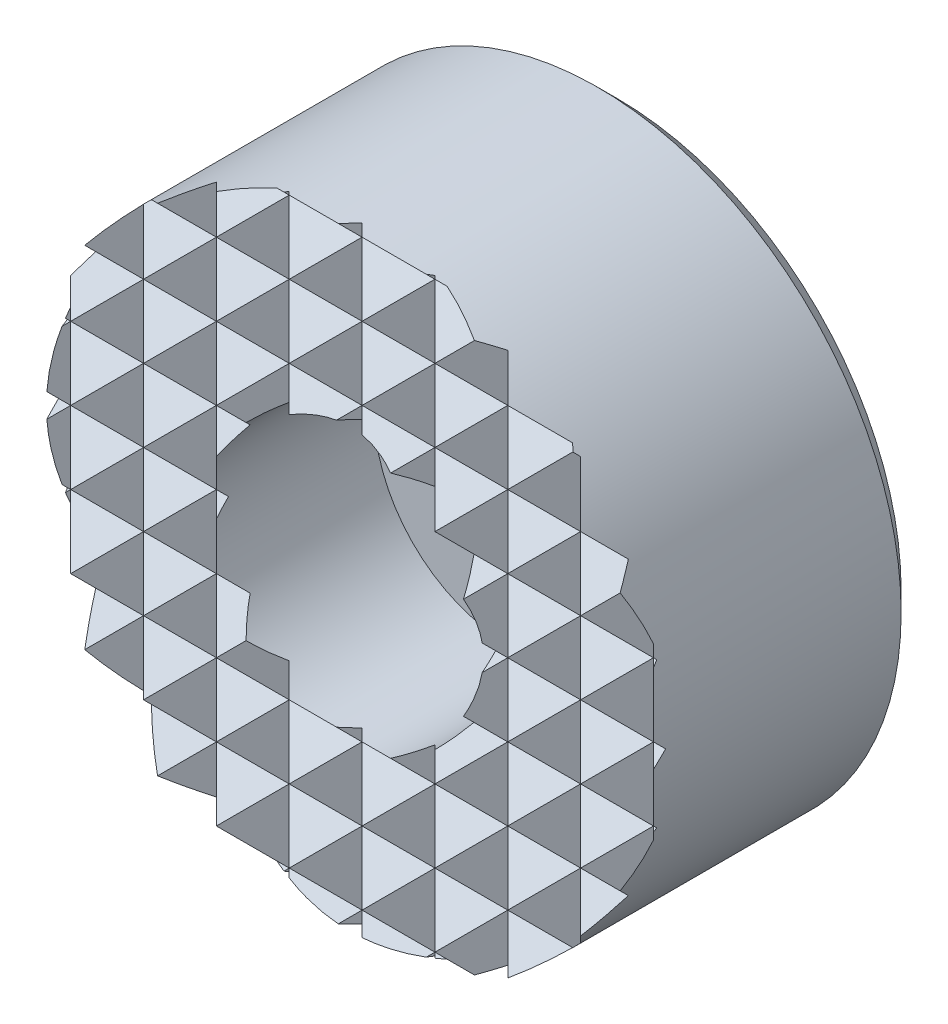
ISO-10303-21;
HEADER;
FILE_DESCRIPTION(('STEP AP214'),'2;1');
FILE_NAME('part.step','',(''),(''),'','','');
FILE_SCHEMA(('AUTOMOTIVE_DESIGN { 1 0 10303 214 1 1 1 1 }'));
ENDSEC;
DATA;
#1=APPLICATION_CONTEXT('core data for automotive mechanical design processes');
#2=APPLICATION_PROTOCOL_DEFINITION('international standard','automotive_design',2000,#1);
#3=PRODUCT_CONTEXT('',#1,'mechanical');
#4=PRODUCT('Part','Part','',(#3));
#5=PRODUCT_RELATED_PRODUCT_CATEGORY('part','',(#4));
#6=PRODUCT_DEFINITION_FORMATION('','',#4);
#7=PRODUCT_DEFINITION_CONTEXT('part definition',#1,'design');
#8=PRODUCT_DEFINITION('design','',#6,#7);
#9=PRODUCT_DEFINITION_SHAPE('','',#8);
#10=(LENGTH_UNIT() NAMED_UNIT(*) SI_UNIT(.MILLI.,.METRE.));
#11=(NAMED_UNIT(*) PLANE_ANGLE_UNIT() SI_UNIT($,.RADIAN.));
#12=(NAMED_UNIT(*) SI_UNIT($,.STERADIAN.) SOLID_ANGLE_UNIT());
#13=UNCERTAINTY_MEASURE_WITH_UNIT(LENGTH_MEASURE(1.E-05),#10,'distance_accuracy_value','');
#14=(GEOMETRIC_REPRESENTATION_CONTEXT(3) GLOBAL_UNCERTAINTY_ASSIGNED_CONTEXT((#13)) GLOBAL_UNIT_ASSIGNED_CONTEXT((#10,
#11,#12)) REPRESENTATION_CONTEXT('',''));
#15=CARTESIAN_POINT('',(0.,0.,0.));
#16=DIRECTION('',(0.,0.,1.));
#17=DIRECTION('',(1.,0.,0.));
#18=AXIS2_PLACEMENT_3D('',#15,#16,#17);
#19=CARTESIAN_POINT('',(-12.,-15.,10.5));
#20=DIRECTION('',(0.707106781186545,0.,-0.70710678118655));
#21=DIRECTION('',(-0.70710678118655,0.,-0.707106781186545));
#22=AXIS2_PLACEMENT_3D('',#19,#20,#21);
#23=PLANE('',#22);
#24=DIRECTION('',(0.577350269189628,0.577350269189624,0.577350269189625));
#25=VECTOR('',#24,1.);
#26=CARTESIAN_POINT('',(-18.,-2.99999999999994,4.5));
#27=LINE('',#26,#25);
#28=CARTESIAN_POINT('',(-12.,3.,10.5));
#29=VERTEX_POINT('',#28);
#30=CARTESIAN_POINT('',(-10.5,4.5,12.));
#31=VERTEX_POINT('',#30);
#32=EDGE_CURVE('E876',#29,#31,#27,.T.);
#33=ORIENTED_EDGE('',*,*,#32,.T.);
#34=DIRECTION('',(-0.577350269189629,0.577350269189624,-0.577350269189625));
#35=VECTOR('',#34,1.);
#36=CARTESIAN_POINT('',(-5.,-0.999999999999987,17.5));
#37=LINE('',#36,#35);
#38=CARTESIAN_POINT('',(-11.3141445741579,5.31414457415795,11.185855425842));
#39=VERTEX_POINT('',#38);
#40=EDGE_CURVE('E828',#31,#39,#37,.T.);
#41=ORIENTED_EDGE('',*,*,#40,.T.);
#42=CARTESIAN_POINT('',(0.,0.,22.5));
#43=DIRECTION('',(0.707106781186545,0.,-0.70710678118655));
#44=DIRECTION('',(-0.70710678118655,0.,-0.707106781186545));
#45=AXIS2_PLACEMENT_3D('',#42,#43,#44);
#46=ELLIPSE('',#45,17.6776695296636,12.5);
#47=CARTESIAN_POINT('',(-12.,3.50000000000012,10.5));
#48=VERTEX_POINT('',#47);
#49=EDGE_CURVE('E1500',#48,#39,#46,.T.);
#50=ORIENTED_EDGE('',*,*,#49,.F.);
#51=DIRECTION('',(0.,1.,0.));
#52=VECTOR('',#51,1.);
#53=CARTESIAN_POINT('',(-12.,-15.,10.5));
#54=LINE('',#53,#52);
#55=EDGE_CURVE('E1764',#29,#48,#54,.T.);
#56=ORIENTED_EDGE('',*,*,#55,.F.);
#57=EDGE_LOOP('',(#33,#41,#50,#56));
#58=FACE_BOUND('',#57,.T.);
#59=ADVANCED_FACE('F15',(#58),#23,.F.);
#60=DIRECTION('',(0.577350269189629,0.577350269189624,0.577350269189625));
#61=VECTOR('',#60,1.);
#62=CARTESIAN_POINT('',(-17.,-5.,5.5));
#63=LINE('',#62,#61);
#64=CARTESIAN_POINT('',(-12.,0.,10.5));
#65=VERTEX_POINT('',#64);
#66=CARTESIAN_POINT('',(-10.5,1.5,12.));
#67=VERTEX_POINT('',#66);
#68=EDGE_CURVE('E958',#65,#67,#63,.T.);
#69=ORIENTED_EDGE('',*,*,#68,.T.);
#70=DIRECTION('',(-0.577350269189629,0.577350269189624,-0.577350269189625));
#71=VECTOR('',#70,1.);
#72=CARTESIAN_POINT('',(-6.,-3.,16.5));
#73=LINE('',#72,#71);
#74=EDGE_CURVE('E920',#67,#29,#73,.T.);
#75=ORIENTED_EDGE('',*,*,#74,.T.);
#76=EDGE_CURVE('E2043',#65,#29,#54,.T.);
#77=ORIENTED_EDGE('',*,*,#76,.F.);
#78=EDGE_LOOP('',(#69,#75,#77));
#79=FACE_BOUND('',#78,.T.);
#80=ADVANCED_FACE('F2084',(#79),#23,.F.);
#81=DIRECTION('',(0.577350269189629,0.577350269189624,0.577350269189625));
#82=VECTOR('',#81,1.);
#83=CARTESIAN_POINT('',(-16.,-7.,6.5));
#84=LINE('',#83,#82);
#85=CARTESIAN_POINT('',(-12.,-3.,10.5));
#86=VERTEX_POINT('',#85);
#87=CARTESIAN_POINT('',(-10.5,-1.5,12.));
#88=VERTEX_POINT('',#87);
#89=EDGE_CURVE('E1034',#86,#88,#84,.T.);
#90=ORIENTED_EDGE('',*,*,#89,.T.);
#91=DIRECTION('',(-0.577350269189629,0.577350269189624,-0.577350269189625));
#92=VECTOR('',#91,1.);
#93=CARTESIAN_POINT('',(-7.,-5.,15.5));
#94=LINE('',#93,#92);
#95=EDGE_CURVE('E996',#88,#65,#94,.T.);
#96=ORIENTED_EDGE('',*,*,#95,.T.);
#97=EDGE_CURVE('E1763',#86,#65,#54,.T.);
#98=ORIENTED_EDGE('',*,*,#97,.F.);
#99=EDGE_LOOP('',(#90,#96,#98));
#100=FACE_BOUND('',#99,.T.);
#101=ADVANCED_FACE('F2091',(#100),#23,.F.);
#102=CARTESIAN_POINT('',(-10.5,-15.,12.));
#103=DIRECTION('',(-0.70710678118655,0.,-0.707106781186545));
#104=DIRECTION('',(-0.707106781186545,0.,0.70710678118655));
#105=AXIS2_PLACEMENT_3D('',#102,#103,#104);
#106=PLANE('',#105);
#107=CARTESIAN_POINT('',(0.,0.,1.5));
#108=DIRECTION('',(-0.70710678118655,0.,-0.707106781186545));
#109=DIRECTION('',(0.707106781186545,0.,-0.70710678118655));
#110=AXIS2_PLACEMENT_3D('',#107,#108,#109);
#111=ELLIPSE('',#110,17.6776695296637,12.5);
#112=CARTESIAN_POINT('',(-10.2106256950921,7.21062569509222,11.7106256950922));
#113=VERTEX_POINT('',#112);
#114=CARTESIAN_POINT('',(-9.,8.67467578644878,10.5));
#115=VERTEX_POINT('',#114);
#116=EDGE_CURVE('E1501',#113,#115,#111,.T.);
#117=ORIENTED_EDGE('',*,*,#116,.F.);
#118=DIRECTION('',(0.577350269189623,-0.577350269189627,-0.577350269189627));
#119=VECTOR('',#118,1.);
#120=CARTESIAN_POINT('',(-2.99999999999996,0.,4.5));
#121=LINE('',#120,#119);
#122=CARTESIAN_POINT('',(-9.,6.,10.5));
#123=VERTEX_POINT('',#122);
#124=EDGE_CURVE('E789',#113,#123,#121,.T.);
#125=ORIENTED_EDGE('',*,*,#124,.T.);
#126=DIRECTION('',(0.,1.,0.));
#127=VECTOR('',#126,1.);
#128=CARTESIAN_POINT('',(-9.,-15.,10.5));
#129=LINE('',#128,#127);
#130=EDGE_CURVE('E1644',#123,#115,#129,.T.);
#131=ORIENTED_EDGE('',*,*,#130,.T.);
#132=EDGE_LOOP('',(#117,#125,#131));
#133=FACE_BOUND('',#132,.T.);
#134=ADVANCED_FACE('F2105',(#133),#106,.F.);
#135=CARTESIAN_POINT('',(-9.,-15.,10.5));
#136=DIRECTION('',(0.707106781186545,0.,-0.70710678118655));
#137=DIRECTION('',(-0.707106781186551,0.,-0.707106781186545));
#138=AXIS2_PLACEMENT_3D('',#135,#136,#137);
#139=PLANE('',#138);
#140=DIRECTION('',(0.577350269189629,0.577350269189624,0.577350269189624));
#141=VECTOR('',#140,1.);
#142=CARTESIAN_POINT('',(-16.,-0.999999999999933,3.50000000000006));
#143=LINE('',#142,#141);
#144=CARTESIAN_POINT('',(-7.5,7.5,12.));
#145=VERTEX_POINT('',#144);
#146=EDGE_CURVE('E792',#123,#145,#143,.T.);
#147=ORIENTED_EDGE('',*,*,#146,.T.);
#148=DIRECTION('',(-0.577350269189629,0.577350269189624,-0.577350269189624));
#149=VECTOR('',#148,1.);
#150=CARTESIAN_POINT('',(-0.999999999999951,1.00000000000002,18.5));
#151=LINE('',#150,#149);
#152=CARTESIAN_POINT('',(-8.83883476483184,8.83883476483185,10.6611652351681));
#153=VERTEX_POINT('',#152);
#154=EDGE_CURVE('E752',#145,#153,#151,.T.);
#155=ORIENTED_EDGE('',*,*,#154,.T.);
#156=CARTESIAN_POINT('',(0.,0.,19.5));
#157=DIRECTION('',(0.707106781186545,0.,-0.70710678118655));
#158=DIRECTION('',(-0.707106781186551,0.,-0.707106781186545));
#159=AXIS2_PLACEMENT_3D('',#156,#157,#158);
#160=ELLIPSE('',#159,17.6776695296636,12.5);
#161=EDGE_CURVE('E1506',#115,#153,#160,.T.);
#162=ORIENTED_EDGE('',*,*,#161,.F.);
#163=ORIENTED_EDGE('',*,*,#130,.F.);
#164=EDGE_LOOP('',(#147,#155,#162,#163));
#165=FACE_BOUND('',#164,.T.);
#166=ADVANCED_FACE('F2114',(#165),#139,.F.);
#167=CARTESIAN_POINT('',(-7.5,-15.,12.));
#168=DIRECTION('',(-0.70710678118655,0.,-0.707106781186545));
#169=DIRECTION('',(-0.707106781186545,0.,0.707106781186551));
#170=AXIS2_PLACEMENT_3D('',#167,#168,#169);
#171=PLANE('',#170);
#172=CARTESIAN_POINT('',(0.,0.,4.5));
#173=DIRECTION('',(-0.70710678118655,0.,-0.707106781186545));
#174=DIRECTION('',(0.707106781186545,0.,-0.707106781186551));
#175=AXIS2_PLACEMENT_3D('',#172,#173,#174);
#176=ELLIPSE('',#175,17.6776695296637,12.5);
#177=CARTESIAN_POINT('',(-7.21062569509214,10.2106256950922,11.7106256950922));
#178=VERTEX_POINT('',#177);
#179=CARTESIAN_POINT('',(-6.,10.9658560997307,10.5));
#180=VERTEX_POINT('',#179);
#181=EDGE_CURVE('E1507',#178,#180,#176,.T.);
#182=ORIENTED_EDGE('',*,*,#181,.F.);
#183=DIRECTION('',(0.577350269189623,-0.577350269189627,-0.577350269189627));
#184=VECTOR('',#183,1.);
#185=CARTESIAN_POINT('',(1.00000000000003,1.99999999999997,3.49999999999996));
#186=LINE('',#185,#184);
#187=CARTESIAN_POINT('',(-6.,9.,10.5));
#188=VERTEX_POINT('',#187);
#189=EDGE_CURVE('E718',#178,#188,#186,.T.);
#190=ORIENTED_EDGE('',*,*,#189,.T.);
#191=DIRECTION('',(0.,1.,0.));
#192=VECTOR('',#191,1.);
#193=CARTESIAN_POINT('',(-6.,-15.,10.5));
#194=LINE('',#193,#192);
#195=EDGE_CURVE('E1647',#188,#180,#194,.T.);
#196=ORIENTED_EDGE('',*,*,#195,.T.);
#197=EDGE_LOOP('',(#182,#190,#196));
#198=FACE_BOUND('',#197,.T.);
#199=ADVANCED_FACE('F1963',(#198),#171,.F.);
#200=CARTESIAN_POINT('',(-6.,0.,10.5));
#201=VERTEX_POINT('',#200);
#202=CARTESIAN_POINT('',(-6.,3.,10.5));
#203=VERTEX_POINT('',#202);
#204=EDGE_CURVE('E1943',#201,#203,#194,.T.);
#205=ORIENTED_EDGE('',*,*,#204,.T.);
#206=DIRECTION('',(-0.577350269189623,-0.577350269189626,0.577350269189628));
#207=VECTOR('',#206,1.);
#208=CARTESIAN_POINT('',(-13.,-4.,17.5));
#209=LINE('',#208,#207);
#210=CARTESIAN_POINT('',(-7.5,1.5,12.));
#211=VERTEX_POINT('',#210);
#212=EDGE_CURVE('E929',#203,#211,#209,.T.);
#213=ORIENTED_EDGE('',*,*,#212,.T.);
#214=DIRECTION('',(0.577350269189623,-0.577350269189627,-0.577350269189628));
#215=VECTOR('',#214,1.);
#216=CARTESIAN_POINT('',(-1.99999999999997,-4.,6.5));
#217=LINE('',#216,#215);
#218=EDGE_CURVE('E965',#211,#201,#217,.T.);
#219=ORIENTED_EDGE('',*,*,#218,.T.);
#220=EDGE_LOOP('',(#205,#213,#219));
#221=FACE_BOUND('',#220,.T.);
#222=ADVANCED_FACE('F2182',(#221),#171,.F.);
#223=CARTESIAN_POINT('',(-6.,-3.,10.5));
#224=VERTEX_POINT('',#223);
#225=EDGE_CURVE('E2183',#224,#201,#194,.T.);
#226=ORIENTED_EDGE('',*,*,#225,.T.);
#227=DIRECTION('',(-0.577350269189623,-0.577350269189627,0.577350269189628));
#228=VECTOR('',#227,1.);
#229=CARTESIAN_POINT('',(-12.,-6.,16.5));
#230=LINE('',#229,#228);
#231=CARTESIAN_POINT('',(-7.5,-1.49999999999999,12.));
#232=VERTEX_POINT('',#231);
#233=EDGE_CURVE('E1005',#201,#232,#230,.T.);
#234=ORIENTED_EDGE('',*,*,#233,.T.);
#235=DIRECTION('',(0.577350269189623,-0.577350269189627,-0.577350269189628));
#236=VECTOR('',#235,1.);
#237=CARTESIAN_POINT('',(-3.,-6.,7.5));
#238=LINE('',#237,#236);
#239=EDGE_CURVE('E1043',#232,#224,#238,.T.);
#240=ORIENTED_EDGE('',*,*,#239,.T.);
#241=EDGE_LOOP('',(#226,#234,#240));
#242=FACE_BOUND('',#241,.T.);
#243=ADVANCED_FACE('F2204',(#242),#171,.F.);
#244=CARTESIAN_POINT('',(6.,-15.,10.5));
#245=DIRECTION('',(0.707106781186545,0.,-0.707106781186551));
#246=DIRECTION('',(-0.707106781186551,0.,-0.707106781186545));
#247=AXIS2_PLACEMENT_3D('',#244,#245,#246);
#248=PLANE('',#247);
#249=DIRECTION('',(0.,1.,0.));
#250=VECTOR('',#249,1.);
#251=CARTESIAN_POINT('',(6.,-15.,10.5));
#252=LINE('',#251,#250);
#253=CARTESIAN_POINT('',(6.,9.,10.5));
#254=VERTEX_POINT('',#253);
#255=CARTESIAN_POINT('',(6.,10.9658560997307,10.5));
#256=VERTEX_POINT('',#255);
#257=EDGE_CURVE('E1410',#254,#256,#252,.T.);
#258=ORIENTED_EDGE('',*,*,#257,.F.);
#259=DIRECTION('',(0.577350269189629,0.577350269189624,0.577350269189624));
#260=VECTOR('',#259,1.);
#261=CARTESIAN_POINT('',(-2.00000000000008,1.00000000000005,2.50000000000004));
#262=LINE('',#261,#260);
#263=CARTESIAN_POINT('',(7.21062569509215,10.2106256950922,11.7106256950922));
#264=VERTEX_POINT('',#263);
#265=EDGE_CURVE('E721',#254,#264,#262,.T.);
#266=ORIENTED_EDGE('',*,*,#265,.T.);
#267=CARTESIAN_POINT('',(0.,0.,4.5000000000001));
#268=DIRECTION('',(0.707106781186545,0.,-0.707106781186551));
#269=DIRECTION('',(-0.707106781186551,0.,-0.707106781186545));
#270=AXIS2_PLACEMENT_3D('',#267,#268,#269);
#271=ELLIPSE('',#270,17.6776695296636,12.5);
#272=EDGE_CURVE('E1512',#256,#264,#271,.T.);
#273=ORIENTED_EDGE('',*,*,#272,.F.);
#274=EDGE_LOOP('',(#258,#266,#273));
#275=FACE_BOUND('',#274,.T.);
#276=ADVANCED_FACE('F2295',(#275),#248,.F.);
#277=DIRECTION('',(0.577350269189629,0.577350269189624,0.577350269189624));
#278=VECTOR('',#277,1.);
#279=CARTESIAN_POINT('',(0.999999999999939,-5.,5.5));
#280=LINE('',#279,#278);
#281=CARTESIAN_POINT('',(6.,0.,10.5));
#282=VERTEX_POINT('',#281);
#283=CARTESIAN_POINT('',(7.5,1.5,12.));
#284=VERTEX_POINT('',#283);
#285=EDGE_CURVE('E988',#282,#284,#280,.T.);
#286=ORIENTED_EDGE('',*,*,#285,.T.);
#287=DIRECTION('',(-0.57735026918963,0.577350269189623,-0.577350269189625));
#288=VECTOR('',#287,1.);
#289=CARTESIAN_POINT('',(12.,-2.99999999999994,16.5));
#290=LINE('',#289,#288);
#291=CARTESIAN_POINT('',(6.,3.,10.5));
#292=VERTEX_POINT('',#291);
#293=EDGE_CURVE('E950',#284,#292,#290,.T.);
#294=ORIENTED_EDGE('',*,*,#293,.T.);
#295=EDGE_CURVE('E1711',#282,#292,#252,.T.);
#296=ORIENTED_EDGE('',*,*,#295,.F.);
#297=EDGE_LOOP('',(#286,#294,#296));
#298=FACE_BOUND('',#297,.T.);
#299=ADVANCED_FACE('F1822',(#298),#248,.F.);
#300=DIRECTION('',(0.577350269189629,0.577350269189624,0.577350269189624));
#301=VECTOR('',#300,1.);
#302=CARTESIAN_POINT('',(1.99999999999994,-7.,6.5));
#303=LINE('',#302,#301);
#304=CARTESIAN_POINT('',(6.,-3.,10.5));
#305=VERTEX_POINT('',#304);
#306=CARTESIAN_POINT('',(7.5,-1.5,12.));
#307=VERTEX_POINT('',#306);
#308=EDGE_CURVE('E1066',#305,#307,#303,.T.);
#309=ORIENTED_EDGE('',*,*,#308,.T.);
#310=DIRECTION('',(-0.57735026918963,0.577350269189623,-0.577350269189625));
#311=VECTOR('',#310,1.);
#312=CARTESIAN_POINT('',(11.,-5.,15.5));
#313=LINE('',#312,#311);
#314=EDGE_CURVE('E1026',#307,#282,#313,.T.);
#315=ORIENTED_EDGE('',*,*,#314,.T.);
#316=EDGE_CURVE('E1708',#305,#282,#252,.T.);
#317=ORIENTED_EDGE('',*,*,#316,.F.);
#318=EDGE_LOOP('',(#309,#315,#317));
#319=FACE_BOUND('',#318,.T.);
#320=ADVANCED_FACE('F1709',(#319),#248,.F.);
#321=CARTESIAN_POINT('',(7.5,-15.,12.));
#322=DIRECTION('',(-0.707106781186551,0.,-0.707106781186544));
#323=DIRECTION('',(-0.707106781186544,0.,0.707106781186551));
#324=AXIS2_PLACEMENT_3D('',#321,#322,#323);
#325=PLANE('',#324);
#326=CARTESIAN_POINT('',(0.,0.,19.5));
#327=DIRECTION('',(-0.707106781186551,0.,-0.707106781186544));
#328=DIRECTION('',(0.707106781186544,0.,-0.707106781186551));
#329=AXIS2_PLACEMENT_3D('',#326,#327,#328);
#330=ELLIPSE('',#329,17.6776695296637,12.5);
#331=CARTESIAN_POINT('',(8.83883476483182,8.83883476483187,10.6611652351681));
#332=VERTEX_POINT('',#331);
#333=CARTESIAN_POINT('',(9.,8.67467578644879,10.5));
#334=VERTEX_POINT('',#333);
#335=EDGE_CURVE('E1513',#332,#334,#330,.T.);
#336=ORIENTED_EDGE('',*,*,#335,.F.);
#337=DIRECTION('',(-0.577350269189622,-0.577350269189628,0.577350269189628));
#338=VECTOR('',#337,1.);
#339=CARTESIAN_POINT('',(0.,0.,19.5));
#340=LINE('',#339,#338);
#341=CARTESIAN_POINT('',(7.5,7.5,12.));
#342=VERTEX_POINT('',#341);
#343=EDGE_CURVE('E746',#332,#342,#340,.T.);
#344=ORIENTED_EDGE('',*,*,#343,.T.);
#345=DIRECTION('',(0.577350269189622,-0.577350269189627,-0.577350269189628));
#346=VECTOR('',#345,1.);
#347=CARTESIAN_POINT('',(15.,0.,4.49999999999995));
#348=LINE('',#347,#346);
#349=CARTESIAN_POINT('',(9.,6.,10.5));
#350=VERTEX_POINT('',#349);
#351=EDGE_CURVE('E783',#342,#350,#348,.T.);
#352=ORIENTED_EDGE('',*,*,#351,.T.);
#353=DIRECTION('',(0.,1.,0.));
#354=VECTOR('',#353,1.);
#355=CARTESIAN_POINT('',(9.,-15.,10.5));
#356=LINE('',#355,#354);
#357=EDGE_CURVE('E1768',#350,#334,#356,.T.);
#358=ORIENTED_EDGE('',*,*,#357,.T.);
#359=EDGE_LOOP('',(#336,#344,#352,#358));
#360=FACE_BOUND('',#359,.T.);
#361=ADVANCED_FACE('F1887',(#360),#325,.F.);
#362=CARTESIAN_POINT('',(9.,-15.,10.5));
#363=DIRECTION('',(0.707106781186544,0.,-0.707106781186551));
#364=DIRECTION('',(-0.707106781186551,0.,-0.707106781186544));
#365=AXIS2_PLACEMENT_3D('',#362,#363,#364);
#366=PLANE('',#365);
#367=ORIENTED_EDGE('',*,*,#357,.F.);
#368=DIRECTION('',(0.57735026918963,0.577350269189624,0.577350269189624));
#369=VECTOR('',#368,1.);
#370=CARTESIAN_POINT('',(1.99999999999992,-0.999999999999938,3.50000000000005));
#371=LINE('',#370,#369);
#372=CARTESIAN_POINT('',(10.2106256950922,7.2106256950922,11.7106256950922));
#373=VERTEX_POINT('',#372);
#374=EDGE_CURVE('E780',#350,#373,#371,.T.);
#375=ORIENTED_EDGE('',*,*,#374,.T.);
#376=CARTESIAN_POINT('',(0.,0.,1.50000000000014));
#377=DIRECTION('',(0.707106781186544,0.,-0.707106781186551));
#378=DIRECTION('',(-0.707106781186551,0.,-0.707106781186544));
#379=AXIS2_PLACEMENT_3D('',#376,#377,#378);
#380=ELLIPSE('',#379,17.6776695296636,12.5);
#381=EDGE_CURVE('E1518',#334,#373,#380,.T.);
#382=ORIENTED_EDGE('',*,*,#381,.F.);
#383=EDGE_LOOP('',(#367,#375,#382));
#384=FACE_BOUND('',#383,.T.);
#385=ADVANCED_FACE('F1885',(#384),#366,.F.);
#386=CARTESIAN_POINT('',(10.5,-15.,12.));
#387=DIRECTION('',(-0.707106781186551,0.,-0.707106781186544));
#388=DIRECTION('',(-0.707106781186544,0.,0.707106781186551));
#389=AXIS2_PLACEMENT_3D('',#386,#387,#388);
#390=PLANE('',#389);
#391=CARTESIAN_POINT('',(0.,0.,22.5));
#392=DIRECTION('',(-0.707106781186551,0.,-0.707106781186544));
#393=DIRECTION('',(0.707106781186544,0.,-0.707106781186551));
#394=AXIS2_PLACEMENT_3D('',#391,#392,#393);
#395=ELLIPSE('',#394,17.6776695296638,12.5);
#396=CARTESIAN_POINT('',(11.3141445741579,5.31414457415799,11.185855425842));
#397=VERTEX_POINT('',#396);
#398=CARTESIAN_POINT('',(12.,3.50000000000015,10.5));
#399=VERTEX_POINT('',#398);
#400=EDGE_CURVE('E1519',#397,#399,#395,.T.);
#401=ORIENTED_EDGE('',*,*,#400,.F.);
#402=DIRECTION('',(-0.577350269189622,-0.577350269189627,0.577350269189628));
#403=VECTOR('',#402,1.);
#404=CARTESIAN_POINT('',(4.,-2.00000000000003,18.5));
#405=LINE('',#404,#403);
#406=CARTESIAN_POINT('',(10.5,4.5,12.));
#407=VERTEX_POINT('',#406);
#408=EDGE_CURVE('E823',#397,#407,#405,.T.);
#409=ORIENTED_EDGE('',*,*,#408,.T.);
#410=DIRECTION('',(0.577350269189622,-0.577350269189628,-0.577350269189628));
#411=VECTOR('',#410,1.);
#412=CARTESIAN_POINT('',(17.,-2.00000000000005,5.5));
#413=LINE('',#412,#411);
#414=CARTESIAN_POINT('',(12.,3.,10.5));
#415=VERTEX_POINT('',#414);
#416=EDGE_CURVE('E898',#407,#415,#413,.T.);
#417=ORIENTED_EDGE('',*,*,#416,.T.);
#418=DIRECTION('',(0.,1.,0.));
#419=VECTOR('',#418,1.);
#420=CARTESIAN_POINT('',(12.,-15.,10.5));
#421=LINE('',#420,#419);
#422=EDGE_CURVE('E1762',#415,#399,#421,.T.);
#423=ORIENTED_EDGE('',*,*,#422,.T.);
#424=EDGE_LOOP('',(#401,#409,#417,#423));
#425=FACE_BOUND('',#424,.T.);
#426=ADVANCED_FACE('F1870',(#425),#390,.F.);
#427=CARTESIAN_POINT('',(12.,0.,10.5));
#428=VERTEX_POINT('',#427);
#429=EDGE_CURVE('E1858',#428,#415,#421,.T.);
#430=ORIENTED_EDGE('',*,*,#429,.T.);
#431=DIRECTION('',(-0.577350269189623,-0.577350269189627,0.577350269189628));
#432=VECTOR('',#431,1.);
#433=CARTESIAN_POINT('',(5.,-4.,17.5));
#434=LINE('',#433,#432);
#435=CARTESIAN_POINT('',(10.5,1.49999999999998,12.));
#436=VERTEX_POINT('',#435);
#437=EDGE_CURVE('E940',#415,#436,#434,.T.);
#438=ORIENTED_EDGE('',*,*,#437,.T.);
#439=DIRECTION('',(0.577350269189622,-0.577350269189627,-0.577350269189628));
#440=VECTOR('',#439,1.);
#441=CARTESIAN_POINT('',(16.,-4.,6.5));
#442=LINE('',#441,#440);
#443=EDGE_CURVE('E977',#436,#428,#442,.T.);
#444=ORIENTED_EDGE('',*,*,#443,.T.);
#445=EDGE_LOOP('',(#430,#438,#444));
#446=FACE_BOUND('',#445,.T.);
#447=ADVANCED_FACE('F1859',(#446),#390,.F.);
#448=CARTESIAN_POINT('',(12.,-3.,10.5));
#449=VERTEX_POINT('',#448);
#450=EDGE_CURVE('E1769',#449,#428,#421,.T.);
#451=ORIENTED_EDGE('',*,*,#450,.T.);
#452=DIRECTION('',(-0.577350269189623,-0.577350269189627,0.577350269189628));
#453=VECTOR('',#452,1.);
#454=CARTESIAN_POINT('',(6.,-6.,16.5));
#455=LINE('',#454,#453);
#456=CARTESIAN_POINT('',(10.5,-1.5,12.));
#457=VERTEX_POINT('',#456);
#458=EDGE_CURVE('E1016',#428,#457,#455,.T.);
#459=ORIENTED_EDGE('',*,*,#458,.T.);
#460=DIRECTION('',(0.577350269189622,-0.577350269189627,-0.577350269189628));
#461=VECTOR('',#460,1.);
#462=CARTESIAN_POINT('',(15.,-6.,7.5));
#463=LINE('',#462,#461);
#464=EDGE_CURVE('E1055',#457,#449,#463,.T.);
#465=ORIENTED_EDGE('',*,*,#464,.T.);
#466=EDGE_LOOP('',(#451,#459,#465));
#467=FACE_BOUND('',#466,.T.);
#468=ADVANCED_FACE('F2227',(#467),#390,.F.);
#469=CARTESIAN_POINT('',(12.,-15.,10.5));
#470=DIRECTION('',(0.707106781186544,0.,-0.707106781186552));
#471=DIRECTION('',(-0.707106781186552,0.,-0.707106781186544));
#472=AXIS2_PLACEMENT_3D('',#469,#470,#471);
#473=PLANE('',#472);
#474=ORIENTED_EDGE('',*,*,#422,.F.);
#475=DIRECTION('',(0.57735026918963,0.577350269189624,0.577350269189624));
#476=VECTOR('',#475,1.);
#477=CARTESIAN_POINT('',(6.,-3.,4.5));
#478=LINE('',#477,#476);
#479=CARTESIAN_POINT('',(12.1075620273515,3.10756202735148,10.6075620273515));
#480=VERTEX_POINT('',#479);
#481=EDGE_CURVE('E895',#415,#480,#478,.T.);
#482=ORIENTED_EDGE('',*,*,#481,.T.);
#483=CARTESIAN_POINT('',(0.,0.,-1.49999999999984));
#484=DIRECTION('',(0.707106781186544,0.,-0.707106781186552));
#485=DIRECTION('',(-0.707106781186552,0.,-0.707106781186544));
#486=AXIS2_PLACEMENT_3D('',#483,#484,#485);
#487=ELLIPSE('',#486,17.6776695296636,12.5);
#488=EDGE_CURVE('E1522',#399,#480,#487,.T.);
#489=ORIENTED_EDGE('',*,*,#488,.F.);
#490=EDGE_LOOP('',(#474,#482,#489));
#491=FACE_BOUND('',#490,.T.);
#492=ADVANCED_FACE('F1873',(#491),#473,.F.);
#493=CARTESIAN_POINT('',(12.1770717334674,2.82292826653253,10.6770717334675));
#494=VERTEX_POINT('',#493);
#495=CARTESIAN_POINT('',(12.4903774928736,0.490377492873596,10.9903774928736));
#496=VERTEX_POINT('',#495);
#497=EDGE_CURVE('E1526',#494,#496,#487,.T.);
#498=ORIENTED_EDGE('',*,*,#497,.F.);
#499=DIRECTION('',(-0.577350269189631,0.577350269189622,-0.577350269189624));
#500=VECTOR('',#499,1.);
#501=CARTESIAN_POINT('',(18.,-2.99999999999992,16.5));
#502=LINE('',#501,#500);
#503=EDGE_CURVE('E937',#494,#415,#502,.T.);
#504=ORIENTED_EDGE('',*,*,#503,.T.);
#505=ORIENTED_EDGE('',*,*,#429,.F.);
#506=DIRECTION('',(0.57735026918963,0.577350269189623,0.577350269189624));
#507=VECTOR('',#506,1.);
#508=CARTESIAN_POINT('',(7.,-5.,5.5));
#509=LINE('',#508,#507);
#510=EDGE_CURVE('E974',#428,#496,#509,.T.);
#511=ORIENTED_EDGE('',*,*,#510,.T.);
#512=EDGE_LOOP('',(#498,#504,#505,#511));
#513=FACE_BOUND('',#512,.T.);
#514=ADVANCED_FACE('F1863',(#513),#473,.F.);
#515=CARTESIAN_POINT('',(12.4903774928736,-0.490377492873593,10.9903774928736));
#516=VERTEX_POINT('',#515);
#517=CARTESIAN_POINT('',(12.1770717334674,-2.82292826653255,10.6770717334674));
#518=VERTEX_POINT('',#517);
#519=EDGE_CURVE('E2233',#516,#518,#487,.T.);
#520=ORIENTED_EDGE('',*,*,#519,.F.);
#521=DIRECTION('',(-0.577350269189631,0.577350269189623,-0.577350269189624));
#522=VECTOR('',#521,1.);
#523=CARTESIAN_POINT('',(17.,-4.99999999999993,15.5));
#524=LINE('',#523,#522);
#525=EDGE_CURVE('E1013',#516,#428,#524,.T.);
#526=ORIENTED_EDGE('',*,*,#525,.T.);
#527=ORIENTED_EDGE('',*,*,#450,.F.);
#528=DIRECTION('',(0.57735026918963,0.577350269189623,0.577350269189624));
#529=VECTOR('',#528,1.);
#530=CARTESIAN_POINT('',(8.,-7.,6.5));
#531=LINE('',#530,#529);
#532=EDGE_CURVE('E1052',#449,#518,#531,.T.);
#533=ORIENTED_EDGE('',*,*,#532,.T.);
#534=EDGE_LOOP('',(#520,#526,#527,#533));
#535=FACE_BOUND('',#534,.T.);
#536=ADVANCED_FACE('F2231',(#535),#473,.F.);
#537=CARTESIAN_POINT('',(-13.5,-15.,12.));
#538=DIRECTION('',(-0.70710678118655,0.,-0.707106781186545));
#539=DIRECTION('',(-0.707106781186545,0.,0.70710678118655));
#540=AXIS2_PLACEMENT_3D('',#537,#538,#539);
#541=PLANE('',#540);
#542=CARTESIAN_POINT('',(0.,0.,-1.5));
#543=DIRECTION('',(-0.70710678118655,0.,-0.707106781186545));
#544=DIRECTION('',(0.707106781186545,0.,-0.70710678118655));
#545=AXIS2_PLACEMENT_3D('',#542,#543,#544);
#546=ELLIPSE('',#545,17.6776695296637,12.5);
#547=CARTESIAN_POINT('',(-12.1075620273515,3.10756202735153,10.6075620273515));
#548=VERTEX_POINT('',#547);
#549=EDGE_CURVE('E1498',#548,#48,#546,.T.);
#550=ORIENTED_EDGE('',*,*,#549,.F.);
#551=DIRECTION('',(0.577350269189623,-0.577350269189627,-0.577350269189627));
#552=VECTOR('',#551,1.);
#553=CARTESIAN_POINT('',(-7.,-2.,5.5));
#554=LINE('',#553,#552);
#555=EDGE_CURVE('E872',#548,#29,#554,.T.);
#556=ORIENTED_EDGE('',*,*,#555,.T.);
#557=ORIENTED_EDGE('',*,*,#55,.T.);
#558=EDGE_LOOP('',(#550,#556,#557));
#559=FACE_BOUND('',#558,.T.);
#560=ADVANCED_FACE('F3738',(#559),#541,.F.);
#561=ORIENTED_EDGE('',*,*,#76,.T.);
#562=DIRECTION('',(-0.577350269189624,-0.577350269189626,0.577350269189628));
#563=VECTOR('',#562,1.);
#564=CARTESIAN_POINT('',(-19.,-4.,17.5));
#565=LINE('',#564,#563);
#566=CARTESIAN_POINT('',(-12.1770717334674,2.82292826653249,10.6770717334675));
#567=VERTEX_POINT('',#566);
#568=EDGE_CURVE('E916',#29,#567,#565,.T.);
#569=ORIENTED_EDGE('',*,*,#568,.T.);
#570=CARTESIAN_POINT('',(-12.4903774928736,0.490377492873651,10.9903774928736));
#571=VERTEX_POINT('',#570);
#572=EDGE_CURVE('E4242',#571,#567,#546,.T.);
#573=ORIENTED_EDGE('',*,*,#572,.F.);
#574=DIRECTION('',(0.577350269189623,-0.577350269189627,-0.577350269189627));
#575=VECTOR('',#574,1.);
#576=CARTESIAN_POINT('',(-8.,-4.,6.5));
#577=LINE('',#576,#575);
#578=EDGE_CURVE('E954',#571,#65,#577,.T.);
#579=ORIENTED_EDGE('',*,*,#578,.T.);
#580=EDGE_LOOP('',(#561,#569,#573,#579));
#581=FACE_BOUND('',#580,.T.);
#582=ADVANCED_FACE('F3912',(#581),#541,.F.);
#583=ORIENTED_EDGE('',*,*,#97,.T.);
#584=DIRECTION('',(-0.577350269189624,-0.577350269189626,0.577350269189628));
#585=VECTOR('',#584,1.);
#586=CARTESIAN_POINT('',(-18.,-6.,16.5));
#587=LINE('',#586,#585);
#588=CARTESIAN_POINT('',(-12.4903774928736,-0.490377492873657,10.9903774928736));
#589=VERTEX_POINT('',#588);
#590=EDGE_CURVE('E992',#65,#589,#587,.T.);
#591=ORIENTED_EDGE('',*,*,#590,.T.);
#592=CARTESIAN_POINT('',(-12.1770717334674,-2.82292826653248,10.6770717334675));
#593=VERTEX_POINT('',#592);
#594=EDGE_CURVE('E1497',#593,#589,#546,.T.);
#595=ORIENTED_EDGE('',*,*,#594,.F.);
#596=DIRECTION('',(0.577350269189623,-0.577350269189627,-0.577350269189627));
#597=VECTOR('',#596,1.);
#598=CARTESIAN_POINT('',(-9.,-6.,7.5));
#599=LINE('',#598,#597);
#600=EDGE_CURVE('E1030',#593,#86,#599,.T.);
#601=ORIENTED_EDGE('',*,*,#600,.T.);
#602=EDGE_LOOP('',(#583,#591,#595,#601));
#603=FACE_BOUND('',#602,.T.);
#604=ADVANCED_FACE('F3739',(#603),#541,.F.);
#605=CARTESIAN_POINT('',(-6.,-15.,10.5));
#606=DIRECTION('',(0.707106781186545,0.,-0.70710678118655));
#607=DIRECTION('',(-0.70710678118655,0.,-0.707106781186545));
#608=AXIS2_PLACEMENT_3D('',#605,#606,#607);
#609=PLANE('',#608);
#610=DIRECTION('',(0.577350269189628,0.577350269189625,0.577350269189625));
#611=VECTOR('',#610,1.);
#612=CARTESIAN_POINT('',(-14.,1.00000000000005,2.50000000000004));
#613=LINE('',#612,#611);
#614=CARTESIAN_POINT('',(-4.49999999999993,10.5,12.));
#615=VERTEX_POINT('',#614);
#616=EDGE_CURVE('E724',#188,#615,#613,.T.);
#617=ORIENTED_EDGE('',*,*,#616,.T.);
#618=DIRECTION('',(-0.577350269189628,0.577350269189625,-0.577350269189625));
#619=VECTOR('',#618,1.);
#620=CARTESIAN_POINT('',(3.00000000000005,3.,19.5));
#621=LINE('',#620,#619);
#622=CARTESIAN_POINT('',(-5.31414457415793,11.3141445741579,11.185855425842));
#623=VERTEX_POINT('',#622);
#624=EDGE_CURVE('E695',#615,#623,#621,.T.);
#625=ORIENTED_EDGE('',*,*,#624,.T.);
#626=CARTESIAN_POINT('',(0.,0.,16.5));
#627=DIRECTION('',(0.707106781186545,0.,-0.70710678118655));
#628=DIRECTION('',(-0.70710678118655,0.,-0.707106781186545));
#629=AXIS2_PLACEMENT_3D('',#626,#627,#628);
#630=ELLIPSE('',#629,17.6776695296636,12.5);
#631=EDGE_CURVE('E1739',#180,#623,#630,.T.);
#632=ORIENTED_EDGE('',*,*,#631,.F.);
#633=ORIENTED_EDGE('',*,*,#195,.F.);
#634=EDGE_LOOP('',(#617,#625,#632,#633));
#635=FACE_BOUND('',#634,.T.);
#636=ADVANCED_FACE('F1966',(#635),#609,.F.);
#637=CARTESIAN_POINT('',(0.,0.,16.5));
#638=DIRECTION('',(0.707106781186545,0.,-0.70710678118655));
#639=DIRECTION('',(0.70710678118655,0.,0.707106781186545));
#640=AXIS2_PLACEMENT_3D('',#637,#638,#639);
#641=ELLIPSE('',#640,7.778174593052,5.5);
#642=CARTESIAN_POINT('',(-5.47487373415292,0.525126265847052,11.025126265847));
#643=VERTEX_POINT('',#642);
#644=CARTESIAN_POINT('',(-5.08817502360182,2.08817502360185,11.4118249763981));
#645=VERTEX_POINT('',#644);
#646=EDGE_CURVE('E1489',#643,#645,#641,.T.);
#647=ORIENTED_EDGE('',*,*,#646,.T.);
#648=DIRECTION('',(-0.577350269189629,0.577350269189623,-0.577350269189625));
#649=VECTOR('',#648,1.);
#650=CARTESIAN_POINT('',(0.,-2.99999999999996,16.5));
#651=LINE('',#650,#649);
#652=EDGE_CURVE('E931',#645,#203,#651,.T.);
#653=ORIENTED_EDGE('',*,*,#652,.T.);
#654=ORIENTED_EDGE('',*,*,#204,.F.);
#655=DIRECTION('',(0.577350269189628,0.577350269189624,0.577350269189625));
#656=VECTOR('',#655,1.);
#657=CARTESIAN_POINT('',(-11.,-5.,5.5));
#658=LINE('',#657,#656);
#659=EDGE_CURVE('E968',#201,#643,#658,.T.);
#660=ORIENTED_EDGE('',*,*,#659,.T.);
#661=EDGE_LOOP('',(#647,#653,#654,#660));
#662=FACE_BOUND('',#661,.T.);
#663=ADVANCED_FACE('F2177',(#662),#609,.F.);
#664=CARTESIAN_POINT('',(-5.08817502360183,-2.08817502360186,11.4118249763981));
#665=VERTEX_POINT('',#664);
#666=CARTESIAN_POINT('',(-5.47487373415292,-0.52512626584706,11.0251262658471));
#667=VERTEX_POINT('',#666);
#668=EDGE_CURVE('E1492',#665,#667,#641,.T.);
#669=ORIENTED_EDGE('',*,*,#668,.T.);
#670=DIRECTION('',(-0.577350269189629,0.577350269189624,-0.577350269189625));
#671=VECTOR('',#670,1.);
#672=CARTESIAN_POINT('',(-0.999999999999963,-5.,15.5));
#673=LINE('',#672,#671);
#674=EDGE_CURVE('E1007',#667,#201,#673,.T.);
#675=ORIENTED_EDGE('',*,*,#674,.T.);
#676=ORIENTED_EDGE('',*,*,#225,.F.);
#677=DIRECTION('',(0.577350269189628,0.577350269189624,0.577350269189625));
#678=VECTOR('',#677,1.);
#679=CARTESIAN_POINT('',(-10.,-7.,6.5));
#680=LINE('',#679,#678);
#681=EDGE_CURVE('E1046',#224,#665,#680,.T.);
#682=ORIENTED_EDGE('',*,*,#681,.T.);
#683=EDGE_LOOP('',(#669,#675,#676,#682));
#684=FACE_BOUND('',#683,.T.);
#685=ADVANCED_FACE('F2208',(#684),#609,.F.);
#686=CARTESIAN_POINT('',(-4.49999999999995,-15.,12.));
#687=DIRECTION('',(-0.70710678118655,0.,-0.707106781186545));
#688=DIRECTION('',(-0.707106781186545,0.,0.70710678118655));
#689=AXIS2_PLACEMENT_3D('',#686,#687,#688);
#690=PLANE('',#689);
#691=CARTESIAN_POINT('',(0.,0.,7.5));
#692=DIRECTION('',(-0.70710678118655,0.,-0.707106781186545));
#693=DIRECTION('',(-0.707106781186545,0.,0.70710678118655));
#694=AXIS2_PLACEMENT_3D('',#691,#692,#693);
#695=ELLIPSE('',#694,7.77817459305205,5.5);
#696=CARTESIAN_POINT('',(-2.99999999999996,-4.60977222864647,10.5));
#697=VERTEX_POINT('',#696);
#698=CARTESIAN_POINT('',(-3.88908729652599,-3.88908729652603,11.389087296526));
#699=VERTEX_POINT('',#698);
#700=EDGE_CURVE('E1485',#697,#699,#695,.T.);
#701=ORIENTED_EDGE('',*,*,#700,.T.);
#702=DIRECTION('',(-0.577350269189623,-0.577350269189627,0.577350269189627));
#703=VECTOR('',#702,1.);
#704=CARTESIAN_POINT('',(-8.,-8.,15.5));
#705=LINE('',#704,#703);
#706=CARTESIAN_POINT('',(-4.49999999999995,-4.5,12.));
#707=VERTEX_POINT('',#706);
#708=EDGE_CURVE('E1088',#699,#707,#705,.T.);
#709=ORIENTED_EDGE('',*,*,#708,.T.);
#710=DIRECTION('',(0.577350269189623,-0.577350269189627,-0.577350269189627));
#711=VECTOR('',#710,1.);
#712=CARTESIAN_POINT('',(-0.999999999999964,-8.,8.5));
#713=LINE('',#712,#711);
#714=CARTESIAN_POINT('',(-2.99999999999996,-6.,10.5));
#715=VERTEX_POINT('',#714);
#716=EDGE_CURVE('E1137',#707,#715,#713,.T.);
#717=ORIENTED_EDGE('',*,*,#716,.T.);
#718=DIRECTION('',(0.,1.,0.));
#719=VECTOR('',#718,1.);
#720=CARTESIAN_POINT('',(-2.99999999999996,-15.,10.5));
#721=LINE('',#720,#719);
#722=EDGE_CURVE('E1976',#715,#697,#721,.T.);
#723=ORIENTED_EDGE('',*,*,#722,.T.);
#724=EDGE_LOOP('',(#701,#709,#717,#723));
#725=FACE_BOUND('',#724,.T.);
#726=ADVANCED_FACE('F2572',(#725),#690,.F.);
#727=DIRECTION('',(-0.577350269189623,-0.577350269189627,0.577350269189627));
#728=VECTOR('',#727,1.);
#729=CARTESIAN_POINT('',(-11.,-2.00000000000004,18.5));
#730=LINE('',#729,#728);
#731=CARTESIAN_POINT('',(-3.,6.,10.5));
#732=VERTEX_POINT('',#731);
#733=CARTESIAN_POINT('',(-4.49999999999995,4.5,12.));
#734=VERTEX_POINT('',#733);
#735=EDGE_CURVE('E845',#732,#734,#730,.T.);
#736=ORIENTED_EDGE('',*,*,#735,.T.);
#737=DIRECTION('',(0.577350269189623,-0.577350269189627,-0.577350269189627));
#738=VECTOR('',#737,1.);
#739=CARTESIAN_POINT('',(2.00000000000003,-2.,5.5));
#740=LINE('',#739,#738);
#741=CARTESIAN_POINT('',(-3.88908729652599,3.88908729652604,11.389087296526));
#742=VERTEX_POINT('',#741);
#743=EDGE_CURVE('E889',#734,#742,#740,.T.);
#744=ORIENTED_EDGE('',*,*,#743,.T.);
#745=CARTESIAN_POINT('',(-2.99999999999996,4.60977222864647,10.5));
#746=VERTEX_POINT('',#745);
#747=EDGE_CURVE('E1488',#742,#746,#695,.T.);
#748=ORIENTED_EDGE('',*,*,#747,.T.);
#749=EDGE_CURVE('E1972',#746,#732,#721,.T.);
#750=ORIENTED_EDGE('',*,*,#749,.T.);
#751=EDGE_LOOP('',(#736,#744,#748,#750));
#752=FACE_BOUND('',#751,.T.);
#753=ADVANCED_FACE('F2545',(#752),#690,.F.);
#754=CARTESIAN_POINT('',(-2.99999999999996,-15.,10.5));
#755=DIRECTION('',(0.707106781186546,0.,-0.707106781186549));
#756=DIRECTION('',(-0.707106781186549,0.,-0.707106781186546));
#757=AXIS2_PLACEMENT_3D('',#754,#755,#756);
#758=PLANE('',#757);
#759=CARTESIAN_POINT('',(0.,0.,13.5));
#760=DIRECTION('',(0.707106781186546,0.,-0.707106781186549));
#761=DIRECTION('',(0.707106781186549,0.,0.707106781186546));
#762=AXIS2_PLACEMENT_3D('',#759,#760,#761);
#763=ELLIPSE('',#762,7.778174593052,5.5);
#764=CARTESIAN_POINT('',(-2.08817502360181,5.08817502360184,11.4118249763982));
#765=VERTEX_POINT('',#764);
#766=EDGE_CURVE('E1481',#746,#765,#763,.T.);
#767=ORIENTED_EDGE('',*,*,#766,.T.);
#768=DIRECTION('',(-0.577350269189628,0.577350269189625,-0.577350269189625));
#769=VECTOR('',#768,1.);
#770=CARTESIAN_POINT('',(4.00000000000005,-0.99999999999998,17.5));
#771=LINE('',#770,#769);
#772=EDGE_CURVE('E847',#765,#732,#771,.T.);
#773=ORIENTED_EDGE('',*,*,#772,.T.);
#774=ORIENTED_EDGE('',*,*,#749,.F.);
#775=EDGE_LOOP('',(#767,#773,#774));
#776=FACE_BOUND('',#775,.T.);
#777=ADVANCED_FACE('F2542',(#776),#758,.F.);
#778=ORIENTED_EDGE('',*,*,#722,.F.);
#779=DIRECTION('',(0.577350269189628,0.577350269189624,0.577350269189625));
#780=VECTOR('',#779,1.);
#781=CARTESIAN_POINT('',(-6.,-9.,7.5));
#782=LINE('',#781,#780);
#783=CARTESIAN_POINT('',(-2.0881750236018,-5.08817502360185,11.4118249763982));
#784=VERTEX_POINT('',#783);
#785=EDGE_CURVE('E1140',#715,#784,#782,.T.);
#786=ORIENTED_EDGE('',*,*,#785,.T.);
#787=EDGE_CURVE('E1484',#784,#697,#763,.T.);
#788=ORIENTED_EDGE('',*,*,#787,.T.);
#789=EDGE_LOOP('',(#778,#786,#788));
#790=FACE_BOUND('',#789,.T.);
#791=ADVANCED_FACE('F2564',(#790),#758,.F.);
#792=CARTESIAN_POINT('',(-1.49999999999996,-15.,12.));
#793=DIRECTION('',(-0.70710678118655,0.,-0.707106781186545));
#794=DIRECTION('',(-0.707106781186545,0.,0.70710678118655));
#795=AXIS2_PLACEMENT_3D('',#792,#793,#794);
#796=PLANE('',#795);
#797=CARTESIAN_POINT('',(0.,0.,10.5));
#798=DIRECTION('',(-0.70710678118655,0.,-0.707106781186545));
#799=DIRECTION('',(-0.707106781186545,0.,0.70710678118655));
#800=AXIS2_PLACEMENT_3D('',#797,#798,#799);
#801=ELLIPSE('',#800,7.77817459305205,5.5);
#802=CARTESIAN_POINT('',(0.,-5.5,10.5));
#803=VERTEX_POINT('',#802);
#804=CARTESIAN_POINT('',(-0.525126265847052,-5.47487373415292,11.0251262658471));
#805=VERTEX_POINT('',#804);
#806=EDGE_CURVE('E1477',#803,#805,#801,.T.);
#807=ORIENTED_EDGE('',*,*,#806,.T.);
#808=DIRECTION('',(0.577350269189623,-0.577350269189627,-0.577350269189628));
#809=VECTOR('',#808,1.);
#810=CARTESIAN_POINT('',(2.00000000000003,-8.,8.5));
#811=LINE('',#810,#809);
#812=CARTESIAN_POINT('',(0.,-6.,10.5));
#813=VERTEX_POINT('',#812);
#814=EDGE_CURVE('E1147',#805,#813,#811,.T.);
#815=ORIENTED_EDGE('',*,*,#814,.T.);
#816=DIRECTION('',(0.,1.,0.));
#817=VECTOR('',#816,1.);
#818=CARTESIAN_POINT('',(0.,-15.,10.5));
#819=LINE('',#818,#817);
#820=EDGE_CURVE('E1980',#813,#803,#819,.T.);
#821=ORIENTED_EDGE('',*,*,#820,.T.);
#822=EDGE_LOOP('',(#807,#815,#821));
#823=FACE_BOUND('',#822,.T.);
#824=ADVANCED_FACE('F2780',(#823),#796,.F.);
#825=CARTESIAN_POINT('',(0.,5.5,10.5));
#826=VERTEX_POINT('',#825);
#827=CARTESIAN_POINT('',(0.,6.,10.5));
#828=VERTEX_POINT('',#827);
#829=EDGE_CURVE('E1423',#826,#828,#819,.T.);
#830=ORIENTED_EDGE('',*,*,#829,.T.);
#831=DIRECTION('',(-0.577350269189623,-0.577350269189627,0.577350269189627));
#832=VECTOR('',#831,1.);
#833=CARTESIAN_POINT('',(-8.,-2.00000000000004,18.5));
#834=LINE('',#833,#832);
#835=CARTESIAN_POINT('',(-0.525126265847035,5.47487373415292,11.0251262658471));
#836=VERTEX_POINT('',#835);
#837=EDGE_CURVE('E854',#828,#836,#834,.T.);
#838=ORIENTED_EDGE('',*,*,#837,.T.);
#839=EDGE_CURVE('E1480',#836,#826,#801,.T.);
#840=ORIENTED_EDGE('',*,*,#839,.T.);
#841=EDGE_LOOP('',(#830,#838,#840));
#842=FACE_BOUND('',#841,.T.);
#843=ADVANCED_FACE('F2076',(#842),#796,.F.);
#844=CARTESIAN_POINT('',(0.,-15.,10.5));
#845=DIRECTION('',(0.707106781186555,0.,-0.70710678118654));
#846=DIRECTION('',(-0.70710678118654,0.,-0.707106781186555));
#847=AXIS2_PLACEMENT_3D('',#844,#845,#846);
#848=PLANE('',#847);
#849=CARTESIAN_POINT('',(0.,0.,10.5));
#850=DIRECTION('',(0.707106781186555,0.,-0.70710678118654));
#851=DIRECTION('',(0.70710678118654,0.,0.707106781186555));
#852=AXIS2_PLACEMENT_3D('',#849,#850,#851);
#853=ELLIPSE('',#852,7.7781745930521,5.5);
#854=CARTESIAN_POINT('',(0.525126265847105,5.47487373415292,11.0251262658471));
#855=VERTEX_POINT('',#854);
#856=EDGE_CURVE('E1471',#826,#855,#853,.T.);
#857=ORIENTED_EDGE('',*,*,#856,.T.);
#858=DIRECTION('',(-0.577350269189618,0.57735026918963,-0.57735026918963));
#859=VECTOR('',#858,1.);
#860=CARTESIAN_POINT('',(7.,-1.00000000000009,17.5));
#861=LINE('',#860,#859);
#862=EDGE_CURVE('E857',#855,#828,#861,.T.);
#863=ORIENTED_EDGE('',*,*,#862,.T.);
#864=ORIENTED_EDGE('',*,*,#829,.F.);
#865=EDGE_LOOP('',(#857,#863,#864));
#866=FACE_BOUND('',#865,.T.);
#867=ADVANCED_FACE('F2079',(#866),#848,.F.);
#868=ORIENTED_EDGE('',*,*,#820,.F.);
#869=DIRECTION('',(0.577350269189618,0.577350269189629,0.57735026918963));
#870=VECTOR('',#869,1.);
#871=CARTESIAN_POINT('',(-2.99999999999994,-9.,7.5));
#872=LINE('',#871,#870);
#873=CARTESIAN_POINT('',(0.525126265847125,-5.47487373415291,11.0251262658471));
#874=VERTEX_POINT('',#873);
#875=EDGE_CURVE('E1150',#813,#874,#872,.T.);
#876=ORIENTED_EDGE('',*,*,#875,.T.);
#877=EDGE_CURVE('E1476',#874,#803,#853,.T.);
#878=ORIENTED_EDGE('',*,*,#877,.T.);
#879=EDGE_LOOP('',(#868,#876,#878));
#880=FACE_BOUND('',#879,.T.);
#881=ADVANCED_FACE('F2065',(#880),#848,.F.);
#882=CARTESIAN_POINT('',(1.5,-15.,12.));
#883=DIRECTION('',(-0.707106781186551,0.,-0.707106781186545));
#884=DIRECTION('',(-0.707106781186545,0.,0.707106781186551));
#885=AXIS2_PLACEMENT_3D('',#882,#883,#884);
#886=PLANE('',#885);
#887=CARTESIAN_POINT('',(0.,0.,13.5));
#888=DIRECTION('',(-0.707106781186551,0.,-0.707106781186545));
#889=DIRECTION('',(-0.707106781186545,0.,0.707106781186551));
#890=AXIS2_PLACEMENT_3D('',#887,#888,#889);
#891=ELLIPSE('',#890,7.77817459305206,5.5);
#892=CARTESIAN_POINT('',(3.,-4.60977222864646,10.5));
#893=VERTEX_POINT('',#892);
#894=CARTESIAN_POINT('',(2.08817502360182,-5.08817502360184,11.4118249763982));
#895=VERTEX_POINT('',#894);
#896=EDGE_CURVE('E1454',#893,#895,#891,.T.);
#897=ORIENTED_EDGE('',*,*,#896,.T.);
#898=DIRECTION('',(0.577350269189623,-0.577350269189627,-0.577350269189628));
#899=VECTOR('',#898,1.);
#900=CARTESIAN_POINT('',(5.,-8.,8.5));
#901=LINE('',#900,#899);
#902=CARTESIAN_POINT('',(3.,-6.,10.5));
#903=VERTEX_POINT('',#902);
#904=EDGE_CURVE('E1158',#895,#903,#901,.T.);
#905=ORIENTED_EDGE('',*,*,#904,.T.);
#906=DIRECTION('',(0.,1.,0.));
#907=VECTOR('',#906,1.);
#908=CARTESIAN_POINT('',(3.,-15.,10.5));
#909=LINE('',#908,#907);
#910=EDGE_CURVE('E1373',#903,#893,#909,.T.);
#911=ORIENTED_EDGE('',*,*,#910,.T.);
#912=EDGE_LOOP('',(#897,#905,#911));
#913=FACE_BOUND('',#912,.T.);
#914=ADVANCED_FACE('F1451',(#913),#886,.F.);
#915=CARTESIAN_POINT('',(3.,4.60977222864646,10.5));
#916=VERTEX_POINT('',#915);
#917=CARTESIAN_POINT('',(2.99999999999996,6.,10.5));
#918=VERTEX_POINT('',#917);
#919=EDGE_CURVE('E1370',#916,#918,#909,.T.);
#920=ORIENTED_EDGE('',*,*,#919,.T.);
#921=DIRECTION('',(-0.577350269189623,-0.577350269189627,0.577350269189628));
#922=VECTOR('',#921,1.);
#923=CARTESIAN_POINT('',(-5.,-2.00000000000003,18.5));
#924=LINE('',#923,#922);
#925=CARTESIAN_POINT('',(2.08817502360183,5.08817502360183,11.4118249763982));
#926=VERTEX_POINT('',#925);
#927=EDGE_CURVE('E865',#918,#926,#924,.T.);
#928=ORIENTED_EDGE('',*,*,#927,.T.);
#929=EDGE_CURVE('E1469',#926,#916,#891,.T.);
#930=ORIENTED_EDGE('',*,*,#929,.T.);
#931=EDGE_LOOP('',(#920,#928,#930));
#932=FACE_BOUND('',#931,.T.);
#933=ADVANCED_FACE('F2534',(#932),#886,.F.);
#934=CARTESIAN_POINT('',(3.,-15.,10.5));
#935=DIRECTION('',(0.707106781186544,0.,-0.707106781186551));
#936=DIRECTION('',(-0.707106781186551,0.,-0.707106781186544));
#937=AXIS2_PLACEMENT_3D('',#934,#935,#936);
#938=PLANE('',#937);
#939=CARTESIAN_POINT('',(0.,0.,7.5));
#940=DIRECTION('',(0.707106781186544,0.,-0.707106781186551));
#941=DIRECTION('',(0.707106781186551,0.,0.707106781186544));
#942=AXIS2_PLACEMENT_3D('',#939,#940,#941);
#943=ELLIPSE('',#942,7.77817459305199,5.5);
#944=CARTESIAN_POINT('',(3.889087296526,3.88908729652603,11.389087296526));
#945=VERTEX_POINT('',#944);
#946=EDGE_CURVE('E1463',#916,#945,#943,.T.);
#947=ORIENTED_EDGE('',*,*,#946,.T.);
#948=DIRECTION('',(0.577350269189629,0.577350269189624,0.577350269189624));
#949=VECTOR('',#948,1.);
#950=CARTESIAN_POINT('',(-3.00000000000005,-2.99999999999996,4.5));
#951=LINE('',#950,#949);
#952=CARTESIAN_POINT('',(4.49999999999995,4.5,12.));
#953=VERTEX_POINT('',#952);
#954=EDGE_CURVE('E912',#945,#953,#951,.T.);
#955=ORIENTED_EDGE('',*,*,#954,.T.);
#956=DIRECTION('',(-0.577350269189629,0.577350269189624,-0.577350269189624));
#957=VECTOR('',#956,1.);
#958=CARTESIAN_POINT('',(10.,-0.999999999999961,17.5));
#959=LINE('',#958,#957);
#960=EDGE_CURVE('E868',#953,#918,#959,.T.);
#961=ORIENTED_EDGE('',*,*,#960,.T.);
#962=ORIENTED_EDGE('',*,*,#919,.F.);
#963=EDGE_LOOP('',(#947,#955,#961,#962));
#964=FACE_BOUND('',#963,.T.);
#965=ADVANCED_FACE('F2530',(#964),#938,.F.);
#966=DIRECTION('',(0.57735026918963,0.577350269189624,0.577350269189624));
#967=VECTOR('',#966,1.);
#968=CARTESIAN_POINT('',(0.,-9.,7.5));
#969=LINE('',#968,#967);
#970=CARTESIAN_POINT('',(4.49999999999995,-4.5,12.));
#971=VERTEX_POINT('',#970);
#972=EDGE_CURVE('E1161',#903,#971,#969,.T.);
#973=ORIENTED_EDGE('',*,*,#972,.T.);
#974=DIRECTION('',(-0.57735026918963,0.577350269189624,-0.577350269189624));
#975=VECTOR('',#974,1.);
#976=CARTESIAN_POINT('',(7.,-7.,14.5));
#977=LINE('',#976,#975);
#978=CARTESIAN_POINT('',(3.88908729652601,-3.88908729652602,11.389087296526));
#979=VERTEX_POINT('',#978);
#980=EDGE_CURVE('E1109',#971,#979,#977,.T.);
#981=ORIENTED_EDGE('',*,*,#980,.T.);
#982=EDGE_CURVE('E1460',#979,#893,#943,.T.);
#983=ORIENTED_EDGE('',*,*,#982,.T.);
#984=ORIENTED_EDGE('',*,*,#910,.F.);
#985=EDGE_LOOP('',(#973,#981,#983,#984));
#986=FACE_BOUND('',#985,.T.);
#987=ADVANCED_FACE('F1458',(#986),#938,.F.);
#988=CARTESIAN_POINT('',(4.5,-15.,12.));
#989=DIRECTION('',(-0.707106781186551,0.,-0.707106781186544));
#990=DIRECTION('',(-0.707106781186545,0.,0.707106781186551));
#991=AXIS2_PLACEMENT_3D('',#988,#989,#990);
#992=PLANE('',#991);
#993=CARTESIAN_POINT('',(0.,0.,16.5));
#994=DIRECTION('',(-0.707106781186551,0.,-0.707106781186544));
#995=DIRECTION('',(0.707106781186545,0.,-0.707106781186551));
#996=AXIS2_PLACEMENT_3D('',#993,#994,#995);
#997=ELLIPSE('',#996,17.6776695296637,12.5);
#998=CARTESIAN_POINT('',(5.31414457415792,11.314144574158,11.185855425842));
#999=VERTEX_POINT('',#998);
#1000=EDGE_CURVE('E1756',#999,#256,#997,.T.);
#1001=ORIENTED_EDGE('',*,*,#1000,.F.);
#1002=DIRECTION('',(-0.577350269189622,-0.577350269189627,0.577350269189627));
#1003=VECTOR('',#1002,1.);
#1004=CARTESIAN_POINT('',(-4.,1.99999999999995,20.5));
#1005=LINE('',#1004,#1003);
#1006=CARTESIAN_POINT('',(4.5,10.5,12.));
#1007=VERTEX_POINT('',#1006);
#1008=EDGE_CURVE('E1568',#999,#1007,#1005,.T.);
#1009=ORIENTED_EDGE('',*,*,#1008,.T.);
#1010=DIRECTION('',(0.577350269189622,-0.577350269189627,-0.577350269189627));
#1011=VECTOR('',#1010,1.);
#1012=CARTESIAN_POINT('',(13.,1.99999999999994,3.49999999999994));
#1013=LINE('',#1012,#1011);
#1014=EDGE_CURVE('E1565',#1007,#254,#1013,.T.);
#1015=ORIENTED_EDGE('',*,*,#1014,.T.);
#1016=ORIENTED_EDGE('',*,*,#257,.T.);
#1017=EDGE_LOOP('',(#1001,#1009,#1015,#1016));
#1018=FACE_BOUND('',#1017,.T.);
#1019=ADVANCED_FACE('F2523',(#1018),#992,.F.);
#1020=ORIENTED_EDGE('',*,*,#295,.T.);
#1021=DIRECTION('',(-0.577350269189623,-0.577350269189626,0.577350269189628));
#1022=VECTOR('',#1021,1.);
#1023=CARTESIAN_POINT('',(-1.00000000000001,-4.,17.5));
#1024=LINE('',#1023,#1022);
#1025=CARTESIAN_POINT('',(5.08817502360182,2.08817502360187,11.4118249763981));
#1026=VERTEX_POINT('',#1025);
#1027=EDGE_CURVE('E1551',#292,#1026,#1024,.T.);
#1028=ORIENTED_EDGE('',*,*,#1027,.T.);
#1029=CARTESIAN_POINT('',(0.,0.,16.5));
#1030=DIRECTION('',(-0.707106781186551,0.,-0.707106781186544));
#1031=DIRECTION('',(-0.707106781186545,0.,0.707106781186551));
#1032=AXIS2_PLACEMENT_3D('',#1029,#1030,#1031);
#1033=ELLIPSE('',#1032,7.77817459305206,5.5);
#1034=CARTESIAN_POINT('',(5.47487373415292,0.525126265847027,11.025126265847));
#1035=VERTEX_POINT('',#1034);
#1036=EDGE_CURVE('E1721',#1026,#1035,#1033,.T.);
#1037=ORIENTED_EDGE('',*,*,#1036,.T.);
#1038=DIRECTION('',(0.577350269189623,-0.577350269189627,-0.577350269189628));
#1039=VECTOR('',#1038,1.);
#1040=CARTESIAN_POINT('',(10.,-4.,6.5));
#1041=LINE('',#1040,#1039);
#1042=EDGE_CURVE('E1548',#1035,#282,#1041,.T.);
#1043=ORIENTED_EDGE('',*,*,#1042,.T.);
#1044=EDGE_LOOP('',(#1020,#1028,#1037,#1043));
#1045=FACE_BOUND('',#1044,.T.);
#1046=ADVANCED_FACE('F1825',(#1045),#992,.F.);
#1047=ORIENTED_EDGE('',*,*,#316,.T.);
#1048=DIRECTION('',(-0.577350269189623,-0.577350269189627,0.577350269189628));
#1049=VECTOR('',#1048,1.);
#1050=CARTESIAN_POINT('',(0.,-6.,16.5));
#1051=LINE('',#1050,#1049);
#1052=CARTESIAN_POINT('',(5.47487373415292,-0.525126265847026,11.025126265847));
#1053=VERTEX_POINT('',#1052);
#1054=EDGE_CURVE('E1545',#282,#1053,#1051,.T.);
#1055=ORIENTED_EDGE('',*,*,#1054,.T.);
#1056=CARTESIAN_POINT('',(5.08817502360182,-2.08817502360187,11.4118249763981));
#1057=VERTEX_POINT('',#1056);
#1058=EDGE_CURVE('E1715',#1053,#1057,#1033,.T.);
#1059=ORIENTED_EDGE('',*,*,#1058,.T.);
#1060=DIRECTION('',(0.577350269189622,-0.577350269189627,-0.577350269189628));
#1061=VECTOR('',#1060,1.);
#1062=CARTESIAN_POINT('',(9.,-6.,7.5));
#1063=LINE('',#1062,#1061);
#1064=EDGE_CURVE('E1542',#1057,#305,#1063,.T.);
#1065=ORIENTED_EDGE('',*,*,#1064,.T.);
#1066=EDGE_LOOP('',(#1047,#1055,#1059,#1065));
#1067=FACE_BOUND('',#1066,.T.);
#1068=ADVANCED_FACE('F1713',(#1067),#992,.F.);
#1069=CARTESIAN_POINT('',(0.,0.,12.));
#1070=DIRECTION('',(0.,0.,-1.));
#1071=DIRECTION('',(-1.,0.,0.));
#1072=AXIS2_PLACEMENT_3D('',#1069,#1070,#1071);
#1073=CYLINDRICAL_SURFACE('',#1072,12.5);
#1074=CARTESIAN_POINT('',(0.,0.,0.8));
#1075=DIRECTION('',(0.,0.,1.));
#1076=DIRECTION('',(1.,0.,0.));
#1077=AXIS2_PLACEMENT_3D('',#1074,#1075,#1076);
#1078=CIRCLE('',#1077,12.5);
#1079=CARTESIAN_POINT('',(12.5,0.,0.8));
#1080=VERTEX_POINT('',#1079);
#1081=EDGE_CURVE('E1725',#1080,#1080,#1078,.T.);
#1082=ORIENTED_EDGE('',*,*,#1081,.T.);
#1083=EDGE_LOOP('',(#1082));
#1084=FACE_BOUND('',#1083,.T.);
#1085=ORIENTED_EDGE('',*,*,#272,.T.);
#1086=CARTESIAN_POINT('',(0.,0.,1.5));
#1087=DIRECTION('',(0.,0.707106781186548,-0.707106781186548));
#1088=DIRECTION('',(0.,-0.707106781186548,-0.707106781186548));
#1089=AXIS2_PLACEMENT_3D('',#1086,#1087,#1088);
#1090=ELLIPSE('',#1089,17.6776695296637,12.5);
#1091=CARTESIAN_POINT('',(8.67467578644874,9.,10.5));
#1092=VERTEX_POINT('',#1091);
#1093=EDGE_CURVE('E715',#264,#1092,#1090,.T.);
#1094=ORIENTED_EDGE('',*,*,#1093,.T.);
#1095=CARTESIAN_POINT('',(0.,0.,19.5));
#1096=DIRECTION('',(0.,-0.707106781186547,-0.707106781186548));
#1097=DIRECTION('',(0.,0.707106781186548,-0.707106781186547));
#1098=AXIS2_PLACEMENT_3D('',#1095,#1096,#1097);
#1099=ELLIPSE('',#1098,17.6776695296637,12.5);
#1100=EDGE_CURVE('E745',#1092,#332,#1099,.T.);
#1101=ORIENTED_EDGE('',*,*,#1100,.T.);
#1102=ORIENTED_EDGE('',*,*,#335,.T.);
#1103=ORIENTED_EDGE('',*,*,#381,.T.);
#1104=CARTESIAN_POINT('',(0.,0.,4.5));
#1105=DIRECTION('',(0.,0.707106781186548,-0.707106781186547));
#1106=DIRECTION('',(0.,-0.707106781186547,-0.707106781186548));
#1107=AXIS2_PLACEMENT_3D('',#1104,#1105,#1106);
#1108=ELLIPSE('',#1107,17.6776695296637,12.5);
#1109=CARTESIAN_POINT('',(10.9658560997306,6.,10.5));
#1110=VERTEX_POINT('',#1109);
#1111=EDGE_CURVE('E779',#373,#1110,#1108,.T.);
#1112=ORIENTED_EDGE('',*,*,#1111,.T.);
#1113=CARTESIAN_POINT('',(0.,0.,16.5));
#1114=DIRECTION('',(0.,-0.707106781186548,-0.707106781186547));
#1115=DIRECTION('',(0.,0.707106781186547,-0.707106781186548));
#1116=AXIS2_PLACEMENT_3D('',#1113,#1114,#1115);
#1117=ELLIPSE('',#1116,17.6776695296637,12.5);
#1118=EDGE_CURVE('E822',#1110,#397,#1117,.T.);
#1119=ORIENTED_EDGE('',*,*,#1118,.T.);
#1120=ORIENTED_EDGE('',*,*,#400,.T.);
#1121=ORIENTED_EDGE('',*,*,#488,.T.);
#1122=CARTESIAN_POINT('',(0.,0.,7.5));
#1123=DIRECTION('',(0.,0.707106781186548,-0.707106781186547));
#1124=DIRECTION('',(0.,-0.707106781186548,-0.707106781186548));
#1125=AXIS2_PLACEMENT_3D('',#1122,#1123,#1124);
#1126=ELLIPSE('',#1125,17.6776695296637,12.5);
#1127=CARTESIAN_POINT('',(12.1346610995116,3.,10.5));
#1128=VERTEX_POINT('',#1127);
#1129=EDGE_CURVE('E892',#480,#1128,#1126,.T.);
#1130=ORIENTED_EDGE('',*,*,#1129,.T.);
#1131=CARTESIAN_POINT('',(0.,0.,13.5));
#1132=DIRECTION('',(0.,-0.707106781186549,-0.707106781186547));
#1133=DIRECTION('',(0.,0.707106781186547,-0.707106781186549));
#1134=AXIS2_PLACEMENT_3D('',#1131,#1132,#1133);
#1135=ELLIPSE('',#1134,17.6776695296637,12.5);
#1136=EDGE_CURVE('E934',#1128,#494,#1135,.T.);
#1137=ORIENTED_EDGE('',*,*,#1136,.T.);
#1138=ORIENTED_EDGE('',*,*,#497,.T.);
#1139=CARTESIAN_POINT('',(0.,0.,10.5));
#1140=DIRECTION('',(0.,0.707106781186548,-0.707106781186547));
#1141=DIRECTION('',(0.,-0.707106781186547,-0.707106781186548));
#1142=AXIS2_PLACEMENT_3D('',#1139,#1140,#1141);
#1143=ELLIPSE('',#1142,17.6776695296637,12.5);
#1144=CARTESIAN_POINT('',(12.5,0.,10.5));
#1145=VERTEX_POINT('',#1144);
#1146=EDGE_CURVE('E971',#496,#1145,#1143,.T.);
#1147=ORIENTED_EDGE('',*,*,#1146,.T.);
#1148=CARTESIAN_POINT('',(0.,0.,10.5));
#1149=DIRECTION('',(0.,-0.707106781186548,-0.707106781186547));
#1150=DIRECTION('',(0.,0.707106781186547,-0.707106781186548));
#1151=AXIS2_PLACEMENT_3D('',#1148,#1149,#1150);
#1152=ELLIPSE('',#1151,17.6776695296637,12.5);
#1153=EDGE_CURVE('E1010',#1145,#516,#1152,.T.);
#1154=ORIENTED_EDGE('',*,*,#1153,.T.);
#1155=ORIENTED_EDGE('',*,*,#519,.T.);
#1156=CARTESIAN_POINT('',(0.,0.,13.5));
#1157=DIRECTION('',(0.,0.707106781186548,-0.707106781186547));
#1158=DIRECTION('',(0.,-0.707106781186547,-0.707106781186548));
#1159=AXIS2_PLACEMENT_3D('',#1156,#1157,#1158);
#1160=ELLIPSE('',#1159,17.6776695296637,12.5);
#1161=CARTESIAN_POINT('',(12.1346610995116,-3.,10.5));
#1162=VERTEX_POINT('',#1161);
#1163=EDGE_CURVE('E1049',#518,#1162,#1160,.T.);
#1164=ORIENTED_EDGE('',*,*,#1163,.T.);
#1165=CARTESIAN_POINT('',(0.,0.,7.5));
#1166=DIRECTION('',(0.,-0.707106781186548,-0.707106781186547));
#1167=DIRECTION('',(0.,0.707106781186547,-0.707106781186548));
#1168=AXIS2_PLACEMENT_3D('',#1165,#1166,#1167);
#1169=ELLIPSE('',#1168,17.6776695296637,12.5);
#1170=CARTESIAN_POINT('',(12.1075620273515,-3.10756202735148,10.6075620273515));
#1171=VERTEX_POINT('',#1170);
#1172=EDGE_CURVE('E1090',#1162,#1171,#1169,.T.);
#1173=ORIENTED_EDGE('',*,*,#1172,.T.);
#1174=CARTESIAN_POINT('',(12.,-3.50000000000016,10.5));
#1175=VERTEX_POINT('',#1174);
#1176=EDGE_CURVE('E1527',#1171,#1175,#487,.T.);
#1177=ORIENTED_EDGE('',*,*,#1176,.T.);
#1178=CARTESIAN_POINT('',(11.3141445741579,-5.314144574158,11.185855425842));
#1179=VERTEX_POINT('',#1178);
#1180=EDGE_CURVE('E1521',#1175,#1179,#395,.T.);
#1181=ORIENTED_EDGE('',*,*,#1180,.T.);
#1182=CARTESIAN_POINT('',(0.,0.,16.5));
#1183=DIRECTION('',(0.,0.707106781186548,-0.707106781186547));
#1184=DIRECTION('',(0.,-0.707106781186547,-0.707106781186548));
#1185=AXIS2_PLACEMENT_3D('',#1182,#1183,#1184);
#1186=ELLIPSE('',#1185,17.6776695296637,12.5);
#1187=CARTESIAN_POINT('',(10.9658560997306,-6.,10.5));
#1188=VERTEX_POINT('',#1187);
#1189=EDGE_CURVE('E1112',#1179,#1188,#1186,.T.);
#1190=ORIENTED_EDGE('',*,*,#1189,.T.);
#1191=CARTESIAN_POINT('',(0.,0.,4.5));
#1192=DIRECTION('',(0.,-0.707106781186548,-0.707106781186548));
#1193=DIRECTION('',(0.,0.707106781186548,-0.707106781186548));
#1194=AXIS2_PLACEMENT_3D('',#1191,#1192,#1193);
#1195=ELLIPSE('',#1194,17.6776695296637,12.5);
#1196=CARTESIAN_POINT('',(10.2106256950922,-7.21062569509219,11.7106256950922));
#1197=VERTEX_POINT('',#1196);
#1198=EDGE_CURVE('E1164',#1188,#1197,#1195,.T.);
#1199=ORIENTED_EDGE('',*,*,#1198,.T.);
#1200=CARTESIAN_POINT('',(9.,-8.67467578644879,10.5));
#1201=VERTEX_POINT('',#1200);
#1202=EDGE_CURVE('E1516',#1197,#1201,#380,.T.);
#1203=ORIENTED_EDGE('',*,*,#1202,.T.);
#1204=CARTESIAN_POINT('',(8.83883476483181,-8.83883476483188,10.6611652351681));
#1205=VERTEX_POINT('',#1204);
#1206=EDGE_CURVE('E1515',#1201,#1205,#330,.T.);
#1207=ORIENTED_EDGE('',*,*,#1206,.T.);
#1208=CARTESIAN_POINT('',(0.,0.,19.5));
#1209=DIRECTION('',(0.,0.707106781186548,-0.707106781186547));
#1210=DIRECTION('',(0.,-0.707106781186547,-0.707106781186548));
#1211=AXIS2_PLACEMENT_3D('',#1208,#1209,#1210);
#1212=ELLIPSE('',#1211,17.6776695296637,12.5);
#1213=CARTESIAN_POINT('',(8.67467578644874,-9.,10.5));
#1214=VERTEX_POINT('',#1213);
#1215=EDGE_CURVE('E1204',#1205,#1214,#1212,.T.);
#1216=ORIENTED_EDGE('',*,*,#1215,.T.);
#1217=CARTESIAN_POINT('',(0.,0.,1.50000000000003));
#1218=DIRECTION('',(0.,-0.707106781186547,-0.707106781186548));
#1219=DIRECTION('',(0.,0.707106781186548,-0.707106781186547));
#1220=AXIS2_PLACEMENT_3D('',#1217,#1218,#1219);
#1221=ELLIPSE('',#1220,17.6776695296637,12.5);
#1222=CARTESIAN_POINT('',(7.21062569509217,-10.2106256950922,11.7106256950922));
#1223=VERTEX_POINT('',#1222);
#1224=EDGE_CURVE('E1241',#1214,#1223,#1221,.T.);
#1225=ORIENTED_EDGE('',*,*,#1224,.T.);
#1226=CARTESIAN_POINT('',(6.,-10.9658560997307,10.5));
#1227=VERTEX_POINT('',#1226);
#1228=EDGE_CURVE('E1510',#1223,#1227,#271,.T.);
#1229=ORIENTED_EDGE('',*,*,#1228,.T.);
#1230=CARTESIAN_POINT('',(5.31414457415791,-11.314144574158,11.185855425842));
#1231=VERTEX_POINT('',#1230);
#1232=EDGE_CURVE('E1579',#1227,#1231,#997,.T.);
#1233=ORIENTED_EDGE('',*,*,#1232,.T.);
#1234=CARTESIAN_POINT('',(0.,0.,22.5));
#1235=DIRECTION('',(0.,0.707106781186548,-0.707106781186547));
#1236=DIRECTION('',(0.,-0.707106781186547,-0.707106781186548));
#1237=AXIS2_PLACEMENT_3D('',#1234,#1235,#1236);
#1238=ELLIPSE('',#1237,17.6776695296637,12.5);
#1239=CARTESIAN_POINT('',(3.5,-12.,10.5));
#1240=VERTEX_POINT('',#1239);
#1241=EDGE_CURVE('E647',#1231,#1240,#1238,.T.);
#1242=ORIENTED_EDGE('',*,*,#1241,.T.);
#1243=CARTESIAN_POINT('',(0.,0.,-1.5));
#1244=DIRECTION('',(0.,-0.707106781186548,-0.707106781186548));
#1245=DIRECTION('',(0.,0.707106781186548,-0.707106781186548));
#1246=AXIS2_PLACEMENT_3D('',#1243,#1244,#1245);
#1247=ELLIPSE('',#1246,17.6776695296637,12.5);
#1248=CARTESIAN_POINT('',(3.10756202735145,-12.1075620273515,10.6075620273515));
#1249=VERTEX_POINT('',#1248);
#1250=EDGE_CURVE('E677',#1240,#1249,#1247,.T.);
#1251=ORIENTED_EDGE('',*,*,#1250,.T.);
#1252=CARTESIAN_POINT('',(0.,0.,7.5));
#1253=DIRECTION('',(0.707106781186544,0.,-0.707106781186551));
#1254=DIRECTION('',(-0.707106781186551,0.,-0.707106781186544));
#1255=AXIS2_PLACEMENT_3D('',#1252,#1253,#1254);
#1256=ELLIPSE('',#1255,17.6776695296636,12.5);
#1257=CARTESIAN_POINT('',(3.,-12.1346610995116,10.5));
#1258=VERTEX_POINT('',#1257);
#1259=EDGE_CURVE('E1573',#1249,#1258,#1256,.T.);
#1260=ORIENTED_EDGE('',*,*,#1259,.T.);
#1261=CARTESIAN_POINT('',(0.,0.,13.5));
#1262=DIRECTION('',(-0.707106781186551,0.,-0.707106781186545));
#1263=DIRECTION('',(0.707106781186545,0.,-0.707106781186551));
#1264=AXIS2_PLACEMENT_3D('',#1261,#1262,#1263);
#1265=ELLIPSE('',#1264,17.6776695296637,12.5);
#1266=CARTESIAN_POINT('',(2.82292826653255,-12.1770717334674,10.6770717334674));
#1267=VERTEX_POINT('',#1266);
#1268=EDGE_CURVE('E1753',#1258,#1267,#1265,.T.);
#1269=ORIENTED_EDGE('',*,*,#1268,.T.);
#1270=CARTESIAN_POINT('',(0.490377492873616,-12.4903774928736,10.9903774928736));
#1271=VERTEX_POINT('',#1270);
#1272=EDGE_CURVE('E667',#1267,#1271,#1247,.T.);
#1273=ORIENTED_EDGE('',*,*,#1272,.T.);
#1274=CARTESIAN_POINT('',(0.,0.,10.5));
#1275=DIRECTION('',(0.707106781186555,0.,-0.70710678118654));
#1276=DIRECTION('',(-0.70710678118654,0.,-0.707106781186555));
#1277=AXIS2_PLACEMENT_3D('',#1274,#1275,#1276);
#1278=ELLIPSE('',#1277,17.6776695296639,12.5);
#1279=CARTESIAN_POINT('',(0.,-12.5,10.5));
#1280=VERTEX_POINT('',#1279);
#1281=EDGE_CURVE('E1751',#1271,#1280,#1278,.T.);
#1282=ORIENTED_EDGE('',*,*,#1281,.T.);
#1283=CARTESIAN_POINT('',(0.,0.,10.5));
#1284=DIRECTION('',(-0.70710678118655,0.,-0.707106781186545));
#1285=DIRECTION('',(0.707106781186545,0.,-0.70710678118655));
#1286=AXIS2_PLACEMENT_3D('',#1283,#1284,#1285);
#1287=ELLIPSE('',#1286,17.6776695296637,12.5);
#1288=CARTESIAN_POINT('',(-0.490377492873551,-12.4903774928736,10.9903774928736));
#1289=VERTEX_POINT('',#1288);
#1290=EDGE_CURVE('E1747',#1280,#1289,#1287,.T.);
#1291=ORIENTED_EDGE('',*,*,#1290,.T.);
#1292=CARTESIAN_POINT('',(-2.82292826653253,-12.1770717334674,10.6770717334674));
#1293=VERTEX_POINT('',#1292);
#1294=EDGE_CURVE('E666',#1289,#1293,#1247,.T.);
#1295=ORIENTED_EDGE('',*,*,#1294,.T.);
#1296=CARTESIAN_POINT('',(0.,0.,13.5));
#1297=DIRECTION('',(0.707106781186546,0.,-0.707106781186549));
#1298=DIRECTION('',(-0.707106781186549,0.,-0.707106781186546));
#1299=AXIS2_PLACEMENT_3D('',#1296,#1297,#1298);
#1300=ELLIPSE('',#1299,17.6776695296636,12.5);
#1301=CARTESIAN_POINT('',(-2.99999999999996,-12.1346610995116,10.5));
#1302=VERTEX_POINT('',#1301);
#1303=EDGE_CURVE('E1745',#1293,#1302,#1300,.T.);
#1304=ORIENTED_EDGE('',*,*,#1303,.T.);
#1305=CARTESIAN_POINT('',(0.,0.,7.5));
#1306=DIRECTION('',(-0.70710678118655,0.,-0.707106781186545));
#1307=DIRECTION('',(0.707106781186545,0.,-0.70710678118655));
#1308=AXIS2_PLACEMENT_3D('',#1305,#1306,#1307);
#1309=ELLIPSE('',#1308,17.6776695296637,12.5);
#1310=CARTESIAN_POINT('',(-3.10756202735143,-12.1075620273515,10.6075620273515));
#1311=VERTEX_POINT('',#1310);
#1312=EDGE_CURVE('E663',#1302,#1311,#1309,.T.);
#1313=ORIENTED_EDGE('',*,*,#1312,.T.);
#1314=CARTESIAN_POINT('',(-3.5,-12.,10.5));
#1315=VERTEX_POINT('',#1314);
#1316=EDGE_CURVE('E652',#1311,#1315,#1247,.T.);
#1317=ORIENTED_EDGE('',*,*,#1316,.T.);
#1318=CARTESIAN_POINT('',(-5.31414457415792,-11.314144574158,11.185855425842));
#1319=VERTEX_POINT('',#1318);
#1320=EDGE_CURVE('E636',#1315,#1319,#1238,.T.);
#1321=ORIENTED_EDGE('',*,*,#1320,.T.);
#1322=CARTESIAN_POINT('',(-6.,-10.9658560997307,10.5));
#1323=VERTEX_POINT('',#1322);
#1324=EDGE_CURVE('E1740',#1319,#1323,#630,.T.);
#1325=ORIENTED_EDGE('',*,*,#1324,.T.);
#1326=CARTESIAN_POINT('',(-7.21062569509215,-10.2106256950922,11.7106256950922));
#1327=VERTEX_POINT('',#1326);
#1328=EDGE_CURVE('E1509',#1323,#1327,#176,.T.);
#1329=ORIENTED_EDGE('',*,*,#1328,.T.);
#1330=CARTESIAN_POINT('',(-8.67467578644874,-9.,10.5));
#1331=VERTEX_POINT('',#1330);
#1332=EDGE_CURVE('E1242',#1327,#1331,#1221,.T.);
#1333=ORIENTED_EDGE('',*,*,#1332,.T.);
#1334=CARTESIAN_POINT('',(-8.83883476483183,-8.83883476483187,10.6611652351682));
#1335=VERTEX_POINT('',#1334);
#1336=EDGE_CURVE('E1208',#1331,#1335,#1212,.T.);
#1337=ORIENTED_EDGE('',*,*,#1336,.T.);
#1338=CARTESIAN_POINT('',(-9.,-8.67467578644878,10.5));
#1339=VERTEX_POINT('',#1338);
#1340=EDGE_CURVE('E1504',#1335,#1339,#160,.T.);
#1341=ORIENTED_EDGE('',*,*,#1340,.T.);
#1342=CARTESIAN_POINT('',(-10.2106256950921,-7.2106256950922,11.7106256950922));
#1343=VERTEX_POINT('',#1342);
#1344=EDGE_CURVE('E1503',#1339,#1343,#111,.T.);
#1345=ORIENTED_EDGE('',*,*,#1344,.T.);
#1346=CARTESIAN_POINT('',(-10.9658560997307,-6.,10.5));
#1347=VERTEX_POINT('',#1346);
#1348=EDGE_CURVE('E1171',#1343,#1347,#1195,.T.);
#1349=ORIENTED_EDGE('',*,*,#1348,.T.);
#1350=CARTESIAN_POINT('',(-11.3141445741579,-5.31414457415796,11.1858554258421));
#1351=VERTEX_POINT('',#1350);
#1352=EDGE_CURVE('E1116',#1347,#1351,#1186,.T.);
#1353=ORIENTED_EDGE('',*,*,#1352,.T.);
#1354=CARTESIAN_POINT('',(-12.,-3.50000000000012,10.5));
#1355=VERTEX_POINT('',#1354);
#1356=EDGE_CURVE('E1496',#1351,#1355,#46,.T.);
#1357=ORIENTED_EDGE('',*,*,#1356,.T.);
#1358=CARTESIAN_POINT('',(-12.1075620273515,-3.10756202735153,10.6075620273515));
#1359=VERTEX_POINT('',#1358);
#1360=EDGE_CURVE('E1493',#1355,#1359,#546,.T.);
#1361=ORIENTED_EDGE('',*,*,#1360,.T.);
#1362=CARTESIAN_POINT('',(-12.1346610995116,-3.,10.5));
#1363=VERTEX_POINT('',#1362);
#1364=EDGE_CURVE('E1069',#1359,#1363,#1169,.T.);
#1365=ORIENTED_EDGE('',*,*,#1364,.T.);
#1366=EDGE_CURVE('E1029',#1363,#593,#1160,.T.);
#1367=ORIENTED_EDGE('',*,*,#1366,.T.);
#1368=ORIENTED_EDGE('',*,*,#594,.T.);
#1369=CARTESIAN_POINT('',(-12.5,0.,10.5));
#1370=VERTEX_POINT('',#1369);
#1371=EDGE_CURVE('E991',#589,#1370,#1152,.T.);
#1372=ORIENTED_EDGE('',*,*,#1371,.T.);
#1373=EDGE_CURVE('E953',#1370,#571,#1143,.T.);
#1374=ORIENTED_EDGE('',*,*,#1373,.T.);
#1375=ORIENTED_EDGE('',*,*,#572,.T.);
#1376=CARTESIAN_POINT('',(-12.1346610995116,3.,10.5));
#1377=VERTEX_POINT('',#1376);
#1378=EDGE_CURVE('E915',#567,#1377,#1135,.T.);
#1379=ORIENTED_EDGE('',*,*,#1378,.T.);
#1380=EDGE_CURVE('E871',#1377,#548,#1126,.T.);
#1381=ORIENTED_EDGE('',*,*,#1380,.T.);
#1382=ORIENTED_EDGE('',*,*,#549,.T.);
#1383=ORIENTED_EDGE('',*,*,#49,.T.);
#1384=CARTESIAN_POINT('',(-10.9658560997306,6.,10.5));
#1385=VERTEX_POINT('',#1384);
#1386=EDGE_CURVE('E825',#39,#1385,#1117,.T.);
#1387=ORIENTED_EDGE('',*,*,#1386,.T.);
#1388=EDGE_CURVE('E786',#1385,#113,#1108,.T.);
#1389=ORIENTED_EDGE('',*,*,#1388,.T.);
#1390=ORIENTED_EDGE('',*,*,#116,.T.);
#1391=ORIENTED_EDGE('',*,*,#161,.T.);
#1392=CARTESIAN_POINT('',(-8.67467578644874,9.,10.5));
#1393=VERTEX_POINT('',#1392);
#1394=EDGE_CURVE('E749',#153,#1393,#1099,.T.);
#1395=ORIENTED_EDGE('',*,*,#1394,.T.);
#1396=EDGE_CURVE('E714',#1393,#178,#1090,.T.);
#1397=ORIENTED_EDGE('',*,*,#1396,.T.);
#1398=ORIENTED_EDGE('',*,*,#181,.T.);
#1399=ORIENTED_EDGE('',*,*,#631,.T.);
#1400=CARTESIAN_POINT('',(0.,0.,22.5));
#1401=DIRECTION('',(0.,-0.707106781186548,-0.707106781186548));
#1402=DIRECTION('',(0.,0.707106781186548,-0.707106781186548));
#1403=AXIS2_PLACEMENT_3D('',#1400,#1401,#1402);
#1404=ELLIPSE('',#1403,17.6776695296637,12.5);
#1405=CARTESIAN_POINT('',(-3.5,12.,10.5));
#1406=VERTEX_POINT('',#1405);
#1407=EDGE_CURVE('E691',#623,#1406,#1404,.T.);
#1408=ORIENTED_EDGE('',*,*,#1407,.T.);
#1409=CARTESIAN_POINT('',(0.,0.,-1.5));
#1410=DIRECTION('',(0.,0.707106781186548,-0.707106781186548));
#1411=DIRECTION('',(0.,-0.707106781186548,-0.707106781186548));
#1412=AXIS2_PLACEMENT_3D('',#1409,#1410,#1411);
#1413=ELLIPSE('',#1412,17.6776695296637,12.5);
#1414=CARTESIAN_POINT('',(-3.10756202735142,12.1075620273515,10.6075620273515));
#1415=VERTEX_POINT('',#1414);
#1416=EDGE_CURVE('E2027',#1406,#1415,#1413,.T.);
#1417=ORIENTED_EDGE('',*,*,#1416,.T.);
#1418=CARTESIAN_POINT('',(-2.99999999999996,12.1346610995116,10.5));
#1419=VERTEX_POINT('',#1418);
#1420=EDGE_CURVE('E1742',#1415,#1419,#1309,.T.);
#1421=ORIENTED_EDGE('',*,*,#1420,.T.);
#1422=CARTESIAN_POINT('',(-2.82292826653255,12.1770717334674,10.6770717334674));
#1423=VERTEX_POINT('',#1422);
#1424=EDGE_CURVE('E1744',#1419,#1423,#1300,.T.);
#1425=ORIENTED_EDGE('',*,*,#1424,.T.);
#1426=CARTESIAN_POINT('',(-0.490377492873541,12.4903774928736,10.9903774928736));
#1427=VERTEX_POINT('',#1426);
#1428=EDGE_CURVE('E2033',#1423,#1427,#1413,.T.);
#1429=ORIENTED_EDGE('',*,*,#1428,.T.);
#1430=CARTESIAN_POINT('',(0.,12.5,10.5));
#1431=VERTEX_POINT('',#1430);
#1432=EDGE_CURVE('E1748',#1427,#1431,#1287,.T.);
#1433=ORIENTED_EDGE('',*,*,#1432,.T.);
#1434=CARTESIAN_POINT('',(0.490377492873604,12.4903774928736,10.9903774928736));
#1435=VERTEX_POINT('',#1434);
#1436=EDGE_CURVE('E1750',#1431,#1435,#1278,.T.);
#1437=ORIENTED_EDGE('',*,*,#1436,.T.);
#1438=CARTESIAN_POINT('',(2.82292826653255,12.1770717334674,10.6770717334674));
#1439=VERTEX_POINT('',#1438);
#1440=EDGE_CURVE('E2026',#1435,#1439,#1413,.T.);
#1441=ORIENTED_EDGE('',*,*,#1440,.T.);
#1442=CARTESIAN_POINT('',(3.,12.1346610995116,10.5));
#1443=VERTEX_POINT('',#1442);
#1444=EDGE_CURVE('E1402',#1439,#1443,#1265,.T.);
#1445=ORIENTED_EDGE('',*,*,#1444,.T.);
#1446=CARTESIAN_POINT('',(3.10756202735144,12.1075620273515,10.6075620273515));
#1447=VERTEX_POINT('',#1446);
#1448=EDGE_CURVE('E1406',#1443,#1447,#1256,.T.);
#1449=ORIENTED_EDGE('',*,*,#1448,.T.);
#1450=CARTESIAN_POINT('',(3.5,12.,10.5));
#1451=VERTEX_POINT('',#1450);
#1452=EDGE_CURVE('E669',#1447,#1451,#1413,.T.);
#1453=ORIENTED_EDGE('',*,*,#1452,.T.);
#1454=EDGE_CURVE('E685',#1451,#999,#1404,.T.);
#1455=ORIENTED_EDGE('',*,*,#1454,.T.);
#1456=ORIENTED_EDGE('',*,*,#1000,.T.);
#1457=EDGE_LOOP('',(#1085,#1094,#1101,#1102,#1103,#1112,#1119,#1120,#1121,#1130,#1137,#1138,
#1147,#1154,#1155,#1164,#1173,#1177,#1181,#1190,#1199,#1203,#1207,#1216,#1225,#1229,#1233,#1242,
#1251,#1260,#1269,#1273,#1282,#1291,#1295,#1304,#1313,#1317,#1321,#1325,#1329,#1333,#1337,#1341,
#1345,#1349,#1353,#1357,#1361,#1365,#1367,#1368,#1372,#1374,#1375,#1379,#1381,#1382,#1383,#1387,
#1389,#1390,#1391,#1395,#1397,#1398,#1399,#1408,#1417,#1421,#1425,#1429,#1433,#1437,#1441,#1445,
#1449,#1453,#1455,#1456));
#1458=FACE_BOUND('',#1457,.T.);
#1459=ADVANCED_FACE('F661',(#1084,#1458),#1073,.T.);
#1460=CARTESIAN_POINT('',(0.,0.,0.));
#1461=DIRECTION('',(0.,0.,1.));
#1462=DIRECTION('',(1.,0.,0.));
#1463=AXIS2_PLACEMENT_3D('',#1460,#1461,#1462);
#1464=PLANE('',#1463);
#1465=CARTESIAN_POINT('',(0.,0.,0.));
#1466=DIRECTION('',(0.,0.,1.));
#1467=DIRECTION('',(1.,0.,0.));
#1468=AXIS2_PLACEMENT_3D('',#1465,#1466,#1467);
#1469=CIRCLE('',#1468,11.7);
#1470=CARTESIAN_POINT('',(11.7,0.,0.));
#1471=VERTEX_POINT('',#1470);
#1472=EDGE_CURVE('E1722',#1471,#1471,#1469,.F.);
#1473=ORIENTED_EDGE('',*,*,#1472,.T.);
#1474=EDGE_LOOP('',(#1473));
#1475=FACE_BOUND('',#1474,.T.);
#1476=CARTESIAN_POINT('',(0.,0.,0.));
#1477=DIRECTION('',(0.,0.,1.));
#1478=DIRECTION('',(1.,0.,0.));
#1479=AXIS2_PLACEMENT_3D('',#1476,#1477,#1478);
#1480=CIRCLE('',#1479,3.3);
#1481=CARTESIAN_POINT('',(3.3,0.,0.));
#1482=VERTEX_POINT('',#1481);
#1483=EDGE_CURVE('E1736',#1482,#1482,#1480,.T.);
#1484=ORIENTED_EDGE('',*,*,#1483,.T.);
#1485=EDGE_LOOP('',(#1484));
#1486=FACE_BOUND('',#1485,.T.);
#1487=ADVANCED_FACE('F3792',(#1475,#1486),#1464,.F.);
#1488=CARTESIAN_POINT('',(0.,0.,12.));
#1489=DIRECTION('',(0.,0.,1.));
#1490=DIRECTION('',(1.,0.,0.));
#1491=AXIS2_PLACEMENT_3D('',#1488,#1489,#1490);
#1492=CYLINDRICAL_SURFACE('',#1491,5.5);
#1493=CARTESIAN_POINT('',(0.,0.,16.5));
#1494=DIRECTION('',(0.,-0.707106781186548,-0.707106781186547));
#1495=DIRECTION('',(0.,-0.707106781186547,0.707106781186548));
#1496=AXIS2_PLACEMENT_3D('',#1493,#1494,#1495);
#1497=ELLIPSE('',#1496,7.77817459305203,5.5);
#1498=EDGE_CURVE('E850',#765,#836,#1497,.T.);
#1499=ORIENTED_EDGE('',*,*,#1498,.F.);
#1500=ORIENTED_EDGE('',*,*,#766,.F.);
#1501=ORIENTED_EDGE('',*,*,#747,.F.);
#1502=CARTESIAN_POINT('',(0.,0.,7.5));
#1503=DIRECTION('',(0.,0.707106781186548,-0.707106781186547));
#1504=DIRECTION('',(0.,0.707106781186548,0.707106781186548));
#1505=AXIS2_PLACEMENT_3D('',#1502,#1503,#1504);
#1506=ELLIPSE('',#1505,7.77817459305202,5.5);
#1507=CARTESIAN_POINT('',(-4.60977222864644,3.,10.5));
#1508=VERTEX_POINT('',#1507);
#1509=EDGE_CURVE('E875',#1508,#742,#1506,.T.);
#1510=ORIENTED_EDGE('',*,*,#1509,.F.);
#1511=CARTESIAN_POINT('',(0.,0.,13.5));
#1512=DIRECTION('',(0.,-0.707106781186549,-0.707106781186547));
#1513=DIRECTION('',(0.,-0.707106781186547,0.707106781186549));
#1514=AXIS2_PLACEMENT_3D('',#1511,#1512,#1513);
#1515=ELLIPSE('',#1514,7.77817459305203,5.5);
#1516=EDGE_CURVE('E919',#645,#1508,#1515,.T.);
#1517=ORIENTED_EDGE('',*,*,#1516,.F.);
#1518=ORIENTED_EDGE('',*,*,#646,.F.);
#1519=CARTESIAN_POINT('',(0.,0.,10.5));
#1520=DIRECTION('',(0.,0.707106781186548,-0.707106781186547));
#1521=DIRECTION('',(0.,0.707106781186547,0.707106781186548));
#1522=AXIS2_PLACEMENT_3D('',#1519,#1520,#1521);
#1523=ELLIPSE('',#1522,7.77817459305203,5.5);
#1524=CARTESIAN_POINT('',(-5.5,0.,10.5));
#1525=VERTEX_POINT('',#1524);
#1526=EDGE_CURVE('E957',#1525,#643,#1523,.T.);
#1527=ORIENTED_EDGE('',*,*,#1526,.F.);
#1528=CARTESIAN_POINT('',(0.,0.,10.5));
#1529=DIRECTION('',(0.,-0.707106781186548,-0.707106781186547));
#1530=DIRECTION('',(0.,-0.707106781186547,0.707106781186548));
#1531=AXIS2_PLACEMENT_3D('',#1528,#1529,#1530);
#1532=ELLIPSE('',#1531,7.77817459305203,5.5);
#1533=EDGE_CURVE('E995',#667,#1525,#1532,.T.);
#1534=ORIENTED_EDGE('',*,*,#1533,.F.);
#1535=ORIENTED_EDGE('',*,*,#668,.F.);
#1536=CARTESIAN_POINT('',(0.,0.,13.5));
#1537=DIRECTION('',(0.,0.707106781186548,-0.707106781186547));
#1538=DIRECTION('',(0.,0.707106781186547,0.707106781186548));
#1539=AXIS2_PLACEMENT_3D('',#1536,#1537,#1538);
#1540=ELLIPSE('',#1539,7.77817459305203,5.5);
#1541=CARTESIAN_POINT('',(-4.60977222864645,-3.,10.5));
#1542=VERTEX_POINT('',#1541);
#1543=EDGE_CURVE('E1033',#1542,#665,#1540,.T.);
#1544=ORIENTED_EDGE('',*,*,#1543,.F.);
#1545=CARTESIAN_POINT('',(0.,0.,7.5));
#1546=DIRECTION('',(0.,-0.707106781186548,-0.707106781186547));
#1547=DIRECTION('',(0.,-0.707106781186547,0.707106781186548));
#1548=AXIS2_PLACEMENT_3D('',#1545,#1546,#1547);
#1549=ELLIPSE('',#1548,7.77817459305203,5.5);
#1550=EDGE_CURVE('E1073',#699,#1542,#1549,.T.);
#1551=ORIENTED_EDGE('',*,*,#1550,.F.);
#1552=ORIENTED_EDGE('',*,*,#700,.F.);
#1553=ORIENTED_EDGE('',*,*,#787,.F.);
#1554=CARTESIAN_POINT('',(0.,0.,16.5));
#1555=DIRECTION('',(0.,0.707106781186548,-0.707106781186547));
#1556=DIRECTION('',(0.,0.707106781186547,0.707106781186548));
#1557=AXIS2_PLACEMENT_3D('',#1554,#1555,#1556);
#1558=ELLIPSE('',#1557,7.77817459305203,5.5);
#1559=EDGE_CURVE('E1143',#805,#784,#1558,.T.);
#1560=ORIENTED_EDGE('',*,*,#1559,.F.);
#1561=ORIENTED_EDGE('',*,*,#806,.F.);
#1562=ORIENTED_EDGE('',*,*,#877,.F.);
#1563=EDGE_CURVE('E1153',#895,#874,#1558,.T.);
#1564=ORIENTED_EDGE('',*,*,#1563,.F.);
#1565=ORIENTED_EDGE('',*,*,#896,.F.);
#1566=ORIENTED_EDGE('',*,*,#982,.F.);
#1567=CARTESIAN_POINT('',(4.60977222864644,-3.,10.5));
#1568=VERTEX_POINT('',#1567);
#1569=EDGE_CURVE('E1104',#1568,#979,#1549,.T.);
#1570=ORIENTED_EDGE('',*,*,#1569,.F.);
#1571=EDGE_CURVE('E1064',#1057,#1568,#1540,.T.);
#1572=ORIENTED_EDGE('',*,*,#1571,.F.);
#1573=ORIENTED_EDGE('',*,*,#1058,.F.);
#1574=CARTESIAN_POINT('',(5.5,0.,10.5));
#1575=VERTEX_POINT('',#1574);
#1576=EDGE_CURVE('E1024',#1575,#1053,#1532,.T.);
#1577=ORIENTED_EDGE('',*,*,#1576,.F.);
#1578=EDGE_CURVE('E986',#1035,#1575,#1523,.T.);
#1579=ORIENTED_EDGE('',*,*,#1578,.F.);
#1580=ORIENTED_EDGE('',*,*,#1036,.F.);
#1581=CARTESIAN_POINT('',(4.60977222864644,3.,10.5));
#1582=VERTEX_POINT('',#1581);
#1583=EDGE_CURVE('E948',#1582,#1026,#1515,.T.);
#1584=ORIENTED_EDGE('',*,*,#1583,.F.);
#1585=EDGE_CURVE('E907',#945,#1582,#1506,.T.);
#1586=ORIENTED_EDGE('',*,*,#1585,.F.);
#1587=ORIENTED_EDGE('',*,*,#946,.F.);
#1588=ORIENTED_EDGE('',*,*,#929,.F.);
#1589=EDGE_CURVE('E860',#855,#926,#1497,.T.);
#1590=ORIENTED_EDGE('',*,*,#1589,.F.);
#1591=ORIENTED_EDGE('',*,*,#856,.F.);
#1592=ORIENTED_EDGE('',*,*,#839,.F.);
#1593=EDGE_LOOP('',(#1499,#1500,#1501,#1510,#1517,#1518,#1527,#1534,#1535,#1544,#1551,#1552,
#1553,#1560,#1561,#1562,#1564,#1565,#1566,#1570,#1572,#1573,#1577,#1579,#1580,#1584,#1586,#1587,
#1588,#1590,#1591,#1592));
#1594=FACE_BOUND('',#1593,.T.);
#1595=CARTESIAN_POINT('',(0.,0.,4.5));
#1596=DIRECTION('',(0.,0.,1.));
#1597=DIRECTION('',(1.,0.,0.));
#1598=AXIS2_PLACEMENT_3D('',#1595,#1596,#1597);
#1599=CIRCLE('',#1598,5.5);
#1600=CARTESIAN_POINT('',(5.5,0.,4.5));
#1601=VERTEX_POINT('',#1600);
#1602=EDGE_CURVE('E1730',#1601,#1601,#1599,.T.);
#1603=ORIENTED_EDGE('',*,*,#1602,.F.);
#1604=EDGE_LOOP('',(#1603));
#1605=FACE_BOUND('',#1604,.T.);
#1606=ADVANCED_FACE('F1466',(#1594,#1605),#1492,.F.);
#1607=CARTESIAN_POINT('',(3.3,0.,4.5));
#1608=DIRECTION('',(0.,0.,1.));
#1609=DIRECTION('',(1.,0.,0.));
#1610=AXIS2_PLACEMENT_3D('',#1607,#1608,#1609);
#1611=PLANE('',#1610);
#1612=ORIENTED_EDGE('',*,*,#1602,.T.);
#1613=EDGE_LOOP('',(#1612));
#1614=FACE_BOUND('',#1613,.T.);
#1615=CARTESIAN_POINT('',(0.,0.,4.5));
#1616=DIRECTION('',(0.,0.,1.));
#1617=DIRECTION('',(1.,0.,0.));
#1618=AXIS2_PLACEMENT_3D('',#1615,#1616,#1617);
#1619=CIRCLE('',#1618,3.3);
#1620=CARTESIAN_POINT('',(3.3,0.,4.5));
#1621=VERTEX_POINT('',#1620);
#1622=EDGE_CURVE('E1733',#1621,#1621,#1619,.T.);
#1623=ORIENTED_EDGE('',*,*,#1622,.F.);
#1624=EDGE_LOOP('',(#1623));
#1625=FACE_BOUND('',#1624,.T.);
#1626=ADVANCED_FACE('F3775',(#1614,#1625),#1611,.T.);
#1627=CARTESIAN_POINT('',(0.,0.,12.));
#1628=DIRECTION('',(0.,0.,1.));
#1629=DIRECTION('',(1.,0.,0.));
#1630=AXIS2_PLACEMENT_3D('',#1627,#1628,#1629);
#1631=CYLINDRICAL_SURFACE('',#1630,3.3);
#1632=ORIENTED_EDGE('',*,*,#1622,.T.);
#1633=EDGE_LOOP('',(#1632));
#1634=FACE_BOUND('',#1633,.T.);
#1635=ORIENTED_EDGE('',*,*,#1483,.F.);
#1636=EDGE_LOOP('',(#1635));
#1637=FACE_BOUND('',#1636,.T.);
#1638=ADVANCED_FACE('F2107',(#1634,#1637),#1631,.F.);
#1639=CARTESIAN_POINT('',(0.,0.,0.8));
#1640=DIRECTION('',(0.,0.,1.));
#1641=DIRECTION('',(1.,0.,0.));
#1642=AXIS2_PLACEMENT_3D('',#1639,#1640,#1641);
#1643=CONICAL_SURFACE('',#1642,12.5,0.78539816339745);
#1644=ORIENTED_EDGE('',*,*,#1472,.F.);
#1645=EDGE_LOOP('',(#1644));
#1646=FACE_BOUND('',#1645,.T.);
#1647=ORIENTED_EDGE('',*,*,#1081,.F.);
#1648=EDGE_LOOP('',(#1647));
#1649=FACE_BOUND('',#1648,.T.);
#1650=ADVANCED_FACE('F17',(#1646,#1649),#1643,.T.);
#1651=DIRECTION('',(0.577350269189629,0.577350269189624,0.577350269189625));
#1652=VECTOR('',#1651,1.);
#1653=CARTESIAN_POINT('',(-15.,-9.,7.5));
#1654=LINE('',#1653,#1652);
#1655=CARTESIAN_POINT('',(-10.5,-4.5,12.));
#1656=VERTEX_POINT('',#1655);
#1657=EDGE_CURVE('E1119',#1351,#1656,#1654,.T.);
#1658=ORIENTED_EDGE('',*,*,#1657,.T.);
#1659=DIRECTION('',(-0.577350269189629,0.577350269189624,-0.577350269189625));
#1660=VECTOR('',#1659,1.);
#1661=CARTESIAN_POINT('',(-8.,-7.,14.5));
#1662=LINE('',#1661,#1660);
#1663=EDGE_CURVE('E1074',#1656,#86,#1662,.T.);
#1664=ORIENTED_EDGE('',*,*,#1663,.T.);
#1665=EDGE_CURVE('E1759',#1355,#86,#54,.T.);
#1666=ORIENTED_EDGE('',*,*,#1665,.F.);
#1667=ORIENTED_EDGE('',*,*,#1356,.F.);
#1668=EDGE_LOOP('',(#1658,#1664,#1666,#1667));
#1669=FACE_BOUND('',#1668,.T.);
#1670=ADVANCED_FACE('F2087',(#1669),#23,.F.);
#1671=CARTESIAN_POINT('',(-9.,-6.,10.5));
#1672=VERTEX_POINT('',#1671);
#1673=EDGE_CURVE('E1758',#1339,#1672,#129,.T.);
#1674=ORIENTED_EDGE('',*,*,#1673,.T.);
#1675=DIRECTION('',(-0.577350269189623,-0.577350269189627,0.577350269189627));
#1676=VECTOR('',#1675,1.);
#1677=CARTESIAN_POINT('',(-13.,-10.,14.5));
#1678=LINE('',#1677,#1676);
#1679=EDGE_CURVE('E1174',#1672,#1343,#1678,.T.);
#1680=ORIENTED_EDGE('',*,*,#1679,.T.);
#1681=ORIENTED_EDGE('',*,*,#1344,.F.);
#1682=EDGE_LOOP('',(#1674,#1680,#1681));
#1683=FACE_BOUND('',#1682,.T.);
#1684=ADVANCED_FACE('F2096',(#1683),#106,.F.);
#1685=DIRECTION('',(0.577350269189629,0.577350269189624,0.577350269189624));
#1686=VECTOR('',#1685,1.);
#1687=CARTESIAN_POINT('',(-11.,-11.,8.5));
#1688=LINE('',#1687,#1686);
#1689=CARTESIAN_POINT('',(-7.5,-7.5,12.));
#1690=VERTEX_POINT('',#1689);
#1691=EDGE_CURVE('E1211',#1335,#1690,#1688,.T.);
#1692=ORIENTED_EDGE('',*,*,#1691,.T.);
#1693=DIRECTION('',(-0.577350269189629,0.577350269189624,-0.577350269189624));
#1694=VECTOR('',#1693,1.);
#1695=CARTESIAN_POINT('',(-6.,-9.,13.5));
#1696=LINE('',#1695,#1694);
#1697=EDGE_CURVE('E1177',#1690,#1672,#1696,.T.);
#1698=ORIENTED_EDGE('',*,*,#1697,.T.);
#1699=ORIENTED_EDGE('',*,*,#1673,.F.);
#1700=ORIENTED_EDGE('',*,*,#1340,.F.);
#1701=EDGE_LOOP('',(#1692,#1698,#1699,#1700));
#1702=FACE_BOUND('',#1701,.T.);
#1703=ADVANCED_FACE('F2102',(#1702),#139,.F.);
#1704=CARTESIAN_POINT('',(-6.,-9.,10.5));
#1705=VERTEX_POINT('',#1704);
#1706=EDGE_CURVE('E1636',#1323,#1705,#194,.T.);
#1707=ORIENTED_EDGE('',*,*,#1706,.T.);
#1708=DIRECTION('',(-0.577350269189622,-0.577350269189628,0.577350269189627));
#1709=VECTOR('',#1708,1.);
#1710=CARTESIAN_POINT('',(-9.,-12.,13.5));
#1711=LINE('',#1710,#1709);
#1712=EDGE_CURVE('E1245',#1705,#1327,#1711,.T.);
#1713=ORIENTED_EDGE('',*,*,#1712,.T.);
#1714=ORIENTED_EDGE('',*,*,#1328,.F.);
#1715=EDGE_LOOP('',(#1707,#1713,#1714));
#1716=FACE_BOUND('',#1715,.T.);
#1717=ADVANCED_FACE('F1642',(#1716),#171,.F.);
#1718=ORIENTED_EDGE('',*,*,#1228,.F.);
#1719=DIRECTION('',(-0.577350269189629,0.577350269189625,-0.577350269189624));
#1720=VECTOR('',#1719,1.);
#1721=CARTESIAN_POINT('',(8.,-11.,12.5));
#1722=LINE('',#1721,#1720);
#1723=CARTESIAN_POINT('',(6.,-9.,10.5));
#1724=VERTEX_POINT('',#1723);
#1725=EDGE_CURVE('E1248',#1223,#1724,#1722,.T.);
#1726=ORIENTED_EDGE('',*,*,#1725,.T.);
#1727=EDGE_CURVE('E1407',#1227,#1724,#252,.T.);
#1728=ORIENTED_EDGE('',*,*,#1727,.F.);
#1729=EDGE_LOOP('',(#1718,#1726,#1728));
#1730=FACE_BOUND('',#1729,.T.);
#1731=ADVANCED_FACE('F2285',(#1730),#248,.F.);
#1732=CARTESIAN_POINT('',(9.,-6.,10.5));
#1733=VERTEX_POINT('',#1732);
#1734=EDGE_CURVE('E1770',#1201,#1733,#356,.T.);
#1735=ORIENTED_EDGE('',*,*,#1734,.T.);
#1736=DIRECTION('',(-0.577350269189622,-0.577350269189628,0.577350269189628));
#1737=VECTOR('',#1736,1.);
#1738=CARTESIAN_POINT('',(5.,-10.,14.5));
#1739=LINE('',#1738,#1737);
#1740=CARTESIAN_POINT('',(7.5,-7.5,12.));
#1741=VERTEX_POINT('',#1740);
#1742=EDGE_CURVE('E1168',#1733,#1741,#1739,.T.);
#1743=ORIENTED_EDGE('',*,*,#1742,.T.);
#1744=DIRECTION('',(0.577350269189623,-0.577350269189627,-0.577350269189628));
#1745=VECTOR('',#1744,1.);
#1746=CARTESIAN_POINT('',(10.,-10.,9.5));
#1747=LINE('',#1746,#1745);
#1748=EDGE_CURVE('E1205',#1741,#1205,#1747,.T.);
#1749=ORIENTED_EDGE('',*,*,#1748,.T.);
#1750=ORIENTED_EDGE('',*,*,#1206,.F.);
#1751=EDGE_LOOP('',(#1735,#1743,#1749,#1750));
#1752=FACE_BOUND('',#1751,.T.);
#1753=ADVANCED_FACE('F2283',(#1752),#325,.F.);
#1754=ORIENTED_EDGE('',*,*,#1202,.F.);
#1755=DIRECTION('',(-0.57735026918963,0.577350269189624,-0.577350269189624));
#1756=VECTOR('',#1755,1.);
#1757=CARTESIAN_POINT('',(12.,-9.,13.5));
#1758=LINE('',#1757,#1756);
#1759=EDGE_CURVE('E1165',#1197,#1733,#1758,.T.);
#1760=ORIENTED_EDGE('',*,*,#1759,.T.);
#1761=ORIENTED_EDGE('',*,*,#1734,.F.);
#1762=EDGE_LOOP('',(#1754,#1760,#1761));
#1763=FACE_BOUND('',#1762,.T.);
#1764=ADVANCED_FACE('F2278',(#1763),#366,.F.);
#1765=EDGE_CURVE('E1765',#1175,#449,#421,.T.);
#1766=ORIENTED_EDGE('',*,*,#1765,.T.);
#1767=DIRECTION('',(-0.577350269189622,-0.577350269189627,0.577350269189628));
#1768=VECTOR('',#1767,1.);
#1769=CARTESIAN_POINT('',(7.,-8.,15.5));
#1770=LINE('',#1769,#1768);
#1771=CARTESIAN_POINT('',(10.5,-4.5,12.));
#1772=VERTEX_POINT('',#1771);
#1773=EDGE_CURVE('E1096',#449,#1772,#1770,.T.);
#1774=ORIENTED_EDGE('',*,*,#1773,.T.);
#1775=DIRECTION('',(0.577350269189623,-0.577350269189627,-0.577350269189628));
#1776=VECTOR('',#1775,1.);
#1777=CARTESIAN_POINT('',(14.,-8.,8.5));
#1778=LINE('',#1777,#1776);
#1779=EDGE_CURVE('E1113',#1772,#1179,#1778,.T.);
#1780=ORIENTED_EDGE('',*,*,#1779,.T.);
#1781=ORIENTED_EDGE('',*,*,#1180,.F.);
#1782=EDGE_LOOP('',(#1766,#1774,#1780,#1781));
#1783=FACE_BOUND('',#1782,.T.);
#1784=ADVANCED_FACE('F2251',(#1783),#390,.F.);
#1785=ORIENTED_EDGE('',*,*,#1176,.F.);
#1786=DIRECTION('',(-0.57735026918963,0.577350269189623,-0.577350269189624));
#1787=VECTOR('',#1786,1.);
#1788=CARTESIAN_POINT('',(16.,-7.,14.5));
#1789=LINE('',#1788,#1787);
#1790=EDGE_CURVE('E1093',#1171,#449,#1789,.T.);
#1791=ORIENTED_EDGE('',*,*,#1790,.T.);
#1792=ORIENTED_EDGE('',*,*,#1765,.F.);
#1793=EDGE_LOOP('',(#1785,#1791,#1792));
#1794=FACE_BOUND('',#1793,.T.);
#1795=ADVANCED_FACE('F2256',(#1794),#473,.F.);
#1796=ORIENTED_EDGE('',*,*,#1665,.T.);
#1797=DIRECTION('',(-0.577350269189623,-0.577350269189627,0.577350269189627));
#1798=VECTOR('',#1797,1.);
#1799=CARTESIAN_POINT('',(-17.,-8.,15.5));
#1800=LINE('',#1799,#1798);
#1801=EDGE_CURVE('E1070',#86,#1359,#1800,.T.);
#1802=ORIENTED_EDGE('',*,*,#1801,.T.);
#1803=ORIENTED_EDGE('',*,*,#1360,.F.);
#1804=EDGE_LOOP('',(#1796,#1802,#1803));
#1805=FACE_BOUND('',#1804,.T.);
#1806=ADVANCED_FACE('F2671',(#1805),#541,.F.);
#1807=DIRECTION('',(0.577350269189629,0.577350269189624,0.577350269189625));
#1808=VECTOR('',#1807,1.);
#1809=CARTESIAN_POINT('',(-7.,-13.,9.5));
#1810=LINE('',#1809,#1808);
#1811=CARTESIAN_POINT('',(-4.49999999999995,-10.5,12.));
#1812=VERTEX_POINT('',#1811);
#1813=EDGE_CURVE('E642',#1319,#1812,#1810,.T.);
#1814=ORIENTED_EDGE('',*,*,#1813,.T.);
#1815=DIRECTION('',(-0.577350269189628,0.577350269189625,-0.577350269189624));
#1816=VECTOR('',#1815,1.);
#1817=CARTESIAN_POINT('',(-3.99999999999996,-11.,12.5));
#1818=LINE('',#1817,#1816);
#1819=EDGE_CURVE('E1251',#1812,#1705,#1818,.T.);
#1820=ORIENTED_EDGE('',*,*,#1819,.T.);
#1821=ORIENTED_EDGE('',*,*,#1706,.F.);
#1822=ORIENTED_EDGE('',*,*,#1324,.F.);
#1823=EDGE_LOOP('',(#1814,#1820,#1821,#1822));
#1824=FACE_BOUND('',#1823,.T.);
#1825=ADVANCED_FACE('F1635',(#1824),#609,.F.);
#1826=CARTESIAN_POINT('',(-3.,-12.,10.5));
#1827=VERTEX_POINT('',#1826);
#1828=EDGE_CURVE('E1968',#1302,#1827,#721,.T.);
#1829=ORIENTED_EDGE('',*,*,#1828,.T.);
#1830=DIRECTION('',(-0.577350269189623,-0.577350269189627,0.577350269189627));
#1831=VECTOR('',#1830,1.);
#1832=CARTESIAN_POINT('',(-5.,-14.,12.5));
#1833=LINE('',#1832,#1831);
#1834=EDGE_CURVE('E654',#1827,#1311,#1833,.T.);
#1835=ORIENTED_EDGE('',*,*,#1834,.T.);
#1836=ORIENTED_EDGE('',*,*,#1312,.F.);
#1837=EDGE_LOOP('',(#1829,#1835,#1836));
#1838=FACE_BOUND('',#1837,.T.);
#1839=ADVANCED_FACE('F2566',(#1838),#690,.F.);
#1840=ORIENTED_EDGE('',*,*,#1420,.F.);
#1841=DIRECTION('',(0.577350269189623,-0.577350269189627,-0.577350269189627));
#1842=VECTOR('',#1841,1.);
#1843=CARTESIAN_POINT('',(5.,4.,2.49999999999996));
#1844=LINE('',#1843,#1842);
#1845=CARTESIAN_POINT('',(-3.,12.,10.5));
#1846=VERTEX_POINT('',#1845);
#1847=EDGE_CURVE('E2036',#1415,#1846,#1844,.T.);
#1848=ORIENTED_EDGE('',*,*,#1847,.T.);
#1849=EDGE_CURVE('E1978',#1846,#1419,#721,.T.);
#1850=ORIENTED_EDGE('',*,*,#1849,.T.);
#1851=EDGE_LOOP('',(#1840,#1848,#1850));
#1852=FACE_BOUND('',#1851,.T.);
#1853=ADVANCED_FACE('F2570',(#1852),#690,.F.);
#1854=ORIENTED_EDGE('',*,*,#1849,.F.);
#1855=DIRECTION('',(0.577350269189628,0.577350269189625,0.577350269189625));
#1856=VECTOR('',#1855,1.);
#1857=CARTESIAN_POINT('',(-12.,3.00000000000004,1.50000000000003));
#1858=LINE('',#1857,#1856);
#1859=EDGE_CURVE('E2034',#1846,#1423,#1858,.T.);
#1860=ORIENTED_EDGE('',*,*,#1859,.T.);
#1861=ORIENTED_EDGE('',*,*,#1424,.F.);
#1862=EDGE_LOOP('',(#1854,#1860,#1861));
#1863=FACE_BOUND('',#1862,.T.);
#1864=ADVANCED_FACE('F2578',(#1863),#758,.F.);
#1865=ORIENTED_EDGE('',*,*,#1303,.F.);
#1866=DIRECTION('',(-0.577350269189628,0.577350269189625,-0.577350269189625));
#1867=VECTOR('',#1866,1.);
#1868=CARTESIAN_POINT('',(-1.99999999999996,-13.,11.5));
#1869=LINE('',#1868,#1867);
#1870=EDGE_CURVE('E671',#1293,#1827,#1869,.T.);
#1871=ORIENTED_EDGE('',*,*,#1870,.T.);
#1872=ORIENTED_EDGE('',*,*,#1828,.F.);
#1873=EDGE_LOOP('',(#1865,#1871,#1872));
#1874=FACE_BOUND('',#1873,.T.);
#1875=ADVANCED_FACE('F2590',(#1874),#758,.F.);
#1876=CARTESIAN_POINT('',(0.,-12.,10.5));
#1877=VERTEX_POINT('',#1876);
#1878=EDGE_CURVE('E1982',#1280,#1877,#819,.T.);
#1879=ORIENTED_EDGE('',*,*,#1878,.T.);
#1880=DIRECTION('',(-0.577350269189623,-0.577350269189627,0.577350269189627));
#1881=VECTOR('',#1880,1.);
#1882=CARTESIAN_POINT('',(-1.99999999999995,-14.,12.5));
#1883=LINE('',#1882,#1881);
#1884=EDGE_CURVE('E676',#1877,#1289,#1883,.T.);
#1885=ORIENTED_EDGE('',*,*,#1884,.T.);
#1886=ORIENTED_EDGE('',*,*,#1290,.F.);
#1887=EDGE_LOOP('',(#1879,#1885,#1886));
#1888=FACE_BOUND('',#1887,.T.);
#1889=ADVANCED_FACE('F2783',(#1888),#796,.F.);
#1890=ORIENTED_EDGE('',*,*,#1432,.F.);
#1891=DIRECTION('',(0.577350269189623,-0.577350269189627,-0.577350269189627));
#1892=VECTOR('',#1891,1.);
#1893=CARTESIAN_POINT('',(8.,4.,2.49999999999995));
#1894=LINE('',#1893,#1892);
#1895=CARTESIAN_POINT('',(0.,12.,10.5));
#1896=VERTEX_POINT('',#1895);
#1897=EDGE_CURVE('E2031',#1427,#1896,#1894,.T.);
#1898=ORIENTED_EDGE('',*,*,#1897,.T.);
#1899=EDGE_CURVE('E1417',#1896,#1431,#819,.T.);
#1900=ORIENTED_EDGE('',*,*,#1899,.T.);
#1901=EDGE_LOOP('',(#1890,#1898,#1900));
#1902=FACE_BOUND('',#1901,.T.);
#1903=ADVANCED_FACE('F2074',(#1902),#796,.F.);
#1904=ORIENTED_EDGE('',*,*,#1899,.F.);
#1905=DIRECTION('',(0.577350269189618,0.57735026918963,0.57735026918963));
#1906=VECTOR('',#1905,1.);
#1907=CARTESIAN_POINT('',(-8.9999999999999,2.99999999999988,1.49999999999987));
#1908=LINE('',#1907,#1906);
#1909=EDGE_CURVE('E2028',#1896,#1435,#1908,.T.);
#1910=ORIENTED_EDGE('',*,*,#1909,.T.);
#1911=ORIENTED_EDGE('',*,*,#1436,.F.);
#1912=EDGE_LOOP('',(#1904,#1910,#1911));
#1913=FACE_BOUND('',#1912,.T.);
#1914=ADVANCED_FACE('F2053',(#1913),#848,.F.);
#1915=ORIENTED_EDGE('',*,*,#1281,.F.);
#1916=DIRECTION('',(-0.577350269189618,0.57735026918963,-0.57735026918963));
#1917=VECTOR('',#1916,1.);
#1918=CARTESIAN_POINT('',(1.00000000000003,-13.,11.5));
#1919=LINE('',#1918,#1917);
#1920=EDGE_CURVE('E683',#1271,#1877,#1919,.T.);
#1921=ORIENTED_EDGE('',*,*,#1920,.T.);
#1922=ORIENTED_EDGE('',*,*,#1878,.F.);
#1923=EDGE_LOOP('',(#1915,#1921,#1922));
#1924=FACE_BOUND('',#1923,.T.);
#1925=ADVANCED_FACE('F2020',(#1924),#848,.F.);
#1926=CARTESIAN_POINT('',(3.,-12.,10.5));
#1927=VERTEX_POINT('',#1926);
#1928=EDGE_CURVE('E1413',#1258,#1927,#909,.T.);
#1929=ORIENTED_EDGE('',*,*,#1928,.T.);
#1930=DIRECTION('',(-0.577350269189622,-0.577350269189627,0.577350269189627));
#1931=VECTOR('',#1930,1.);
#1932=CARTESIAN_POINT('',(1.,-14.,12.5));
#1933=LINE('',#1932,#1931);
#1934=EDGE_CURVE('E679',#1927,#1267,#1933,.T.);
#1935=ORIENTED_EDGE('',*,*,#1934,.T.);
#1936=ORIENTED_EDGE('',*,*,#1268,.F.);
#1937=EDGE_LOOP('',(#1929,#1935,#1936));
#1938=FACE_BOUND('',#1937,.T.);
#1939=ADVANCED_FACE('F2756',(#1938),#886,.F.);
#1940=ORIENTED_EDGE('',*,*,#1444,.F.);
#1941=DIRECTION('',(0.577350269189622,-0.577350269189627,-0.577350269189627));
#1942=VECTOR('',#1941,1.);
#1943=CARTESIAN_POINT('',(11.,3.99999999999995,2.49999999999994));
#1944=LINE('',#1943,#1942);
#1945=CARTESIAN_POINT('',(2.99999999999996,12.,10.5));
#1946=VERTEX_POINT('',#1945);
#1947=EDGE_CURVE('E664',#1439,#1946,#1944,.T.);
#1948=ORIENTED_EDGE('',*,*,#1947,.T.);
#1949=EDGE_CURVE('E1380',#1946,#1443,#909,.T.);
#1950=ORIENTED_EDGE('',*,*,#1949,.T.);
#1951=EDGE_LOOP('',(#1940,#1948,#1950));
#1952=FACE_BOUND('',#1951,.T.);
#1953=ADVANCED_FACE('F1401',(#1952),#886,.F.);
#1954=ORIENTED_EDGE('',*,*,#1949,.F.);
#1955=DIRECTION('',(0.577350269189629,0.577350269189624,0.577350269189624));
#1956=VECTOR('',#1955,1.);
#1957=CARTESIAN_POINT('',(-6.,3.00000000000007,1.50000000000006));
#1958=LINE('',#1957,#1956);
#1959=EDGE_CURVE('E9',#1946,#1447,#1958,.T.);
#1960=ORIENTED_EDGE('',*,*,#1959,.T.);
#1961=ORIENTED_EDGE('',*,*,#1448,.F.);
#1962=EDGE_LOOP('',(#1954,#1960,#1961));
#1963=FACE_BOUND('',#1962,.T.);
#1964=ADVANCED_FACE('F1405',(#1963),#938,.F.);
#1965=ORIENTED_EDGE('',*,*,#1259,.F.);
#1966=DIRECTION('',(-0.577350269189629,0.577350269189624,-0.577350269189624));
#1967=VECTOR('',#1966,1.);
#1968=CARTESIAN_POINT('',(4.,-13.,11.5));
#1969=LINE('',#1968,#1967);
#1970=EDGE_CURVE('E23',#1249,#1927,#1969,.T.);
#1971=ORIENTED_EDGE('',*,*,#1970,.T.);
#1972=ORIENTED_EDGE('',*,*,#1928,.F.);
#1973=EDGE_LOOP('',(#1965,#1971,#1972));
#1974=FACE_BOUND('',#1973,.T.);
#1975=ADVANCED_FACE('F1572',(#1974),#938,.F.);
#1976=ORIENTED_EDGE('',*,*,#1727,.T.);
#1977=DIRECTION('',(-0.577350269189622,-0.577350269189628,0.577350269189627));
#1978=VECTOR('',#1977,1.);
#1979=CARTESIAN_POINT('',(2.99999999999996,-12.,13.5));
#1980=LINE('',#1979,#1978);
#1981=CARTESIAN_POINT('',(4.5,-10.5,12.));
#1982=VERTEX_POINT('',#1981);
#1983=EDGE_CURVE('E1530',#1724,#1982,#1980,.T.);
#1984=ORIENTED_EDGE('',*,*,#1983,.T.);
#1985=DIRECTION('',(0.577350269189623,-0.577350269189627,-0.577350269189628));
#1986=VECTOR('',#1985,1.);
#1987=CARTESIAN_POINT('',(6.,-12.,10.5));
#1988=LINE('',#1987,#1986);
#1989=EDGE_CURVE('E1525',#1982,#1231,#1988,.T.);
#1990=ORIENTED_EDGE('',*,*,#1989,.T.);
#1991=ORIENTED_EDGE('',*,*,#1232,.F.);
#1992=EDGE_LOOP('',(#1976,#1984,#1990,#1991));
#1993=FACE_BOUND('',#1992,.T.);
#1994=ADVANCED_FACE('F1585',(#1993),#992,.F.);
#1995=CARTESIAN_POINT('',(-15.,-10.5,12.));
#1996=DIRECTION('',(0.,0.707106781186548,-0.707106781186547));
#1997=DIRECTION('',(0.,0.707106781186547,0.707106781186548));
#1998=AXIS2_PLACEMENT_3D('',#1995,#1996,#1997);
#1999=PLANE('',#1998);
#2000=ORIENTED_EDGE('',*,*,#1989,.F.);
#2001=DIRECTION('',(0.57735026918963,0.577350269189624,0.577350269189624));
#2002=VECTOR('',#2001,1.);
#2003=CARTESIAN_POINT('',(1.99999999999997,-13.,9.5));
#2004=LINE('',#2003,#2002);
#2005=EDGE_CURVE('E1286',#1927,#1982,#2004,.T.);
#2006=ORIENTED_EDGE('',*,*,#2005,.F.);
#2007=DIRECTION('',(1.,0.,0.));
#2008=VECTOR('',#2007,1.);
#2009=CARTESIAN_POINT('',(-15.,-12.,10.5));
#2010=LINE('',#2009,#2008);
#2011=EDGE_CURVE('E658',#1927,#1240,#2010,.T.);
#2012=ORIENTED_EDGE('',*,*,#2011,.T.);
#2013=ORIENTED_EDGE('',*,*,#1241,.F.);
#2014=EDGE_LOOP('',(#2000,#2006,#2012,#2013));
#2015=FACE_BOUND('',#2014,.T.);
#2016=ADVANCED_FACE('F1582',(#2015),#1999,.F.);
#2017=CARTESIAN_POINT('',(-15.,-12.,10.5));
#2018=DIRECTION('',(0.,-0.707106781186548,-0.707106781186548));
#2019=DIRECTION('',(0.,0.707106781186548,-0.707106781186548));
#2020=AXIS2_PLACEMENT_3D('',#2017,#2018,#2019);
#2021=PLANE('',#2020);
#2022=ORIENTED_EDGE('',*,*,#2011,.F.);
#2023=ORIENTED_EDGE('',*,*,#1970,.F.);
#2024=ORIENTED_EDGE('',*,*,#1250,.F.);
#2025=EDGE_LOOP('',(#2022,#2023,#2024));
#2026=FACE_BOUND('',#2025,.T.);
#2027=ADVANCED_FACE('F1575',(#2026),#2021,.F.);
#2028=CARTESIAN_POINT('',(-15.,-9.,10.5));
#2029=DIRECTION('',(0.,-0.707106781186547,-0.707106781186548));
#2030=DIRECTION('',(0.,0.707106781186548,-0.707106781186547));
#2031=AXIS2_PLACEMENT_3D('',#2028,#2029,#2030);
#2032=PLANE('',#2031);
#2033=ORIENTED_EDGE('',*,*,#1983,.F.);
#2034=DIRECTION('',(1.,0.,0.));
#2035=VECTOR('',#2034,1.);
#2036=CARTESIAN_POINT('',(-15.,-9.,10.5));
#2037=LINE('',#2036,#2035);
#2038=CARTESIAN_POINT('',(3.,-9.,10.5));
#2039=VERTEX_POINT('',#2038);
#2040=EDGE_CURVE('E1299',#2039,#1724,#2037,.T.);
#2041=ORIENTED_EDGE('',*,*,#2040,.F.);
#2042=DIRECTION('',(-0.577350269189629,0.577350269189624,-0.577350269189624));
#2043=VECTOR('',#2042,1.);
#2044=CARTESIAN_POINT('',(5.,-11.,12.5));
#2045=LINE('',#2044,#2043);
#2046=EDGE_CURVE('E646',#1982,#2039,#2045,.T.);
#2047=ORIENTED_EDGE('',*,*,#2046,.F.);
#2048=EDGE_LOOP('',(#2033,#2041,#2047));
#2049=FACE_BOUND('',#2048,.T.);
#2050=ADVANCED_FACE('F1590',(#2049),#2032,.F.);
#2051=CARTESIAN_POINT('',(-15.,-7.5,12.));
#2052=DIRECTION('',(0.,0.707106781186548,-0.707106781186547));
#2053=DIRECTION('',(0.,0.707106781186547,0.707106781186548));
#2054=AXIS2_PLACEMENT_3D('',#2051,#2052,#2053);
#2055=PLANE('',#2054);
#2056=ORIENTED_EDGE('',*,*,#2040,.T.);
#2057=DIRECTION('',(0.577350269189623,-0.577350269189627,-0.577350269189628));
#2058=VECTOR('',#2057,1.);
#2059=CARTESIAN_POINT('',(7.,-10.,9.5));
#2060=LINE('',#2059,#2058);
#2061=CARTESIAN_POINT('',(4.5,-7.5,12.));
#2062=VERTEX_POINT('',#2061);
#2063=EDGE_CURVE('E1532',#2062,#1724,#2060,.T.);
#2064=ORIENTED_EDGE('',*,*,#2063,.F.);
#2065=DIRECTION('',(0.57735026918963,0.577350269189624,0.577350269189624));
#2066=VECTOR('',#2065,1.);
#2067=CARTESIAN_POINT('',(0.999999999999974,-11.,8.5));
#2068=LINE('',#2067,#2066);
#2069=EDGE_CURVE('E1238',#2039,#2062,#2068,.T.);
#2070=ORIENTED_EDGE('',*,*,#2069,.F.);
#2071=EDGE_LOOP('',(#2056,#2064,#2070));
#2072=FACE_BOUND('',#2071,.T.);
#2073=ADVANCED_FACE('F1608',(#2072),#2055,.F.);
#2074=CARTESIAN_POINT('',(6.,-6.,10.5));
#2075=VERTEX_POINT('',#2074);
#2076=EDGE_CURVE('E1408',#1724,#2075,#252,.T.);
#2077=ORIENTED_EDGE('',*,*,#2076,.T.);
#2078=DIRECTION('',(-0.577350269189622,-0.577350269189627,0.577350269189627));
#2079=VECTOR('',#2078,1.);
#2080=CARTESIAN_POINT('',(1.99999999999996,-10.,14.5));
#2081=LINE('',#2080,#2079);
#2082=EDGE_CURVE('E1440',#2075,#2062,#2081,.T.);
#2083=ORIENTED_EDGE('',*,*,#2082,.T.);
#2084=ORIENTED_EDGE('',*,*,#2063,.T.);
#2085=EDGE_LOOP('',(#2077,#2083,#2084));
#2086=FACE_BOUND('',#2085,.T.);
#2087=ADVANCED_FACE('F1606',(#2086),#992,.F.);
#2088=DIRECTION('',(0.577350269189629,0.577350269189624,0.577350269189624));
#2089=VECTOR('',#2088,1.);
#2090=CARTESIAN_POINT('',(3.99999999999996,-11.,8.5));
#2091=LINE('',#2090,#2089);
#2092=EDGE_CURVE('E1217',#1724,#1741,#2091,.T.);
#2093=ORIENTED_EDGE('',*,*,#2092,.T.);
#2094=DIRECTION('',(-0.577350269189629,0.577350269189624,-0.577350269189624));
#2095=VECTOR('',#2094,1.);
#2096=CARTESIAN_POINT('',(9.,-9.,13.5));
#2097=LINE('',#2096,#2095);
#2098=EDGE_CURVE('E1183',#1741,#2075,#2097,.T.);
#2099=ORIENTED_EDGE('',*,*,#2098,.T.);
#2100=ORIENTED_EDGE('',*,*,#2076,.F.);
#2101=EDGE_LOOP('',(#2093,#2099,#2100));
#2102=FACE_BOUND('',#2101,.T.);
#2103=ADVANCED_FACE('F1602',(#2102),#248,.F.);
#2104=CARTESIAN_POINT('',(-15.,-6.,10.5));
#2105=DIRECTION('',(0.,-0.707106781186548,-0.707106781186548));
#2106=DIRECTION('',(0.,0.707106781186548,-0.707106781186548));
#2107=AXIS2_PLACEMENT_3D('',#2104,#2105,#2106);
#2108=PLANE('',#2107);
#2109=ORIENTED_EDGE('',*,*,#2082,.F.);
#2110=DIRECTION('',(1.,0.,0.));
#2111=VECTOR('',#2110,1.);
#2112=CARTESIAN_POINT('',(-15.,-6.,10.5));
#2113=LINE('',#2112,#2111);
#2114=EDGE_CURVE('E1443',#903,#2075,#2113,.T.);
#2115=ORIENTED_EDGE('',*,*,#2114,.F.);
#2116=DIRECTION('',(-0.577350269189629,0.577350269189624,-0.577350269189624));
#2117=VECTOR('',#2116,1.);
#2118=CARTESIAN_POINT('',(6.,-9.,13.5));
#2119=LINE('',#2118,#2117);
#2120=EDGE_CURVE('E1201',#2062,#903,#2119,.T.);
#2121=ORIENTED_EDGE('',*,*,#2120,.F.);
#2122=EDGE_LOOP('',(#2109,#2115,#2121));
#2123=FACE_BOUND('',#2122,.T.);
#2124=ADVANCED_FACE('F1439',(#2123),#2108,.F.);
#2125=CARTESIAN_POINT('',(-15.,-4.5,12.));
#2126=DIRECTION('',(0.,0.707106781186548,-0.707106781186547));
#2127=DIRECTION('',(0.,0.707106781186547,0.707106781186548));
#2128=AXIS2_PLACEMENT_3D('',#2125,#2126,#2127);
#2129=PLANE('',#2128);
#2130=ORIENTED_EDGE('',*,*,#2114,.T.);
#2131=DIRECTION('',(0.577350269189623,-0.577350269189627,-0.577350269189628));
#2132=VECTOR('',#2131,1.);
#2133=CARTESIAN_POINT('',(8.,-8.,8.5));
#2134=LINE('',#2133,#2132);
#2135=EDGE_CURVE('E1536',#971,#2075,#2134,.T.);
#2136=ORIENTED_EDGE('',*,*,#2135,.F.);
#2137=ORIENTED_EDGE('',*,*,#972,.F.);
#2138=EDGE_LOOP('',(#2130,#2136,#2137));
#2139=FACE_BOUND('',#2138,.T.);
#2140=ADVANCED_FACE('F1684',(#2139),#2129,.F.);
#2141=EDGE_CURVE('E1604',#2075,#305,#252,.T.);
#2142=ORIENTED_EDGE('',*,*,#2141,.T.);
#2143=DIRECTION('',(-0.577350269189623,-0.577350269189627,0.577350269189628));
#2144=VECTOR('',#2143,1.);
#2145=CARTESIAN_POINT('',(0.999999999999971,-8.,15.5));
#2146=LINE('',#2145,#2144);
#2147=EDGE_CURVE('E1539',#305,#971,#2146,.T.);
#2148=ORIENTED_EDGE('',*,*,#2147,.T.);
#2149=ORIENTED_EDGE('',*,*,#2135,.T.);
#2150=EDGE_LOOP('',(#2142,#2148,#2149));
#2151=FACE_BOUND('',#2150,.T.);
#2152=ADVANCED_FACE('F1687',(#2151),#992,.F.);
#2153=DIRECTION('',(0.577350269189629,0.577350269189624,0.577350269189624));
#2154=VECTOR('',#2153,1.);
#2155=CARTESIAN_POINT('',(2.99999999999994,-9.,7.5));
#2156=LINE('',#2155,#2154);
#2157=CARTESIAN_POINT('',(7.5,-4.5,12.));
#2158=VERTEX_POINT('',#2157);
#2159=EDGE_CURVE('E1155',#2075,#2158,#2156,.T.);
#2160=ORIENTED_EDGE('',*,*,#2159,.T.);
#2161=DIRECTION('',(-0.577350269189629,0.577350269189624,-0.577350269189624));
#2162=VECTOR('',#2161,1.);
#2163=CARTESIAN_POINT('',(10.,-7.,14.5));
#2164=LINE('',#2163,#2162);
#2165=EDGE_CURVE('E1106',#2158,#305,#2164,.T.);
#2166=ORIENTED_EDGE('',*,*,#2165,.T.);
#2167=ORIENTED_EDGE('',*,*,#2141,.F.);
#2168=EDGE_LOOP('',(#2160,#2166,#2167));
#2169=FACE_BOUND('',#2168,.T.);
#2170=ADVANCED_FACE('F2702',(#2169),#248,.F.);
#2171=CARTESIAN_POINT('',(-15.,-3.,10.5));
#2172=DIRECTION('',(0.,-0.707106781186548,-0.707106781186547));
#2173=DIRECTION('',(0.,0.707106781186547,-0.707106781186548));
#2174=AXIS2_PLACEMENT_3D('',#2171,#2172,#2173);
#2175=PLANE('',#2174);
#2176=ORIENTED_EDGE('',*,*,#1569,.T.);
#2177=ORIENTED_EDGE('',*,*,#980,.F.);
#2178=ORIENTED_EDGE('',*,*,#2147,.F.);
#2179=DIRECTION('',(1.,0.,0.));
#2180=VECTOR('',#2179,1.);
#2181=CARTESIAN_POINT('',(-15.,-3.,10.5));
#2182=LINE('',#2181,#2180);
#2183=EDGE_CURVE('E1694',#1568,#305,#2182,.T.);
#2184=ORIENTED_EDGE('',*,*,#2183,.F.);
#2185=EDGE_LOOP('',(#2176,#2177,#2178,#2184));
#2186=FACE_BOUND('',#2185,.T.);
#2187=ADVANCED_FACE('F1692',(#2186),#2175,.F.);
#2188=CARTESIAN_POINT('',(-15.,-1.5,12.));
#2189=DIRECTION('',(0.,0.707106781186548,-0.707106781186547));
#2190=DIRECTION('',(0.,0.707106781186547,0.707106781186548));
#2191=AXIS2_PLACEMENT_3D('',#2188,#2189,#2190);
#2192=PLANE('',#2191);
#2193=ORIENTED_EDGE('',*,*,#1571,.T.);
#2194=ORIENTED_EDGE('',*,*,#2183,.T.);
#2195=ORIENTED_EDGE('',*,*,#1064,.F.);
#2196=EDGE_LOOP('',(#2193,#2194,#2195));
#2197=FACE_BOUND('',#2196,.T.);
#2198=ADVANCED_FACE('F1718',(#2197),#2192,.F.);
#2199=CARTESIAN_POINT('',(-15.,0.,10.5));
#2200=DIRECTION('',(0.,-0.707106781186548,-0.707106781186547));
#2201=DIRECTION('',(0.,0.707106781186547,-0.707106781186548));
#2202=AXIS2_PLACEMENT_3D('',#2199,#2200,#2201);
#2203=PLANE('',#2202);
#2204=ORIENTED_EDGE('',*,*,#1576,.T.);
#2205=ORIENTED_EDGE('',*,*,#1054,.F.);
#2206=DIRECTION('',(1.,0.,0.));
#2207=VECTOR('',#2206,1.);
#2208=CARTESIAN_POINT('',(-15.,0.,10.5));
#2209=LINE('',#2208,#2207);
#2210=EDGE_CURVE('E1830',#1575,#282,#2209,.T.);
#2211=ORIENTED_EDGE('',*,*,#2210,.F.);
#2212=EDGE_LOOP('',(#2204,#2205,#2211));
#2213=FACE_BOUND('',#2212,.T.);
#2214=ADVANCED_FACE('F2617',(#2213),#2203,.F.);
#2215=CARTESIAN_POINT('',(-15.,1.5,12.));
#2216=DIRECTION('',(0.,0.707106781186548,-0.707106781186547));
#2217=DIRECTION('',(0.,0.707106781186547,0.707106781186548));
#2218=AXIS2_PLACEMENT_3D('',#2215,#2216,#2217);
#2219=PLANE('',#2218);
#2220=ORIENTED_EDGE('',*,*,#1578,.T.);
#2221=ORIENTED_EDGE('',*,*,#2210,.T.);
#2222=ORIENTED_EDGE('',*,*,#1042,.F.);
#2223=EDGE_LOOP('',(#2220,#2221,#2222));
#2224=FACE_BOUND('',#2223,.T.);
#2225=ADVANCED_FACE('F1828',(#2224),#2219,.F.);
#2226=CARTESIAN_POINT('',(-15.,3.,10.5));
#2227=DIRECTION('',(0.,-0.707106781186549,-0.707106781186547));
#2228=DIRECTION('',(0.,0.707106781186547,-0.707106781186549));
#2229=AXIS2_PLACEMENT_3D('',#2226,#2227,#2228);
#2230=PLANE('',#2229);
#2231=ORIENTED_EDGE('',*,*,#1583,.T.);
#2232=ORIENTED_EDGE('',*,*,#1027,.F.);
#2233=DIRECTION('',(1.,0.,0.));
#2234=VECTOR('',#2233,1.);
#2235=CARTESIAN_POINT('',(-15.,3.,10.5));
#2236=LINE('',#2235,#2234);
#2237=EDGE_CURVE('E1841',#1582,#292,#2236,.T.);
#2238=ORIENTED_EDGE('',*,*,#2237,.F.);
#2239=EDGE_LOOP('',(#2231,#2232,#2238));
#2240=FACE_BOUND('',#2239,.T.);
#2241=ADVANCED_FACE('F1839',(#2240),#2230,.F.);
#2242=CARTESIAN_POINT('',(-15.,4.5,12.));
#2243=DIRECTION('',(0.,0.707106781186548,-0.707106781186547));
#2244=DIRECTION('',(0.,0.707106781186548,0.707106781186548));
#2245=AXIS2_PLACEMENT_3D('',#2242,#2243,#2244);
#2246=PLANE('',#2245);
#2247=ORIENTED_EDGE('',*,*,#1585,.T.);
#2248=ORIENTED_EDGE('',*,*,#2237,.T.);
#2249=DIRECTION('',(0.577350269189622,-0.577350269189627,-0.577350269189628));
#2250=VECTOR('',#2249,1.);
#2251=CARTESIAN_POINT('',(11.,-2.00000000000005,5.5));
#2252=LINE('',#2251,#2250);
#2253=EDGE_CURVE('E1554',#953,#292,#2252,.T.);
#2254=ORIENTED_EDGE('',*,*,#2253,.F.);
#2255=ORIENTED_EDGE('',*,*,#954,.F.);
#2256=EDGE_LOOP('',(#2247,#2248,#2254,#2255));
#2257=FACE_BOUND('',#2256,.T.);
#2258=ADVANCED_FACE('F2450',(#2257),#2246,.F.);
#2259=CARTESIAN_POINT('',(6.,6.,10.5));
#2260=VERTEX_POINT('',#2259);
#2261=EDGE_CURVE('E1824',#292,#2260,#252,.T.);
#2262=ORIENTED_EDGE('',*,*,#2261,.T.);
#2263=DIRECTION('',(-0.577350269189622,-0.577350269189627,0.577350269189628));
#2264=VECTOR('',#2263,1.);
#2265=CARTESIAN_POINT('',(-2.,-2.00000000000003,18.5));
#2266=LINE('',#2265,#2264);
#2267=EDGE_CURVE('E1557',#2260,#953,#2266,.T.);
#2268=ORIENTED_EDGE('',*,*,#2267,.T.);
#2269=ORIENTED_EDGE('',*,*,#2253,.T.);
#2270=EDGE_LOOP('',(#2262,#2268,#2269));
#2271=FACE_BOUND('',#2270,.T.);
#2272=ADVANCED_FACE('F2433',(#2271),#992,.F.);
#2273=DIRECTION('',(0.577350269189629,0.577350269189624,0.577350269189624));
#2274=VECTOR('',#2273,1.);
#2275=CARTESIAN_POINT('',(0.,-2.99999999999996,4.5));
#2276=LINE('',#2275,#2274);
#2277=CARTESIAN_POINT('',(7.5,4.5,12.));
#2278=VERTEX_POINT('',#2277);
#2279=EDGE_CURVE('E909',#292,#2278,#2276,.T.);
#2280=ORIENTED_EDGE('',*,*,#2279,.T.);
#2281=DIRECTION('',(-0.577350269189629,0.577350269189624,-0.577350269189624));
#2282=VECTOR('',#2281,1.);
#2283=CARTESIAN_POINT('',(13.,-0.999999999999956,17.5));
#2284=LINE('',#2283,#2282);
#2285=EDGE_CURVE('E862',#2278,#2260,#2284,.T.);
#2286=ORIENTED_EDGE('',*,*,#2285,.T.);
#2287=ORIENTED_EDGE('',*,*,#2261,.F.);
#2288=EDGE_LOOP('',(#2280,#2286,#2287));
#2289=FACE_BOUND('',#2288,.T.);
#2290=ADVANCED_FACE('F2424',(#2289),#248,.F.);
#2291=CARTESIAN_POINT('',(-15.,6.,10.5));
#2292=DIRECTION('',(0.,-0.707106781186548,-0.707106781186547));
#2293=DIRECTION('',(0.,0.707106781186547,-0.707106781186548));
#2294=AXIS2_PLACEMENT_3D('',#2291,#2292,#2293);
#2295=PLANE('',#2294);
#2296=ORIENTED_EDGE('',*,*,#2267,.F.);
#2297=DIRECTION('',(1.,0.,0.));
#2298=VECTOR('',#2297,1.);
#2299=CARTESIAN_POINT('',(-15.,6.,10.5));
#2300=LINE('',#2299,#2298);
#2301=EDGE_CURVE('E1902',#918,#2260,#2300,.T.);
#2302=ORIENTED_EDGE('',*,*,#2301,.F.);
#2303=ORIENTED_EDGE('',*,*,#960,.F.);
#2304=EDGE_LOOP('',(#2296,#2302,#2303));
#2305=FACE_BOUND('',#2304,.T.);
#2306=ADVANCED_FACE('F2414',(#2305),#2295,.F.);
#2307=CARTESIAN_POINT('',(-15.,7.5,12.));
#2308=DIRECTION('',(0.,0.707106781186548,-0.707106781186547));
#2309=DIRECTION('',(0.,0.707106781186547,0.707106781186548));
#2310=AXIS2_PLACEMENT_3D('',#2307,#2308,#2309);
#2311=PLANE('',#2310);
#2312=ORIENTED_EDGE('',*,*,#2301,.T.);
#2313=DIRECTION('',(0.577350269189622,-0.577350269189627,-0.577350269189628));
#2314=VECTOR('',#2313,1.);
#2315=CARTESIAN_POINT('',(12.,0.,4.49999999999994));
#2316=LINE('',#2315,#2314);
#2317=CARTESIAN_POINT('',(4.5,7.5,12.));
#2318=VERTEX_POINT('',#2317);
#2319=EDGE_CURVE('E1560',#2318,#2260,#2316,.T.);
#2320=ORIENTED_EDGE('',*,*,#2319,.F.);
#2321=DIRECTION('',(0.577350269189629,0.577350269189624,0.577350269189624));
#2322=VECTOR('',#2321,1.);
#2323=CARTESIAN_POINT('',(-4.00000000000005,-0.999999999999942,3.50000000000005));
#2324=LINE('',#2323,#2322);
#2325=EDGE_CURVE('E819',#918,#2318,#2324,.T.);
#2326=ORIENTED_EDGE('',*,*,#2325,.F.);
#2327=EDGE_LOOP('',(#2312,#2320,#2326));
#2328=FACE_BOUND('',#2327,.T.);
#2329=ADVANCED_FACE('F2419',(#2328),#2311,.F.);
#2330=EDGE_CURVE('E1778',#2260,#254,#252,.T.);
#2331=ORIENTED_EDGE('',*,*,#2330,.T.);
#2332=DIRECTION('',(-0.577350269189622,-0.577350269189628,0.577350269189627));
#2333=VECTOR('',#2332,1.);
#2334=CARTESIAN_POINT('',(-3.,0.,19.5));
#2335=LINE('',#2334,#2333);
#2336=EDGE_CURVE('E1563',#254,#2318,#2335,.T.);
#2337=ORIENTED_EDGE('',*,*,#2336,.T.);
#2338=ORIENTED_EDGE('',*,*,#2319,.T.);
#2339=EDGE_LOOP('',(#2331,#2337,#2338));
#2340=FACE_BOUND('',#2339,.T.);
#2341=ADVANCED_FACE('F2431',(#2340),#992,.F.);
#2342=DIRECTION('',(0.577350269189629,0.577350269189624,0.577350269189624));
#2343=VECTOR('',#2342,1.);
#2344=CARTESIAN_POINT('',(-1.00000000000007,-0.999999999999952,3.5));
#2345=LINE('',#2344,#2343);
#2346=EDGE_CURVE('E798',#2260,#342,#2345,.T.);
#2347=ORIENTED_EDGE('',*,*,#2346,.T.);
#2348=DIRECTION('',(-0.577350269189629,0.577350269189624,-0.577350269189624));
#2349=VECTOR('',#2348,1.);
#2350=CARTESIAN_POINT('',(14.,1.00000000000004,18.5));
#2351=LINE('',#2350,#2349);
#2352=EDGE_CURVE('E758',#342,#254,#2351,.T.);
#2353=ORIENTED_EDGE('',*,*,#2352,.T.);
#2354=ORIENTED_EDGE('',*,*,#2330,.F.);
#2355=EDGE_LOOP('',(#2347,#2353,#2354));
#2356=FACE_BOUND('',#2355,.T.);
#2357=ADVANCED_FACE('F1893',(#2356),#248,.F.);
#2358=CARTESIAN_POINT('',(-15.,9.,10.5));
#2359=DIRECTION('',(0.,-0.707106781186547,-0.707106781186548));
#2360=DIRECTION('',(0.,0.707106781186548,-0.707106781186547));
#2361=AXIS2_PLACEMENT_3D('',#2358,#2359,#2360);
#2362=PLANE('',#2361);
#2363=ORIENTED_EDGE('',*,*,#2336,.F.);
#2364=DIRECTION('',(1.,0.,0.));
#2365=VECTOR('',#2364,1.);
#2366=CARTESIAN_POINT('',(-15.,9.,10.5));
#2367=LINE('',#2366,#2365);
#2368=CARTESIAN_POINT('',(2.99999999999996,9.,10.5));
#2369=VERTEX_POINT('',#2368);
#2370=EDGE_CURVE('E1328',#2369,#254,#2367,.T.);
#2371=ORIENTED_EDGE('',*,*,#2370,.F.);
#2372=DIRECTION('',(-0.577350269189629,0.577350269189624,-0.577350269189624));
#2373=VECTOR('',#2372,1.);
#2374=CARTESIAN_POINT('',(11.,1.00000000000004,18.5));
#2375=LINE('',#2374,#2373);
#2376=EDGE_CURVE('E776',#2318,#2369,#2375,.T.);
#2377=ORIENTED_EDGE('',*,*,#2376,.F.);
#2378=EDGE_LOOP('',(#2363,#2371,#2377));
#2379=FACE_BOUND('',#2378,.T.);
#2380=ADVANCED_FACE('F2482',(#2379),#2362,.F.);
#2381=CARTESIAN_POINT('',(-15.,10.5,12.));
#2382=DIRECTION('',(0.,0.707106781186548,-0.707106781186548));
#2383=DIRECTION('',(0.,0.707106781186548,0.707106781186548));
#2384=AXIS2_PLACEMENT_3D('',#2381,#2382,#2383);
#2385=PLANE('',#2384);
#2386=ORIENTED_EDGE('',*,*,#2370,.T.);
#2387=ORIENTED_EDGE('',*,*,#1014,.F.);
#2388=DIRECTION('',(0.577350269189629,0.577350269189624,0.577350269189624));
#2389=VECTOR('',#2388,1.);
#2390=CARTESIAN_POINT('',(-5.00000000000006,1.00000000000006,2.50000000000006));
#2391=LINE('',#2390,#2389);
#2392=EDGE_CURVE('E742',#2369,#1007,#2391,.T.);
#2393=ORIENTED_EDGE('',*,*,#2392,.F.);
#2394=EDGE_LOOP('',(#2386,#2387,#2393));
#2395=FACE_BOUND('',#2394,.T.);
#2396=ADVANCED_FACE('F2476',(#2395),#2385,.F.);
#2397=CARTESIAN_POINT('',(-15.,12.,10.5));
#2398=DIRECTION('',(0.,-0.707106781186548,-0.707106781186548));
#2399=DIRECTION('',(0.,0.707106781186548,-0.707106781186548));
#2400=AXIS2_PLACEMENT_3D('',#2397,#2398,#2399);
#2401=PLANE('',#2400);
#2402=DIRECTION('',(1.,0.,0.));
#2403=VECTOR('',#2402,1.);
#2404=CARTESIAN_POINT('',(-15.,12.,10.5));
#2405=LINE('',#2404,#2403);
#2406=EDGE_CURVE('E1290',#1946,#1451,#2405,.T.);
#2407=ORIENTED_EDGE('',*,*,#2406,.F.);
#2408=DIRECTION('',(-0.577350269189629,0.577350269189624,-0.577350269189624));
#2409=VECTOR('',#2408,1.);
#2410=CARTESIAN_POINT('',(12.,3.00000000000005,19.5));
#2411=LINE('',#2410,#2409);
#2412=EDGE_CURVE('E711',#1007,#1946,#2411,.T.);
#2413=ORIENTED_EDGE('',*,*,#2412,.F.);
#2414=ORIENTED_EDGE('',*,*,#1008,.F.);
#2415=ORIENTED_EDGE('',*,*,#1454,.F.);
#2416=EDGE_LOOP('',(#2407,#2413,#2414,#2415));
#2417=FACE_BOUND('',#2416,.T.);
#2418=ADVANCED_FACE('F1397',(#2417),#2401,.F.);
#2419=CARTESIAN_POINT('',(-15.,13.5,12.));
#2420=DIRECTION('',(0.,0.707106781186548,-0.707106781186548));
#2421=DIRECTION('',(0.,0.707106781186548,0.707106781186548));
#2422=AXIS2_PLACEMENT_3D('',#2419,#2420,#2421);
#2423=PLANE('',#2422);
#2424=ORIENTED_EDGE('',*,*,#1959,.F.);
#2425=ORIENTED_EDGE('',*,*,#2406,.T.);
#2426=ORIENTED_EDGE('',*,*,#1452,.F.);
#2427=EDGE_LOOP('',(#2424,#2425,#2426));
#2428=FACE_BOUND('',#2427,.T.);
#2429=ADVANCED_FACE('F1390',(#2428),#2423,.F.);
#2430=ORIENTED_EDGE('',*,*,#2005,.T.);
#2431=ORIENTED_EDGE('',*,*,#2046,.T.);
#2432=EDGE_CURVE('E1418',#1927,#2039,#909,.T.);
#2433=ORIENTED_EDGE('',*,*,#2432,.F.);
#2434=EDGE_LOOP('',(#2430,#2431,#2433));
#2435=FACE_BOUND('',#2434,.T.);
#2436=ADVANCED_FACE('F2481',(#2435),#938,.F.);
#2437=ORIENTED_EDGE('',*,*,#2432,.T.);
#2438=DIRECTION('',(-0.577350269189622,-0.577350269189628,0.577350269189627));
#2439=VECTOR('',#2438,1.);
#2440=CARTESIAN_POINT('',(0.,-12.,13.5));
#2441=LINE('',#2440,#2439);
#2442=CARTESIAN_POINT('',(1.5,-10.5,12.));
#2443=VERTEX_POINT('',#2442);
#2444=EDGE_CURVE('E1265',#2039,#2443,#2441,.T.);
#2445=ORIENTED_EDGE('',*,*,#2444,.T.);
#2446=DIRECTION('',(0.577350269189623,-0.577350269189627,-0.577350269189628));
#2447=VECTOR('',#2446,1.);
#2448=CARTESIAN_POINT('',(3.,-12.,10.5));
#2449=LINE('',#2448,#2447);
#2450=EDGE_CURVE('E1283',#2443,#1927,#2449,.T.);
#2451=ORIENTED_EDGE('',*,*,#2450,.T.);
#2452=EDGE_LOOP('',(#2437,#2445,#2451));
#2453=FACE_BOUND('',#2452,.T.);
#2454=ADVANCED_FACE('F2744',(#2453),#886,.F.);
#2455=ORIENTED_EDGE('',*,*,#2069,.T.);
#2456=ORIENTED_EDGE('',*,*,#2120,.T.);
#2457=EDGE_CURVE('E1416',#2039,#903,#909,.T.);
#2458=ORIENTED_EDGE('',*,*,#2457,.F.);
#2459=EDGE_LOOP('',(#2455,#2456,#2458));
#2460=FACE_BOUND('',#2459,.T.);
#2461=ADVANCED_FACE('F1434',(#2460),#938,.F.);
#2462=ORIENTED_EDGE('',*,*,#2457,.T.);
#2463=DIRECTION('',(-0.577350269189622,-0.577350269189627,0.577350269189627));
#2464=VECTOR('',#2463,1.);
#2465=CARTESIAN_POINT('',(-1.,-10.,14.5));
#2466=LINE('',#2465,#2464);
#2467=CARTESIAN_POINT('',(1.5,-7.5,12.));
#2468=VERTEX_POINT('',#2467);
#2469=EDGE_CURVE('E1199',#903,#2468,#2466,.T.);
#2470=ORIENTED_EDGE('',*,*,#2469,.T.);
#2471=DIRECTION('',(0.577350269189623,-0.577350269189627,-0.577350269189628));
#2472=VECTOR('',#2471,1.);
#2473=CARTESIAN_POINT('',(4.,-10.,9.5));
#2474=LINE('',#2473,#2472);
#2475=EDGE_CURVE('E1235',#2468,#2039,#2474,.T.);
#2476=ORIENTED_EDGE('',*,*,#2475,.T.);
#2477=EDGE_LOOP('',(#2462,#2470,#2476));
#2478=FACE_BOUND('',#2477,.T.);
#2479=ADVANCED_FACE('F1429',(#2478),#886,.F.);
#2480=EDGE_CURVE('E1362',#918,#2369,#909,.T.);
#2481=ORIENTED_EDGE('',*,*,#2480,.F.);
#2482=ORIENTED_EDGE('',*,*,#2325,.T.);
#2483=ORIENTED_EDGE('',*,*,#2376,.T.);
#2484=EDGE_LOOP('',(#2481,#2482,#2483));
#2485=FACE_BOUND('',#2484,.T.);
#2486=ADVANCED_FACE('F1361',(#2485),#938,.F.);
#2487=DIRECTION('',(-0.577350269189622,-0.577350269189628,0.577350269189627));
#2488=VECTOR('',#2487,1.);
#2489=CARTESIAN_POINT('',(-6.,0.,19.5));
#2490=LINE('',#2489,#2488);
#2491=CARTESIAN_POINT('',(1.5,7.5,12.));
#2492=VERTEX_POINT('',#2491);
#2493=EDGE_CURVE('E774',#2369,#2492,#2490,.T.);
#2494=ORIENTED_EDGE('',*,*,#2493,.T.);
#2495=DIRECTION('',(0.577350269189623,-0.577350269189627,-0.577350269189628));
#2496=VECTOR('',#2495,1.);
#2497=CARTESIAN_POINT('',(9.,0.,4.49999999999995));
#2498=LINE('',#2497,#2496);
#2499=EDGE_CURVE('E816',#2492,#918,#2498,.T.);
#2500=ORIENTED_EDGE('',*,*,#2499,.T.);
#2501=ORIENTED_EDGE('',*,*,#2480,.T.);
#2502=EDGE_LOOP('',(#2494,#2500,#2501));
#2503=FACE_BOUND('',#2502,.T.);
#2504=ADVANCED_FACE('F1368',(#2503),#886,.F.);
#2505=EDGE_CURVE('E1371',#2369,#1946,#909,.T.);
#2506=ORIENTED_EDGE('',*,*,#2505,.F.);
#2507=ORIENTED_EDGE('',*,*,#2392,.T.);
#2508=ORIENTED_EDGE('',*,*,#2412,.T.);
#2509=EDGE_LOOP('',(#2506,#2507,#2508));
#2510=FACE_BOUND('',#2509,.T.);
#2511=ADVANCED_FACE('F1376',(#2510),#938,.F.);
#2512=DIRECTION('',(-0.577350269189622,-0.577350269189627,0.577350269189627));
#2513=VECTOR('',#2512,1.);
#2514=CARTESIAN_POINT('',(-7.,1.99999999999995,20.5));
#2515=LINE('',#2514,#2513);
#2516=CARTESIAN_POINT('',(1.5,10.5,12.));
#2517=VERTEX_POINT('',#2516);
#2518=EDGE_CURVE('E709',#1946,#2517,#2515,.T.);
#2519=ORIENTED_EDGE('',*,*,#2518,.T.);
#2520=DIRECTION('',(0.577350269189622,-0.577350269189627,-0.577350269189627));
#2521=VECTOR('',#2520,1.);
#2522=CARTESIAN_POINT('',(10.,1.99999999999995,3.49999999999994));
#2523=LINE('',#2522,#2521);
#2524=EDGE_CURVE('E739',#2517,#2369,#2523,.T.);
#2525=ORIENTED_EDGE('',*,*,#2524,.T.);
#2526=ORIENTED_EDGE('',*,*,#2505,.T.);
#2527=EDGE_LOOP('',(#2519,#2525,#2526));
#2528=FACE_BOUND('',#2527,.T.);
#2529=ADVANCED_FACE('F1381',(#2528),#886,.F.);
#2530=EDGE_CURVE('E1292',#1896,#1946,#2405,.T.);
#2531=ORIENTED_EDGE('',*,*,#2530,.T.);
#2532=ORIENTED_EDGE('',*,*,#1947,.F.);
#2533=ORIENTED_EDGE('',*,*,#1440,.F.);
#2534=ORIENTED_EDGE('',*,*,#1909,.F.);
#2535=EDGE_LOOP('',(#2531,#2532,#2533,#2534));
#2536=FACE_BOUND('',#2535,.T.);
#2537=ADVANCED_FACE('F2050',(#2536),#2423,.F.);
#2538=ORIENTED_EDGE('',*,*,#2518,.F.);
#2539=ORIENTED_EDGE('',*,*,#2530,.F.);
#2540=DIRECTION('',(-0.577350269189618,0.57735026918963,-0.57735026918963));
#2541=VECTOR('',#2540,1.);
#2542=CARTESIAN_POINT('',(9.,2.99999999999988,19.5));
#2543=LINE('',#2542,#2541);
#2544=EDGE_CURVE('E706',#2517,#1896,#2543,.T.);
#2545=ORIENTED_EDGE('',*,*,#2544,.F.);
#2546=EDGE_LOOP('',(#2538,#2539,#2545));
#2547=FACE_BOUND('',#2546,.T.);
#2548=ADVANCED_FACE('F1386',(#2547),#2401,.F.);
#2549=ORIENTED_EDGE('',*,*,#1589,.T.);
#2550=ORIENTED_EDGE('',*,*,#927,.F.);
#2551=EDGE_CURVE('E1904',#828,#918,#2300,.T.);
#2552=ORIENTED_EDGE('',*,*,#2551,.F.);
#2553=ORIENTED_EDGE('',*,*,#862,.F.);
#2554=EDGE_LOOP('',(#2549,#2550,#2552,#2553));
#2555=FACE_BOUND('',#2554,.T.);
#2556=ADVANCED_FACE('F2426',(#2555),#2295,.F.);
#2557=ORIENTED_EDGE('',*,*,#2551,.T.);
#2558=ORIENTED_EDGE('',*,*,#2499,.F.);
#2559=DIRECTION('',(0.577350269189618,0.57735026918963,0.57735026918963));
#2560=VECTOR('',#2559,1.);
#2561=CARTESIAN_POINT('',(-6.99999999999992,-1.00000000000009,3.4999999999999));
#2562=LINE('',#2561,#2560);
#2563=EDGE_CURVE('E813',#828,#2492,#2562,.T.);
#2564=ORIENTED_EDGE('',*,*,#2563,.F.);
#2565=EDGE_LOOP('',(#2557,#2558,#2564));
#2566=FACE_BOUND('',#2565,.T.);
#2567=ADVANCED_FACE('F2432',(#2566),#2311,.F.);
#2568=ORIENTED_EDGE('',*,*,#2493,.F.);
#2569=CARTESIAN_POINT('',(0.,9.,10.5));
#2570=VERTEX_POINT('',#2569);
#2571=EDGE_CURVE('E1332',#2570,#2369,#2367,.T.);
#2572=ORIENTED_EDGE('',*,*,#2571,.F.);
#2573=DIRECTION('',(-0.577350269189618,0.57735026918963,-0.57735026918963));
#2574=VECTOR('',#2573,1.);
#2575=CARTESIAN_POINT('',(8.,0.999999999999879,18.5));
#2576=LINE('',#2575,#2574);
#2577=EDGE_CURVE('E771',#2492,#2570,#2576,.T.);
#2578=ORIENTED_EDGE('',*,*,#2577,.F.);
#2579=EDGE_LOOP('',(#2568,#2572,#2578));
#2580=FACE_BOUND('',#2579,.T.);
#2581=ADVANCED_FACE('F2441',(#2580),#2362,.F.);
#2582=ORIENTED_EDGE('',*,*,#2571,.T.);
#2583=ORIENTED_EDGE('',*,*,#2524,.F.);
#2584=DIRECTION('',(0.577350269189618,0.57735026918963,0.57735026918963));
#2585=VECTOR('',#2584,1.);
#2586=CARTESIAN_POINT('',(-7.99999999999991,0.999999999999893,2.49999999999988));
#2587=LINE('',#2586,#2585);
#2588=EDGE_CURVE('E736',#2570,#2517,#2587,.T.);
#2589=ORIENTED_EDGE('',*,*,#2588,.F.);
#2590=EDGE_LOOP('',(#2582,#2583,#2589));
#2591=FACE_BOUND('',#2590,.T.);
#2592=ADVANCED_FACE('F1351',(#2591),#2385,.F.);
#2593=ORIENTED_EDGE('',*,*,#1272,.F.);
#2594=ORIENTED_EDGE('',*,*,#1934,.F.);
#2595=EDGE_CURVE('E1296',#1877,#1927,#2010,.T.);
#2596=ORIENTED_EDGE('',*,*,#2595,.F.);
#2597=ORIENTED_EDGE('',*,*,#1920,.F.);
#2598=EDGE_LOOP('',(#2593,#2594,#2596,#2597));
#2599=FACE_BOUND('',#2598,.T.);
#2600=ADVANCED_FACE('F2491',(#2599),#2021,.F.);
#2601=ORIENTED_EDGE('',*,*,#2595,.T.);
#2602=ORIENTED_EDGE('',*,*,#2450,.F.);
#2603=DIRECTION('',(0.577350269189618,0.577350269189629,0.57735026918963));
#2604=VECTOR('',#2603,1.);
#2605=CARTESIAN_POINT('',(-0.999999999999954,-13.,9.5));
#2606=LINE('',#2605,#2604);
#2607=EDGE_CURVE('E1280',#1877,#2443,#2606,.T.);
#2608=ORIENTED_EDGE('',*,*,#2607,.F.);
#2609=EDGE_LOOP('',(#2601,#2602,#2608));
#2610=FACE_BOUND('',#2609,.T.);
#2611=ADVANCED_FACE('F2341',(#2610),#1999,.F.);
#2612=ORIENTED_EDGE('',*,*,#2444,.F.);
#2613=CARTESIAN_POINT('',(0.,-9.,10.5));
#2614=VERTEX_POINT('',#2613);
#2615=EDGE_CURVE('E1610',#2614,#2039,#2037,.T.);
#2616=ORIENTED_EDGE('',*,*,#2615,.F.);
#2617=DIRECTION('',(-0.577350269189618,0.57735026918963,-0.57735026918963));
#2618=VECTOR('',#2617,1.);
#2619=CARTESIAN_POINT('',(2.00000000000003,-11.,12.5));
#2620=LINE('',#2619,#2618);
#2621=EDGE_CURVE('E1262',#2443,#2614,#2620,.T.);
#2622=ORIENTED_EDGE('',*,*,#2621,.F.);
#2623=EDGE_LOOP('',(#2612,#2616,#2622));
#2624=FACE_BOUND('',#2623,.T.);
#2625=ADVANCED_FACE('F2333',(#2624),#2032,.F.);
#2626=ORIENTED_EDGE('',*,*,#2615,.T.);
#2627=ORIENTED_EDGE('',*,*,#2475,.F.);
#2628=DIRECTION('',(0.577350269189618,0.577350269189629,0.57735026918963));
#2629=VECTOR('',#2628,1.);
#2630=CARTESIAN_POINT('',(-1.99999999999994,-11.,8.5));
#2631=LINE('',#2630,#2629);
#2632=EDGE_CURVE('E1232',#2614,#2468,#2631,.T.);
#2633=ORIENTED_EDGE('',*,*,#2632,.F.);
#2634=EDGE_LOOP('',(#2626,#2627,#2633));
#2635=FACE_BOUND('',#2634,.T.);
#2636=ADVANCED_FACE('F2006',(#2635),#2055,.F.);
#2637=ORIENTED_EDGE('',*,*,#2469,.F.);
#2638=EDGE_CURVE('E1447',#813,#903,#2113,.T.);
#2639=ORIENTED_EDGE('',*,*,#2638,.F.);
#2640=DIRECTION('',(-0.577350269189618,0.57735026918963,-0.57735026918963));
#2641=VECTOR('',#2640,1.);
#2642=CARTESIAN_POINT('',(3.,-9.,13.5));
#2643=LINE('',#2642,#2641);
#2644=EDGE_CURVE('E1196',#2468,#813,#2643,.T.);
#2645=ORIENTED_EDGE('',*,*,#2644,.F.);
#2646=EDGE_LOOP('',(#2637,#2639,#2645));
#2647=FACE_BOUND('',#2646,.T.);
#2648=ADVANCED_FACE('F1683',(#2647),#2108,.F.);
#2649=ORIENTED_EDGE('',*,*,#2638,.T.);
#2650=ORIENTED_EDGE('',*,*,#904,.F.);
#2651=ORIENTED_EDGE('',*,*,#1563,.T.);
#2652=ORIENTED_EDGE('',*,*,#875,.F.);
#2653=EDGE_LOOP('',(#2649,#2650,#2651,#2652));
#2654=FACE_BOUND('',#2653,.T.);
#2655=ADVANCED_FACE('F1680',(#2654),#2129,.F.);
#2656=ORIENTED_EDGE('',*,*,#2607,.T.);
#2657=ORIENTED_EDGE('',*,*,#2621,.T.);
#2658=EDGE_CURVE('E1989',#1877,#2614,#819,.T.);
#2659=ORIENTED_EDGE('',*,*,#2658,.F.);
#2660=EDGE_LOOP('',(#2656,#2657,#2659));
#2661=FACE_BOUND('',#2660,.T.);
#2662=ADVANCED_FACE('F2766',(#2661),#848,.F.);
#2663=ORIENTED_EDGE('',*,*,#2658,.T.);
#2664=DIRECTION('',(-0.577350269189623,-0.577350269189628,0.577350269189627));
#2665=VECTOR('',#2664,1.);
#2666=CARTESIAN_POINT('',(-2.99999999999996,-12.,13.5));
#2667=LINE('',#2666,#2665);
#2668=CARTESIAN_POINT('',(-1.49999999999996,-10.5,12.));
#2669=VERTEX_POINT('',#2668);
#2670=EDGE_CURVE('E1260',#2614,#2669,#2667,.T.);
#2671=ORIENTED_EDGE('',*,*,#2670,.T.);
#2672=DIRECTION('',(0.577350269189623,-0.577350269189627,-0.577350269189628));
#2673=VECTOR('',#2672,1.);
#2674=CARTESIAN_POINT('',(0.,-12.,10.5));
#2675=LINE('',#2674,#2673);
#2676=EDGE_CURVE('E1277',#2669,#1877,#2675,.T.);
#2677=ORIENTED_EDGE('',*,*,#2676,.T.);
#2678=EDGE_LOOP('',(#2663,#2671,#2677));
#2679=FACE_BOUND('',#2678,.T.);
#2680=ADVANCED_FACE('F2011',(#2679),#796,.F.);
#2681=ORIENTED_EDGE('',*,*,#2632,.T.);
#2682=ORIENTED_EDGE('',*,*,#2644,.T.);
#2683=EDGE_CURVE('E1986',#2614,#813,#819,.T.);
#2684=ORIENTED_EDGE('',*,*,#2683,.F.);
#2685=EDGE_LOOP('',(#2681,#2682,#2684));
#2686=FACE_BOUND('',#2685,.T.);
#2687=ADVANCED_FACE('F2004',(#2686),#848,.F.);
#2688=ORIENTED_EDGE('',*,*,#2683,.T.);
#2689=DIRECTION('',(-0.577350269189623,-0.577350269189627,0.577350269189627));
#2690=VECTOR('',#2689,1.);
#2691=CARTESIAN_POINT('',(-3.99999999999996,-10.,14.5));
#2692=LINE('',#2691,#2690);
#2693=CARTESIAN_POINT('',(-1.49999999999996,-7.5,12.));
#2694=VERTEX_POINT('',#2693);
#2695=EDGE_CURVE('E1194',#813,#2694,#2692,.T.);
#2696=ORIENTED_EDGE('',*,*,#2695,.T.);
#2697=DIRECTION('',(0.577350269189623,-0.577350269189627,-0.577350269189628));
#2698=VECTOR('',#2697,1.);
#2699=CARTESIAN_POINT('',(1.00000000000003,-10.,9.5));
#2700=LINE('',#2699,#2698);
#2701=EDGE_CURVE('E1229',#2694,#2614,#2700,.T.);
#2702=ORIENTED_EDGE('',*,*,#2701,.T.);
#2703=EDGE_LOOP('',(#2688,#2696,#2702));
#2704=FACE_BOUND('',#2703,.T.);
#2705=ADVANCED_FACE('F2002',(#2704),#796,.F.);
#2706=EDGE_CURVE('E1981',#828,#2570,#819,.T.);
#2707=ORIENTED_EDGE('',*,*,#2706,.F.);
#2708=ORIENTED_EDGE('',*,*,#2563,.T.);
#2709=ORIENTED_EDGE('',*,*,#2577,.T.);
#2710=EDGE_LOOP('',(#2707,#2708,#2709));
#2711=FACE_BOUND('',#2710,.T.);
#2712=ADVANCED_FACE('F2066',(#2711),#848,.F.);
#2713=DIRECTION('',(-0.577350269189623,-0.577350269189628,0.577350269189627));
#2714=VECTOR('',#2713,1.);
#2715=CARTESIAN_POINT('',(-9.,0.,19.5));
#2716=LINE('',#2715,#2714);
#2717=CARTESIAN_POINT('',(-1.49999999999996,7.5,12.));
#2718=VERTEX_POINT('',#2717);
#2719=EDGE_CURVE('E769',#2570,#2718,#2716,.T.);
#2720=ORIENTED_EDGE('',*,*,#2719,.T.);
#2721=DIRECTION('',(0.577350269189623,-0.577350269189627,-0.577350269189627));
#2722=VECTOR('',#2721,1.);
#2723=CARTESIAN_POINT('',(6.,0.,4.5));
#2724=LINE('',#2723,#2722);
#2725=EDGE_CURVE('E810',#2718,#828,#2724,.T.);
#2726=ORIENTED_EDGE('',*,*,#2725,.T.);
#2727=ORIENTED_EDGE('',*,*,#2706,.T.);
#2728=EDGE_LOOP('',(#2720,#2726,#2727));
#2729=FACE_BOUND('',#2728,.T.);
#2730=ADVANCED_FACE('F2063',(#2729),#796,.F.);
#2731=EDGE_CURVE('E1422',#2570,#1896,#819,.T.);
#2732=ORIENTED_EDGE('',*,*,#2731,.F.);
#2733=ORIENTED_EDGE('',*,*,#2588,.T.);
#2734=ORIENTED_EDGE('',*,*,#2544,.T.);
#2735=EDGE_LOOP('',(#2732,#2733,#2734));
#2736=FACE_BOUND('',#2735,.T.);
#2737=ADVANCED_FACE('F2061',(#2736),#848,.F.);
#2738=DIRECTION('',(-0.577350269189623,-0.577350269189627,0.577350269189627));
#2739=VECTOR('',#2738,1.);
#2740=CARTESIAN_POINT('',(-10.,1.99999999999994,20.5));
#2741=LINE('',#2740,#2739);
#2742=CARTESIAN_POINT('',(-1.49999999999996,10.5,12.));
#2743=VERTEX_POINT('',#2742);
#2744=EDGE_CURVE('E704',#1896,#2743,#2741,.T.);
#2745=ORIENTED_EDGE('',*,*,#2744,.T.);
#2746=DIRECTION('',(0.577350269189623,-0.577350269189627,-0.577350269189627));
#2747=VECTOR('',#2746,1.);
#2748=CARTESIAN_POINT('',(7.,1.99999999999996,3.49999999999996));
#2749=LINE('',#2748,#2747);
#2750=EDGE_CURVE('E733',#2743,#2570,#2749,.T.);
#2751=ORIENTED_EDGE('',*,*,#2750,.T.);
#2752=ORIENTED_EDGE('',*,*,#2731,.T.);
#2753=EDGE_LOOP('',(#2745,#2751,#2752));
#2754=FACE_BOUND('',#2753,.T.);
#2755=ADVANCED_FACE('F2058',(#2754),#796,.F.);
#2756=EDGE_CURVE('E4250',#1846,#1896,#2405,.T.);
#2757=ORIENTED_EDGE('',*,*,#2756,.T.);
#2758=ORIENTED_EDGE('',*,*,#1897,.F.);
#2759=ORIENTED_EDGE('',*,*,#1428,.F.);
#2760=ORIENTED_EDGE('',*,*,#1859,.F.);
#2761=EDGE_LOOP('',(#2757,#2758,#2759,#2760));
#2762=FACE_BOUND('',#2761,.T.);
#2763=ADVANCED_FACE('F2072',(#2762),#2423,.F.);
#2764=ORIENTED_EDGE('',*,*,#2744,.F.);
#2765=ORIENTED_EDGE('',*,*,#2756,.F.);
#2766=DIRECTION('',(-0.577350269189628,0.577350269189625,-0.577350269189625));
#2767=VECTOR('',#2766,1.);
#2768=CARTESIAN_POINT('',(6.,3.,19.5));
#2769=LINE('',#2768,#2767);
#2770=EDGE_CURVE('E701',#2743,#1846,#2769,.T.);
#2771=ORIENTED_EDGE('',*,*,#2770,.F.);
#2772=EDGE_LOOP('',(#2764,#2765,#2771));
#2773=FACE_BOUND('',#2772,.T.);
#2774=ADVANCED_FACE('F2444',(#2773),#2401,.F.);
#2775=ORIENTED_EDGE('',*,*,#1498,.T.);
#2776=ORIENTED_EDGE('',*,*,#837,.F.);
#2777=EDGE_CURVE('E1909',#732,#828,#2300,.T.);
#2778=ORIENTED_EDGE('',*,*,#2777,.F.);
#2779=ORIENTED_EDGE('',*,*,#772,.F.);
#2780=EDGE_LOOP('',(#2775,#2776,#2778,#2779));
#2781=FACE_BOUND('',#2780,.T.);
#2782=ADVANCED_FACE('F2406',(#2781),#2295,.F.);
#2783=ORIENTED_EDGE('',*,*,#2777,.T.);
#2784=ORIENTED_EDGE('',*,*,#2725,.F.);
#2785=DIRECTION('',(0.577350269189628,0.577350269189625,0.577350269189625));
#2786=VECTOR('',#2785,1.);
#2787=CARTESIAN_POINT('',(-10.,-0.999999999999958,3.5));
#2788=LINE('',#2787,#2786);
#2789=EDGE_CURVE('E807',#732,#2718,#2788,.T.);
#2790=ORIENTED_EDGE('',*,*,#2789,.F.);
#2791=EDGE_LOOP('',(#2783,#2784,#2790));
#2792=FACE_BOUND('',#2791,.T.);
#2793=ADVANCED_FACE('F2442',(#2792),#2311,.F.);
#2794=ORIENTED_EDGE('',*,*,#2719,.F.);
#2795=CARTESIAN_POINT('',(-3.,9.,10.5));
#2796=VERTEX_POINT('',#2795);
#2797=EDGE_CURVE('E1339',#2796,#2570,#2367,.T.);
#2798=ORIENTED_EDGE('',*,*,#2797,.F.);
#2799=DIRECTION('',(-0.577350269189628,0.577350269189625,-0.577350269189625));
#2800=VECTOR('',#2799,1.);
#2801=CARTESIAN_POINT('',(5.,1.,18.5));
#2802=LINE('',#2801,#2800);
#2803=EDGE_CURVE('E766',#2718,#2796,#2802,.T.);
#2804=ORIENTED_EDGE('',*,*,#2803,.F.);
#2805=EDGE_LOOP('',(#2794,#2798,#2804));
#2806=FACE_BOUND('',#2805,.T.);
#2807=ADVANCED_FACE('F2457',(#2806),#2362,.F.);
#2808=ORIENTED_EDGE('',*,*,#2797,.T.);
#2809=ORIENTED_EDGE('',*,*,#2750,.F.);
#2810=DIRECTION('',(0.577350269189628,0.577350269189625,0.577350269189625));
#2811=VECTOR('',#2810,1.);
#2812=CARTESIAN_POINT('',(-11.,1.00000000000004,2.5));
#2813=LINE('',#2812,#2811);
#2814=EDGE_CURVE('E730',#2796,#2743,#2813,.T.);
#2815=ORIENTED_EDGE('',*,*,#2814,.F.);
#2816=EDGE_LOOP('',(#2808,#2809,#2815));
#2817=FACE_BOUND('',#2816,.T.);
#2818=ADVANCED_FACE('F2492',(#2817),#2385,.F.);
#2819=ORIENTED_EDGE('',*,*,#1294,.F.);
#2820=ORIENTED_EDGE('',*,*,#1884,.F.);
#2821=EDGE_CURVE('E656',#1827,#1877,#2010,.T.);
#2822=ORIENTED_EDGE('',*,*,#2821,.F.);
#2823=ORIENTED_EDGE('',*,*,#1870,.F.);
#2824=EDGE_LOOP('',(#2819,#2820,#2822,#2823));
#2825=FACE_BOUND('',#2824,.T.);
#2826=ADVANCED_FACE('F2498',(#2825),#2021,.F.);
#2827=ORIENTED_EDGE('',*,*,#2821,.T.);
#2828=ORIENTED_EDGE('',*,*,#2676,.F.);
#2829=DIRECTION('',(0.577350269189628,0.577350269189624,0.577350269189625));
#2830=VECTOR('',#2829,1.);
#2831=CARTESIAN_POINT('',(-4.,-13.,9.5));
#2832=LINE('',#2831,#2830);
#2833=EDGE_CURVE('E1274',#1827,#2669,#2832,.T.);
#2834=ORIENTED_EDGE('',*,*,#2833,.F.);
#2835=EDGE_LOOP('',(#2827,#2828,#2834));
#2836=FACE_BOUND('',#2835,.T.);
#2837=ADVANCED_FACE('F2015',(#2836),#1999,.F.);
#2838=ORIENTED_EDGE('',*,*,#2670,.F.);
#2839=CARTESIAN_POINT('',(-2.99999999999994,-9.,10.5));
#2840=VERTEX_POINT('',#2839);
#2841=EDGE_CURVE('E1612',#2840,#2614,#2037,.T.);
#2842=ORIENTED_EDGE('',*,*,#2841,.F.);
#2843=DIRECTION('',(-0.577350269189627,0.577350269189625,-0.577350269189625));
#2844=VECTOR('',#2843,1.);
#2845=CARTESIAN_POINT('',(-0.999999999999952,-11.,12.5));
#2846=LINE('',#2845,#2844);
#2847=EDGE_CURVE('E1257',#2669,#2840,#2846,.T.);
#2848=ORIENTED_EDGE('',*,*,#2847,.F.);
#2849=EDGE_LOOP('',(#2838,#2842,#2848));
#2850=FACE_BOUND('',#2849,.T.);
#2851=ADVANCED_FACE('F2009',(#2850),#2032,.F.);
#2852=ORIENTED_EDGE('',*,*,#2841,.T.);
#2853=ORIENTED_EDGE('',*,*,#2701,.F.);
#2854=DIRECTION('',(0.577350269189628,0.577350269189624,0.577350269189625));
#2855=VECTOR('',#2854,1.);
#2856=CARTESIAN_POINT('',(-5.,-11.,8.5));
#2857=LINE('',#2856,#2855);
#2858=EDGE_CURVE('E1226',#2840,#2694,#2857,.T.);
#2859=ORIENTED_EDGE('',*,*,#2858,.F.);
#2860=EDGE_LOOP('',(#2852,#2853,#2859));
#2861=FACE_BOUND('',#2860,.T.);
#2862=ADVANCED_FACE('F2335',(#2861),#2055,.F.);
#2863=ORIENTED_EDGE('',*,*,#2695,.F.);
#2864=EDGE_CURVE('E1669',#715,#813,#2113,.T.);
#2865=ORIENTED_EDGE('',*,*,#2864,.F.);
#2866=DIRECTION('',(-0.577350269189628,0.577350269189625,-0.577350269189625));
#2867=VECTOR('',#2866,1.);
#2868=CARTESIAN_POINT('',(0.,-9.,13.5));
#2869=LINE('',#2868,#2867);
#2870=EDGE_CURVE('E1191',#2694,#715,#2869,.T.);
#2871=ORIENTED_EDGE('',*,*,#2870,.F.);
#2872=EDGE_LOOP('',(#2863,#2865,#2871));
#2873=FACE_BOUND('',#2872,.T.);
#2874=ADVANCED_FACE('F2340',(#2873),#2108,.F.);
#2875=ORIENTED_EDGE('',*,*,#2864,.T.);
#2876=ORIENTED_EDGE('',*,*,#814,.F.);
#2877=ORIENTED_EDGE('',*,*,#1559,.T.);
#2878=ORIENTED_EDGE('',*,*,#785,.F.);
#2879=EDGE_LOOP('',(#2875,#2876,#2877,#2878));
#2880=FACE_BOUND('',#2879,.T.);
#2881=ADVANCED_FACE('F2348',(#2880),#2129,.F.);
#2882=ORIENTED_EDGE('',*,*,#2833,.T.);
#2883=ORIENTED_EDGE('',*,*,#2847,.T.);
#2884=EDGE_CURVE('E1970',#1827,#2840,#721,.T.);
#2885=ORIENTED_EDGE('',*,*,#2884,.F.);
#2886=EDGE_LOOP('',(#2882,#2883,#2885));
#2887=FACE_BOUND('',#2886,.T.);
#2888=ADVANCED_FACE('F2582',(#2887),#758,.F.);
#2889=ORIENTED_EDGE('',*,*,#2884,.T.);
#2890=DIRECTION('',(-0.577350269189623,-0.577350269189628,0.577350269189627));
#2891=VECTOR('',#2890,1.);
#2892=CARTESIAN_POINT('',(-6.,-12.,13.5));
#2893=LINE('',#2892,#2891);
#2894=EDGE_CURVE('E1254',#2840,#1812,#2893,.T.);
#2895=ORIENTED_EDGE('',*,*,#2894,.T.);
#2896=DIRECTION('',(0.577350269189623,-0.577350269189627,-0.577350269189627));
#2897=VECTOR('',#2896,1.);
#2898=CARTESIAN_POINT('',(-2.99999999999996,-12.,10.5));
#2899=LINE('',#2898,#2897);
#2900=EDGE_CURVE('E1271',#1812,#1827,#2899,.T.);
#2901=ORIENTED_EDGE('',*,*,#2900,.T.);
#2902=EDGE_LOOP('',(#2889,#2895,#2901));
#2903=FACE_BOUND('',#2902,.T.);
#2904=ADVANCED_FACE('F2573',(#2903),#690,.F.);
#2905=ORIENTED_EDGE('',*,*,#2858,.T.);
#2906=ORIENTED_EDGE('',*,*,#2870,.T.);
#2907=EDGE_CURVE('E2598',#2840,#715,#721,.T.);
#2908=ORIENTED_EDGE('',*,*,#2907,.F.);
#2909=EDGE_LOOP('',(#2905,#2906,#2908));
#2910=FACE_BOUND('',#2909,.T.);
#2911=ADVANCED_FACE('F2581',(#2910),#758,.F.);
#2912=ORIENTED_EDGE('',*,*,#2907,.T.);
#2913=DIRECTION('',(-0.577350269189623,-0.577350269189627,0.577350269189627));
#2914=VECTOR('',#2913,1.);
#2915=CARTESIAN_POINT('',(-7.,-10.,14.5));
#2916=LINE('',#2915,#2914);
#2917=CARTESIAN_POINT('',(-4.49999999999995,-7.5,12.));
#2918=VERTEX_POINT('',#2917);
#2919=EDGE_CURVE('E1189',#715,#2918,#2916,.T.);
#2920=ORIENTED_EDGE('',*,*,#2919,.T.);
#2921=DIRECTION('',(0.577350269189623,-0.577350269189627,-0.577350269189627));
#2922=VECTOR('',#2921,1.);
#2923=CARTESIAN_POINT('',(-1.99999999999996,-10.,9.5));
#2924=LINE('',#2923,#2922);
#2925=EDGE_CURVE('E1223',#2918,#2840,#2924,.T.);
#2926=ORIENTED_EDGE('',*,*,#2925,.T.);
#2927=EDGE_LOOP('',(#2912,#2920,#2926));
#2928=FACE_BOUND('',#2927,.T.);
#2929=ADVANCED_FACE('F2565',(#2928),#690,.F.);
#2930=EDGE_CURVE('E1977',#732,#2796,#721,.T.);
#2931=ORIENTED_EDGE('',*,*,#2930,.F.);
#2932=ORIENTED_EDGE('',*,*,#2789,.T.);
#2933=ORIENTED_EDGE('',*,*,#2803,.T.);
#2934=EDGE_LOOP('',(#2931,#2932,#2933));
#2935=FACE_BOUND('',#2934,.T.);
#2936=ADVANCED_FACE('F2550',(#2935),#758,.F.);
#2937=DIRECTION('',(-0.577350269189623,-0.577350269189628,0.577350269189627));
#2938=VECTOR('',#2937,1.);
#2939=CARTESIAN_POINT('',(-12.,0.,19.5));
#2940=LINE('',#2939,#2938);
#2941=CARTESIAN_POINT('',(-4.49999999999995,7.5,12.));
#2942=VERTEX_POINT('',#2941);
#2943=EDGE_CURVE('E764',#2796,#2942,#2940,.T.);
#2944=ORIENTED_EDGE('',*,*,#2943,.T.);
#2945=DIRECTION('',(0.577350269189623,-0.577350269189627,-0.577350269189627));
#2946=VECTOR('',#2945,1.);
#2947=CARTESIAN_POINT('',(3.,0.,4.5));
#2948=LINE('',#2947,#2946);
#2949=EDGE_CURVE('E804',#2942,#732,#2948,.T.);
#2950=ORIENTED_EDGE('',*,*,#2949,.T.);
#2951=ORIENTED_EDGE('',*,*,#2930,.T.);
#2952=EDGE_LOOP('',(#2944,#2950,#2951));
#2953=FACE_BOUND('',#2952,.T.);
#2954=ADVANCED_FACE('F2554',(#2953),#690,.F.);
#2955=EDGE_CURVE('E1996',#2796,#1846,#721,.T.);
#2956=ORIENTED_EDGE('',*,*,#2955,.F.);
#2957=ORIENTED_EDGE('',*,*,#2814,.T.);
#2958=ORIENTED_EDGE('',*,*,#2770,.T.);
#2959=EDGE_LOOP('',(#2956,#2957,#2958));
#2960=FACE_BOUND('',#2959,.T.);
#2961=ADVANCED_FACE('F2556',(#2960),#758,.F.);
#2962=DIRECTION('',(-0.577350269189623,-0.577350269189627,0.577350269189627));
#2963=VECTOR('',#2962,1.);
#2964=CARTESIAN_POINT('',(-13.,1.99999999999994,20.5));
#2965=LINE('',#2964,#2963);
#2966=EDGE_CURVE('E698',#1846,#615,#2965,.T.);
#2967=ORIENTED_EDGE('',*,*,#2966,.T.);
#2968=DIRECTION('',(0.577350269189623,-0.577350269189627,-0.577350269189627));
#2969=VECTOR('',#2968,1.);
#2970=CARTESIAN_POINT('',(4.,1.99999999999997,3.49999999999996));
#2971=LINE('',#2970,#2969);
#2972=EDGE_CURVE('E727',#615,#2796,#2971,.T.);
#2973=ORIENTED_EDGE('',*,*,#2972,.T.);
#2974=ORIENTED_EDGE('',*,*,#2955,.T.);
#2975=EDGE_LOOP('',(#2967,#2973,#2974));
#2976=FACE_BOUND('',#2975,.T.);
#2977=ADVANCED_FACE('F2473',(#2976),#690,.F.);
#2978=EDGE_CURVE('E1293',#1406,#1846,#2405,.T.);
#2979=ORIENTED_EDGE('',*,*,#2978,.T.);
#2980=ORIENTED_EDGE('',*,*,#1847,.F.);
#2981=ORIENTED_EDGE('',*,*,#1416,.F.);
#2982=EDGE_LOOP('',(#2979,#2980,#2981));
#2983=FACE_BOUND('',#2982,.T.);
#2984=ADVANCED_FACE('F2465',(#2983),#2423,.F.);
#2985=ORIENTED_EDGE('',*,*,#624,.F.);
#2986=ORIENTED_EDGE('',*,*,#2966,.F.);
#2987=ORIENTED_EDGE('',*,*,#2978,.F.);
#2988=ORIENTED_EDGE('',*,*,#1407,.F.);
#2989=EDGE_LOOP('',(#2985,#2986,#2987,#2988));
#2990=FACE_BOUND('',#2989,.T.);
#2991=ADVANCED_FACE('F2459',(#2990),#2401,.F.);
#2992=ORIENTED_EDGE('',*,*,#1509,.T.);
#2993=ORIENTED_EDGE('',*,*,#743,.F.);
#2994=DIRECTION('',(0.577350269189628,0.577350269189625,0.577350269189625));
#2995=VECTOR('',#2994,1.);
#2996=CARTESIAN_POINT('',(-12.,-2.99999999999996,4.5));
#2997=LINE('',#2996,#2995);
#2998=EDGE_CURVE('E886',#203,#734,#2997,.T.);
#2999=ORIENTED_EDGE('',*,*,#2998,.F.);
#3000=EDGE_CURVE('E1843',#203,#1508,#2236,.T.);
#3001=ORIENTED_EDGE('',*,*,#3000,.T.);
#3002=EDGE_LOOP('',(#2992,#2993,#2999,#3001));
#3003=FACE_BOUND('',#3002,.T.);
#3004=ADVANCED_FACE('F2403',(#3003),#2246,.F.);
#3005=ORIENTED_EDGE('',*,*,#1516,.T.);
#3006=ORIENTED_EDGE('',*,*,#3000,.F.);
#3007=ORIENTED_EDGE('',*,*,#652,.F.);
#3008=EDGE_LOOP('',(#3005,#3006,#3007));
#3009=FACE_BOUND('',#3008,.T.);
#3010=ADVANCED_FACE('F2405',(#3009),#2230,.F.);
#3011=ORIENTED_EDGE('',*,*,#735,.F.);
#3012=CARTESIAN_POINT('',(-6.,6.,10.5));
#3013=VERTEX_POINT('',#3012);
#3014=EDGE_CURVE('E1913',#3013,#732,#2300,.T.);
#3015=ORIENTED_EDGE('',*,*,#3014,.F.);
#3016=DIRECTION('',(-0.577350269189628,0.577350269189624,-0.577350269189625));
#3017=VECTOR('',#3016,1.);
#3018=CARTESIAN_POINT('',(1.00000000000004,-0.999999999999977,17.5));
#3019=LINE('',#3018,#3017);
#3020=EDGE_CURVE('E842',#734,#3013,#3019,.T.);
#3021=ORIENTED_EDGE('',*,*,#3020,.F.);
#3022=EDGE_LOOP('',(#3011,#3015,#3021));
#3023=FACE_BOUND('',#3022,.T.);
#3024=ADVANCED_FACE('F2392',(#3023),#2295,.F.);
#3025=ORIENTED_EDGE('',*,*,#3014,.T.);
#3026=ORIENTED_EDGE('',*,*,#2949,.F.);
#3027=DIRECTION('',(0.577350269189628,0.577350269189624,0.577350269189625));
#3028=VECTOR('',#3027,1.);
#3029=CARTESIAN_POINT('',(-13.,-0.999999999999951,3.5));
#3030=LINE('',#3029,#3028);
#3031=EDGE_CURVE('E801',#3013,#2942,#3030,.T.);
#3032=ORIENTED_EDGE('',*,*,#3031,.F.);
#3033=EDGE_LOOP('',(#3025,#3026,#3032));
#3034=FACE_BOUND('',#3033,.T.);
#3035=ADVANCED_FACE('F2399',(#3034),#2311,.F.);
#3036=ORIENTED_EDGE('',*,*,#2943,.F.);
#3037=EDGE_CURVE('E1334',#188,#2796,#2367,.T.);
#3038=ORIENTED_EDGE('',*,*,#3037,.F.);
#3039=DIRECTION('',(-0.577350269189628,0.577350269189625,-0.577350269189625));
#3040=VECTOR('',#3039,1.);
#3041=CARTESIAN_POINT('',(2.00000000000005,1.00000000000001,18.5));
#3042=LINE('',#3041,#3040);
#3043=EDGE_CURVE('E761',#2942,#188,#3042,.T.);
#3044=ORIENTED_EDGE('',*,*,#3043,.F.);
#3045=EDGE_LOOP('',(#3036,#3038,#3044));
#3046=FACE_BOUND('',#3045,.T.);
#3047=ADVANCED_FACE('F1959',(#3046),#2362,.F.);
#3048=ORIENTED_EDGE('',*,*,#3037,.T.);
#3049=ORIENTED_EDGE('',*,*,#2972,.F.);
#3050=ORIENTED_EDGE('',*,*,#616,.F.);
#3051=EDGE_LOOP('',(#3048,#3049,#3050));
#3052=FACE_BOUND('',#3051,.T.);
#3053=ADVANCED_FACE('F1953',(#3052),#2385,.F.);
#3054=ORIENTED_EDGE('',*,*,#1834,.F.);
#3055=EDGE_CURVE('E639',#1315,#1827,#2010,.T.);
#3056=ORIENTED_EDGE('',*,*,#3055,.F.);
#3057=ORIENTED_EDGE('',*,*,#1316,.F.);
#3058=EDGE_LOOP('',(#3054,#3056,#3057));
#3059=FACE_BOUND('',#3058,.T.);
#3060=ADVANCED_FACE('F651',(#3059),#2021,.F.);
#3061=ORIENTED_EDGE('',*,*,#3055,.T.);
#3062=ORIENTED_EDGE('',*,*,#2900,.F.);
#3063=ORIENTED_EDGE('',*,*,#1813,.F.);
#3064=ORIENTED_EDGE('',*,*,#1320,.F.);
#3065=EDGE_LOOP('',(#3061,#3062,#3063,#3064));
#3066=FACE_BOUND('',#3065,.T.);
#3067=ADVANCED_FACE('F638',(#3066),#1999,.F.);
#3068=ORIENTED_EDGE('',*,*,#2894,.F.);
#3069=EDGE_CURVE('E1616',#1705,#2840,#2037,.T.);
#3070=ORIENTED_EDGE('',*,*,#3069,.F.);
#3071=ORIENTED_EDGE('',*,*,#1819,.F.);
#3072=EDGE_LOOP('',(#3068,#3070,#3071));
#3073=FACE_BOUND('',#3072,.T.);
#3074=ADVANCED_FACE('F2351',(#3073),#2032,.F.);
#3075=ORIENTED_EDGE('',*,*,#3069,.T.);
#3076=ORIENTED_EDGE('',*,*,#2925,.F.);
#3077=DIRECTION('',(0.577350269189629,0.577350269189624,0.577350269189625));
#3078=VECTOR('',#3077,1.);
#3079=CARTESIAN_POINT('',(-8.,-11.,8.5));
#3080=LINE('',#3079,#3078);
#3081=EDGE_CURVE('E1220',#1705,#2918,#3080,.T.);
#3082=ORIENTED_EDGE('',*,*,#3081,.F.);
#3083=EDGE_LOOP('',(#3075,#3076,#3082));
#3084=FACE_BOUND('',#3083,.T.);
#3085=ADVANCED_FACE('F2326',(#3084),#2055,.F.);
#3086=ORIENTED_EDGE('',*,*,#2919,.F.);
#3087=CARTESIAN_POINT('',(-6.,-6.,10.5));
#3088=VERTEX_POINT('',#3087);
#3089=EDGE_CURVE('E1667',#3088,#715,#2113,.T.);
#3090=ORIENTED_EDGE('',*,*,#3089,.F.);
#3091=DIRECTION('',(-0.577350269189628,0.577350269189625,-0.577350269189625));
#3092=VECTOR('',#3091,1.);
#3093=CARTESIAN_POINT('',(-2.99999999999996,-9.,13.5));
#3094=LINE('',#3093,#3092);
#3095=EDGE_CURVE('E1186',#2918,#3088,#3094,.T.);
#3096=ORIENTED_EDGE('',*,*,#3095,.F.);
#3097=EDGE_LOOP('',(#3086,#3090,#3096));
#3098=FACE_BOUND('',#3097,.T.);
#3099=ADVANCED_FACE('F2350',(#3098),#2108,.F.);
#3100=ORIENTED_EDGE('',*,*,#3089,.T.);
#3101=ORIENTED_EDGE('',*,*,#716,.F.);
#3102=DIRECTION('',(0.577350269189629,0.577350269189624,0.577350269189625));
#3103=VECTOR('',#3102,1.);
#3104=CARTESIAN_POINT('',(-9.,-9.,7.5));
#3105=LINE('',#3104,#3103);
#3106=EDGE_CURVE('E1134',#3088,#707,#3105,.T.);
#3107=ORIENTED_EDGE('',*,*,#3106,.F.);
#3108=EDGE_LOOP('',(#3100,#3101,#3107));
#3109=FACE_BOUND('',#3108,.T.);
#3110=ADVANCED_FACE('F2357',(#3109),#2129,.F.);
#3111=ORIENTED_EDGE('',*,*,#1550,.T.);
#3112=EDGE_CURVE('E2198',#224,#1542,#2182,.T.);
#3113=ORIENTED_EDGE('',*,*,#3112,.F.);
#3114=DIRECTION('',(-0.577350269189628,0.577350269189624,-0.577350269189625));
#3115=VECTOR('',#3114,1.);
#3116=CARTESIAN_POINT('',(-1.99999999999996,-7.,14.5));
#3117=LINE('',#3116,#3115);
#3118=EDGE_CURVE('E1085',#707,#224,#3117,.T.);
#3119=ORIENTED_EDGE('',*,*,#3118,.F.);
#3120=ORIENTED_EDGE('',*,*,#708,.F.);
#3121=EDGE_LOOP('',(#3111,#3113,#3119,#3120));
#3122=FACE_BOUND('',#3121,.T.);
#3123=ADVANCED_FACE('F2195',(#3122),#2175,.F.);
#3124=ORIENTED_EDGE('',*,*,#1543,.T.);
#3125=ORIENTED_EDGE('',*,*,#681,.F.);
#3126=ORIENTED_EDGE('',*,*,#3112,.T.);
#3127=EDGE_LOOP('',(#3124,#3125,#3126));
#3128=FACE_BOUND('',#3127,.T.);
#3129=ADVANCED_FACE('F2606',(#3128),#2192,.F.);
#3130=ORIENTED_EDGE('',*,*,#3081,.T.);
#3131=ORIENTED_EDGE('',*,*,#3095,.T.);
#3132=EDGE_CURVE('E1645',#1705,#3088,#194,.T.);
#3133=ORIENTED_EDGE('',*,*,#3132,.F.);
#3134=EDGE_LOOP('',(#3130,#3131,#3133));
#3135=FACE_BOUND('',#3134,.T.);
#3136=ADVANCED_FACE('F1650',(#3135),#609,.F.);
#3137=ORIENTED_EDGE('',*,*,#3132,.T.);
#3138=DIRECTION('',(-0.577350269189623,-0.577350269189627,0.577350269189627));
#3139=VECTOR('',#3138,1.);
#3140=CARTESIAN_POINT('',(-10.,-10.,14.5));
#3141=LINE('',#3140,#3139);
#3142=EDGE_CURVE('E1180',#3088,#1690,#3141,.T.);
#3143=ORIENTED_EDGE('',*,*,#3142,.T.);
#3144=DIRECTION('',(0.577350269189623,-0.577350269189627,-0.577350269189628));
#3145=VECTOR('',#3144,1.);
#3146=CARTESIAN_POINT('',(-5.,-10.,9.5));
#3147=LINE('',#3146,#3145);
#3148=EDGE_CURVE('E1214',#1690,#1705,#3147,.T.);
#3149=ORIENTED_EDGE('',*,*,#3148,.T.);
#3150=EDGE_LOOP('',(#3137,#3143,#3149));
#3151=FACE_BOUND('',#3150,.T.);
#3152=ADVANCED_FACE('F1655',(#3151),#171,.F.);
#3153=ORIENTED_EDGE('',*,*,#3106,.T.);
#3154=ORIENTED_EDGE('',*,*,#3118,.T.);
#3155=EDGE_CURVE('E1654',#3088,#224,#194,.T.);
#3156=ORIENTED_EDGE('',*,*,#3155,.F.);
#3157=EDGE_LOOP('',(#3153,#3154,#3156));
#3158=FACE_BOUND('',#3157,.T.);
#3159=ADVANCED_FACE('F2192',(#3158),#609,.F.);
#3160=ORIENTED_EDGE('',*,*,#3155,.T.);
#3161=DIRECTION('',(-0.577350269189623,-0.577350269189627,0.577350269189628));
#3162=VECTOR('',#3161,1.);
#3163=CARTESIAN_POINT('',(-11.,-8.,15.5));
#3164=LINE('',#3163,#3162);
#3165=CARTESIAN_POINT('',(-7.5,-4.5,12.));
#3166=VERTEX_POINT('',#3165);
#3167=EDGE_CURVE('E1083',#224,#3166,#3164,.T.);
#3168=ORIENTED_EDGE('',*,*,#3167,.T.);
#3169=DIRECTION('',(0.577350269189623,-0.577350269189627,-0.577350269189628));
#3170=VECTOR('',#3169,1.);
#3171=CARTESIAN_POINT('',(-4.,-8.,8.5));
#3172=LINE('',#3171,#3170);
#3173=EDGE_CURVE('E1128',#3166,#3088,#3172,.T.);
#3174=ORIENTED_EDGE('',*,*,#3173,.T.);
#3175=EDGE_LOOP('',(#3160,#3168,#3174));
#3176=FACE_BOUND('',#3175,.T.);
#3177=ADVANCED_FACE('F2188',(#3176),#171,.F.);
#3178=ORIENTED_EDGE('',*,*,#1533,.T.);
#3179=EDGE_CURVE('E2150',#201,#1525,#2209,.T.);
#3180=ORIENTED_EDGE('',*,*,#3179,.F.);
#3181=ORIENTED_EDGE('',*,*,#674,.F.);
#3182=EDGE_LOOP('',(#3178,#3180,#3181));
#3183=FACE_BOUND('',#3182,.T.);
#3184=ADVANCED_FACE('F2212',(#3183),#2203,.F.);
#3185=ORIENTED_EDGE('',*,*,#1526,.T.);
#3186=ORIENTED_EDGE('',*,*,#659,.F.);
#3187=ORIENTED_EDGE('',*,*,#3179,.T.);
#3188=EDGE_LOOP('',(#3185,#3186,#3187));
#3189=FACE_BOUND('',#3188,.T.);
#3190=ADVANCED_FACE('F2217',(#3189),#2219,.F.);
#3191=ORIENTED_EDGE('',*,*,#2998,.T.);
#3192=ORIENTED_EDGE('',*,*,#3020,.T.);
#3193=EDGE_CURVE('E1935',#203,#3013,#194,.T.);
#3194=ORIENTED_EDGE('',*,*,#3193,.F.);
#3195=EDGE_LOOP('',(#3191,#3192,#3194));
#3196=FACE_BOUND('',#3195,.T.);
#3197=ADVANCED_FACE('F1934',(#3196),#609,.F.);
#3198=ORIENTED_EDGE('',*,*,#3193,.T.);
#3199=DIRECTION('',(-0.577350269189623,-0.577350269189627,0.577350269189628));
#3200=VECTOR('',#3199,1.);
#3201=CARTESIAN_POINT('',(-14.,-2.00000000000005,18.5));
#3202=LINE('',#3201,#3200);
#3203=CARTESIAN_POINT('',(-7.5,4.5,12.));
#3204=VERTEX_POINT('',#3203);
#3205=EDGE_CURVE('E837',#3013,#3204,#3202,.T.);
#3206=ORIENTED_EDGE('',*,*,#3205,.T.);
#3207=DIRECTION('',(0.577350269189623,-0.577350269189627,-0.577350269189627));
#3208=VECTOR('',#3207,1.);
#3209=CARTESIAN_POINT('',(-0.999999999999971,-2.00000000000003,5.5));
#3210=LINE('',#3209,#3208);
#3211=EDGE_CURVE('E883',#3204,#203,#3210,.T.);
#3212=ORIENTED_EDGE('',*,*,#3211,.T.);
#3213=EDGE_LOOP('',(#3198,#3206,#3212));
#3214=FACE_BOUND('',#3213,.T.);
#3215=ADVANCED_FACE('F1941',(#3214),#171,.F.);
#3216=ORIENTED_EDGE('',*,*,#3031,.T.);
#3217=ORIENTED_EDGE('',*,*,#3043,.T.);
#3218=EDGE_CURVE('E1944',#3013,#188,#194,.T.);
#3219=ORIENTED_EDGE('',*,*,#3218,.F.);
#3220=EDGE_LOOP('',(#3216,#3217,#3219));
#3221=FACE_BOUND('',#3220,.T.);
#3222=ADVANCED_FACE('F1947',(#3221),#609,.F.);
#3223=ORIENTED_EDGE('',*,*,#3218,.T.);
#3224=DIRECTION('',(-0.577350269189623,-0.577350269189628,0.577350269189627));
#3225=VECTOR('',#3224,1.);
#3226=CARTESIAN_POINT('',(-15.,0.,19.5));
#3227=LINE('',#3226,#3225);
#3228=EDGE_CURVE('E755',#188,#145,#3227,.T.);
#3229=ORIENTED_EDGE('',*,*,#3228,.T.);
#3230=DIRECTION('',(0.577350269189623,-0.577350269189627,-0.577350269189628));
#3231=VECTOR('',#3230,1.);
#3232=CARTESIAN_POINT('',(0.,0.,4.5));
#3233=LINE('',#3232,#3231);
#3234=EDGE_CURVE('E795',#145,#3013,#3233,.T.);
#3235=ORIENTED_EDGE('',*,*,#3234,.T.);
#3236=EDGE_LOOP('',(#3223,#3229,#3235));
#3237=FACE_BOUND('',#3236,.T.);
#3238=ADVANCED_FACE('F1950',(#3237),#171,.F.);
#3239=ORIENTED_EDGE('',*,*,#1801,.F.);
#3240=EDGE_CURVE('E1310',#1363,#86,#2182,.T.);
#3241=ORIENTED_EDGE('',*,*,#3240,.F.);
#3242=ORIENTED_EDGE('',*,*,#1364,.F.);
#3243=EDGE_LOOP('',(#3239,#3241,#3242));
#3244=FACE_BOUND('',#3243,.T.);
#3245=ADVANCED_FACE('F2654',(#3244),#2175,.F.);
#3246=ORIENTED_EDGE('',*,*,#3240,.T.);
#3247=ORIENTED_EDGE('',*,*,#600,.F.);
#3248=ORIENTED_EDGE('',*,*,#1366,.F.);
#3249=EDGE_LOOP('',(#3246,#3247,#3248));
#3250=FACE_BOUND('',#3249,.T.);
#3251=ADVANCED_FACE('F2618',(#3250),#2192,.F.);
#3252=ORIENTED_EDGE('',*,*,#590,.F.);
#3253=EDGE_CURVE('E1315',#1370,#65,#2209,.T.);
#3254=ORIENTED_EDGE('',*,*,#3253,.F.);
#3255=ORIENTED_EDGE('',*,*,#1371,.F.);
#3256=EDGE_LOOP('',(#3252,#3254,#3255));
#3257=FACE_BOUND('',#3256,.T.);
#3258=ADVANCED_FACE('F2651',(#3257),#2203,.F.);
#3259=ORIENTED_EDGE('',*,*,#3253,.T.);
#3260=ORIENTED_EDGE('',*,*,#578,.F.);
#3261=ORIENTED_EDGE('',*,*,#1373,.F.);
#3262=EDGE_LOOP('',(#3259,#3260,#3261));
#3263=FACE_BOUND('',#3262,.T.);
#3264=ADVANCED_FACE('F2661',(#3263),#2219,.F.);
#3265=ORIENTED_EDGE('',*,*,#568,.F.);
#3266=EDGE_CURVE('E1320',#1377,#29,#2236,.T.);
#3267=ORIENTED_EDGE('',*,*,#3266,.F.);
#3268=ORIENTED_EDGE('',*,*,#1378,.F.);
#3269=EDGE_LOOP('',(#3265,#3267,#3268));
#3270=FACE_BOUND('',#3269,.T.);
#3271=ADVANCED_FACE('F2980',(#3270),#2230,.F.);
#3272=ORIENTED_EDGE('',*,*,#3266,.T.);
#3273=ORIENTED_EDGE('',*,*,#555,.F.);
#3274=ORIENTED_EDGE('',*,*,#1380,.F.);
#3275=EDGE_LOOP('',(#3272,#3273,#3274));
#3276=FACE_BOUND('',#3275,.T.);
#3277=ADVANCED_FACE('F2637',(#3276),#2246,.F.);
#3278=EDGE_CURVE('E1306',#449,#1162,#2182,.T.);
#3279=ORIENTED_EDGE('',*,*,#3278,.F.);
#3280=ORIENTED_EDGE('',*,*,#1790,.F.);
#3281=ORIENTED_EDGE('',*,*,#1172,.F.);
#3282=EDGE_LOOP('',(#3279,#3280,#3281));
#3283=FACE_BOUND('',#3282,.T.);
#3284=ADVANCED_FACE('F2258',(#3283),#2175,.F.);
#3285=ORIENTED_EDGE('',*,*,#532,.F.);
#3286=ORIENTED_EDGE('',*,*,#3278,.T.);
#3287=ORIENTED_EDGE('',*,*,#1163,.F.);
#3288=EDGE_LOOP('',(#3285,#3286,#3287));
#3289=FACE_BOUND('',#3288,.T.);
#3290=ADVANCED_FACE('F2261',(#3289),#2192,.F.);
#3291=EDGE_CURVE('E1311',#428,#1145,#2209,.T.);
#3292=ORIENTED_EDGE('',*,*,#3291,.F.);
#3293=ORIENTED_EDGE('',*,*,#525,.F.);
#3294=ORIENTED_EDGE('',*,*,#1153,.F.);
#3295=EDGE_LOOP('',(#3292,#3293,#3294));
#3296=FACE_BOUND('',#3295,.T.);
#3297=ADVANCED_FACE('F2235',(#3296),#2203,.F.);
#3298=ORIENTED_EDGE('',*,*,#510,.F.);
#3299=ORIENTED_EDGE('',*,*,#3291,.T.);
#3300=ORIENTED_EDGE('',*,*,#1146,.F.);
#3301=EDGE_LOOP('',(#3298,#3299,#3300));
#3302=FACE_BOUND('',#3301,.T.);
#3303=ADVANCED_FACE('F2238',(#3302),#2219,.F.);
#3304=EDGE_CURVE('E1316',#415,#1128,#2236,.T.);
#3305=ORIENTED_EDGE('',*,*,#3304,.F.);
#3306=ORIENTED_EDGE('',*,*,#503,.F.);
#3307=ORIENTED_EDGE('',*,*,#1136,.F.);
#3308=EDGE_LOOP('',(#3305,#3306,#3307));
#3309=FACE_BOUND('',#3308,.T.);
#3310=ADVANCED_FACE('F2853',(#3309),#2230,.F.);
#3311=ORIENTED_EDGE('',*,*,#481,.F.);
#3312=ORIENTED_EDGE('',*,*,#3304,.T.);
#3313=ORIENTED_EDGE('',*,*,#1129,.F.);
#3314=EDGE_LOOP('',(#3311,#3312,#3313));
#3315=FACE_BOUND('',#3314,.T.);
#3316=ADVANCED_FACE('F2422',(#3315),#2246,.F.);
#3317=ORIENTED_EDGE('',*,*,#1779,.F.);
#3318=DIRECTION('',(0.57735026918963,0.577350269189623,0.577350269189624));
#3319=VECTOR('',#3318,1.);
#3320=CARTESIAN_POINT('',(6.,-9.,7.5));
#3321=LINE('',#3320,#3319);
#3322=EDGE_CURVE('E1131',#1733,#1772,#3321,.T.);
#3323=ORIENTED_EDGE('',*,*,#3322,.F.);
#3324=EDGE_CURVE('E1301',#1733,#1188,#2113,.T.);
#3325=ORIENTED_EDGE('',*,*,#3324,.T.);
#3326=ORIENTED_EDGE('',*,*,#1189,.F.);
#3327=EDGE_LOOP('',(#3317,#3323,#3325,#3326));
#3328=FACE_BOUND('',#3327,.T.);
#3329=ADVANCED_FACE('F2268',(#3328),#2129,.F.);
#3330=ORIENTED_EDGE('',*,*,#3324,.F.);
#3331=ORIENTED_EDGE('',*,*,#1759,.F.);
#3332=ORIENTED_EDGE('',*,*,#1198,.F.);
#3333=EDGE_LOOP('',(#3330,#3331,#3332));
#3334=FACE_BOUND('',#3333,.T.);
#3335=ADVANCED_FACE('F2281',(#3334),#2108,.F.);
#3336=CARTESIAN_POINT('',(9.,-3.,10.5));
#3337=VERTEX_POINT('',#3336);
#3338=EDGE_CURVE('E1309',#3337,#449,#2182,.T.);
#3339=ORIENTED_EDGE('',*,*,#3338,.F.);
#3340=DIRECTION('',(-0.57735026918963,0.577350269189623,-0.577350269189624));
#3341=VECTOR('',#3340,1.);
#3342=CARTESIAN_POINT('',(13.,-7.,14.5));
#3343=LINE('',#3342,#3341);
#3344=EDGE_CURVE('E1098',#1772,#3337,#3343,.T.);
#3345=ORIENTED_EDGE('',*,*,#3344,.F.);
#3346=ORIENTED_EDGE('',*,*,#1773,.F.);
#3347=EDGE_LOOP('',(#3339,#3345,#3346));
#3348=FACE_BOUND('',#3347,.T.);
#3349=ADVANCED_FACE('F2262',(#3348),#2175,.F.);
#3350=DIRECTION('',(0.57735026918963,0.577350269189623,0.577350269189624));
#3351=VECTOR('',#3350,1.);
#3352=CARTESIAN_POINT('',(4.99999999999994,-7.,6.5));
#3353=LINE('',#3352,#3351);
#3354=EDGE_CURVE('E1058',#3337,#457,#3353,.T.);
#3355=ORIENTED_EDGE('',*,*,#3354,.F.);
#3356=ORIENTED_EDGE('',*,*,#3338,.T.);
#3357=ORIENTED_EDGE('',*,*,#464,.F.);
#3358=EDGE_LOOP('',(#3355,#3356,#3357));
#3359=FACE_BOUND('',#3358,.T.);
#3360=ADVANCED_FACE('F2244',(#3359),#2192,.F.);
#3361=CARTESIAN_POINT('',(9.,0.,10.5));
#3362=VERTEX_POINT('',#3361);
#3363=EDGE_CURVE('E1314',#3362,#428,#2209,.T.);
#3364=ORIENTED_EDGE('',*,*,#3363,.F.);
#3365=DIRECTION('',(-0.57735026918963,0.577350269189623,-0.577350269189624));
#3366=VECTOR('',#3365,1.);
#3367=CARTESIAN_POINT('',(14.,-5.,15.5));
#3368=LINE('',#3367,#3366);
#3369=EDGE_CURVE('E1018',#457,#3362,#3368,.T.);
#3370=ORIENTED_EDGE('',*,*,#3369,.F.);
#3371=ORIENTED_EDGE('',*,*,#458,.F.);
#3372=EDGE_LOOP('',(#3364,#3370,#3371));
#3373=FACE_BOUND('',#3372,.T.);
#3374=ADVANCED_FACE('F2239',(#3373),#2203,.F.);
#3375=DIRECTION('',(0.57735026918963,0.577350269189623,0.577350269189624));
#3376=VECTOR('',#3375,1.);
#3377=CARTESIAN_POINT('',(3.99999999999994,-5.,5.5));
#3378=LINE('',#3377,#3376);
#3379=EDGE_CURVE('E980',#3362,#436,#3378,.T.);
#3380=ORIENTED_EDGE('',*,*,#3379,.F.);
#3381=ORIENTED_EDGE('',*,*,#3363,.T.);
#3382=ORIENTED_EDGE('',*,*,#443,.F.);
#3383=EDGE_LOOP('',(#3380,#3381,#3382));
#3384=FACE_BOUND('',#3383,.T.);
#3385=ADVANCED_FACE('F2221',(#3384),#2219,.F.);
#3386=CARTESIAN_POINT('',(9.,3.,10.5));
#3387=VERTEX_POINT('',#3386);
#3388=EDGE_CURVE('E1319',#3387,#415,#2236,.T.);
#3389=ORIENTED_EDGE('',*,*,#3388,.F.);
#3390=DIRECTION('',(-0.57735026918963,0.577350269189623,-0.577350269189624));
#3391=VECTOR('',#3390,1.);
#3392=CARTESIAN_POINT('',(15.,-2.99999999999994,16.5));
#3393=LINE('',#3392,#3391);
#3394=EDGE_CURVE('E942',#436,#3387,#3393,.T.);
#3395=ORIENTED_EDGE('',*,*,#3394,.F.);
#3396=ORIENTED_EDGE('',*,*,#437,.F.);
#3397=EDGE_LOOP('',(#3389,#3395,#3396));
#3398=FACE_BOUND('',#3397,.T.);
#3399=ADVANCED_FACE('F2420',(#3398),#2230,.F.);
#3400=DIRECTION('',(0.57735026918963,0.577350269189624,0.577350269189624));
#3401=VECTOR('',#3400,1.);
#3402=CARTESIAN_POINT('',(2.99999999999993,-2.99999999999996,4.5));
#3403=LINE('',#3402,#3401);
#3404=EDGE_CURVE('E901',#3387,#407,#3403,.T.);
#3405=ORIENTED_EDGE('',*,*,#3404,.F.);
#3406=ORIENTED_EDGE('',*,*,#3388,.T.);
#3407=ORIENTED_EDGE('',*,*,#416,.F.);
#3408=EDGE_LOOP('',(#3405,#3406,#3407));
#3409=FACE_BOUND('',#3408,.T.);
#3410=ADVANCED_FACE('F1852',(#3409),#2246,.F.);
#3411=EDGE_CURVE('E1321',#350,#1110,#2300,.T.);
#3412=ORIENTED_EDGE('',*,*,#3411,.F.);
#3413=DIRECTION('',(-0.57735026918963,0.577350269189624,-0.577350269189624));
#3414=VECTOR('',#3413,1.);
#3415=CARTESIAN_POINT('',(16.,-0.999999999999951,17.5));
#3416=LINE('',#3415,#3414);
#3417=EDGE_CURVE('E839',#407,#350,#3416,.T.);
#3418=ORIENTED_EDGE('',*,*,#3417,.F.);
#3419=ORIENTED_EDGE('',*,*,#408,.F.);
#3420=ORIENTED_EDGE('',*,*,#1118,.F.);
#3421=EDGE_LOOP('',(#3412,#3418,#3419,#3420));
#3422=FACE_BOUND('',#3421,.T.);
#3423=ADVANCED_FACE('F1880',(#3422),#2295,.F.);
#3424=ORIENTED_EDGE('',*,*,#374,.F.);
#3425=ORIENTED_EDGE('',*,*,#3411,.T.);
#3426=ORIENTED_EDGE('',*,*,#1111,.F.);
#3427=EDGE_LOOP('',(#3424,#3425,#3426));
#3428=FACE_BOUND('',#3427,.T.);
#3429=ADVANCED_FACE('F1883',(#3428),#2311,.F.);
#3430=ORIENTED_EDGE('',*,*,#3322,.T.);
#3431=ORIENTED_EDGE('',*,*,#3344,.T.);
#3432=EDGE_CURVE('E1772',#1733,#3337,#356,.T.);
#3433=ORIENTED_EDGE('',*,*,#3432,.F.);
#3434=EDGE_LOOP('',(#3430,#3431,#3433));
#3435=FACE_BOUND('',#3434,.T.);
#3436=ADVANCED_FACE('F2265',(#3435),#366,.F.);
#3437=ORIENTED_EDGE('',*,*,#3432,.T.);
#3438=DIRECTION('',(-0.577350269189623,-0.577350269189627,0.577350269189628));
#3439=VECTOR('',#3438,1.);
#3440=CARTESIAN_POINT('',(4.,-8.,15.5));
#3441=LINE('',#3440,#3439);
#3442=EDGE_CURVE('E1101',#3337,#2158,#3441,.T.);
#3443=ORIENTED_EDGE('',*,*,#3442,.T.);
#3444=DIRECTION('',(0.577350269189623,-0.577350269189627,-0.577350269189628));
#3445=VECTOR('',#3444,1.);
#3446=CARTESIAN_POINT('',(11.,-8.,8.5));
#3447=LINE('',#3446,#3445);
#3448=EDGE_CURVE('E1144',#2158,#1733,#3447,.T.);
#3449=ORIENTED_EDGE('',*,*,#3448,.T.);
#3450=EDGE_LOOP('',(#3437,#3443,#3449));
#3451=FACE_BOUND('',#3450,.T.);
#3452=ADVANCED_FACE('F2287',(#3451),#325,.F.);
#3453=ORIENTED_EDGE('',*,*,#3354,.T.);
#3454=ORIENTED_EDGE('',*,*,#3369,.T.);
#3455=EDGE_CURVE('E1780',#3337,#3362,#356,.T.);
#3456=ORIENTED_EDGE('',*,*,#3455,.F.);
#3457=EDGE_LOOP('',(#3453,#3454,#3456));
#3458=FACE_BOUND('',#3457,.T.);
#3459=ADVANCED_FACE('F2241',(#3458),#366,.F.);
#3460=ORIENTED_EDGE('',*,*,#3455,.T.);
#3461=DIRECTION('',(-0.577350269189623,-0.577350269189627,0.577350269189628));
#3462=VECTOR('',#3461,1.);
#3463=CARTESIAN_POINT('',(3.,-6.,16.5));
#3464=LINE('',#3463,#3462);
#3465=EDGE_CURVE('E1021',#3362,#307,#3464,.T.);
#3466=ORIENTED_EDGE('',*,*,#3465,.T.);
#3467=DIRECTION('',(0.577350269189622,-0.577350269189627,-0.577350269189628));
#3468=VECTOR('',#3467,1.);
#3469=CARTESIAN_POINT('',(12.,-6.,7.5));
#3470=LINE('',#3469,#3468);
#3471=EDGE_CURVE('E1061',#307,#3337,#3470,.T.);
#3472=ORIENTED_EDGE('',*,*,#3471,.T.);
#3473=EDGE_LOOP('',(#3460,#3466,#3472));
#3474=FACE_BOUND('',#3473,.T.);
#3475=ADVANCED_FACE('F1797',(#3474),#325,.F.);
#3476=ORIENTED_EDGE('',*,*,#3379,.T.);
#3477=ORIENTED_EDGE('',*,*,#3394,.T.);
#3478=EDGE_CURVE('E1788',#3362,#3387,#356,.T.);
#3479=ORIENTED_EDGE('',*,*,#3478,.F.);
#3480=EDGE_LOOP('',(#3476,#3477,#3479));
#3481=FACE_BOUND('',#3480,.T.);
#3482=ADVANCED_FACE('F1801',(#3481),#366,.F.);
#3483=ORIENTED_EDGE('',*,*,#3478,.T.);
#3484=DIRECTION('',(-0.577350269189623,-0.577350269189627,0.577350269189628));
#3485=VECTOR('',#3484,1.);
#3486=CARTESIAN_POINT('',(2.,-4.,17.5));
#3487=LINE('',#3486,#3485);
#3488=EDGE_CURVE('E945',#3387,#284,#3487,.T.);
#3489=ORIENTED_EDGE('',*,*,#3488,.T.);
#3490=DIRECTION('',(0.577350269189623,-0.577350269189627,-0.577350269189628));
#3491=VECTOR('',#3490,1.);
#3492=CARTESIAN_POINT('',(13.,-4.,6.5));
#3493=LINE('',#3492,#3491);
#3494=EDGE_CURVE('E983',#284,#3362,#3493,.T.);
#3495=ORIENTED_EDGE('',*,*,#3494,.T.);
#3496=EDGE_LOOP('',(#3483,#3489,#3495));
#3497=FACE_BOUND('',#3496,.T.);
#3498=ADVANCED_FACE('F1804',(#3497),#325,.F.);
#3499=ORIENTED_EDGE('',*,*,#3404,.T.);
#3500=ORIENTED_EDGE('',*,*,#3417,.T.);
#3501=EDGE_CURVE('E1782',#3387,#350,#356,.T.);
#3502=ORIENTED_EDGE('',*,*,#3501,.F.);
#3503=EDGE_LOOP('',(#3499,#3500,#3502));
#3504=FACE_BOUND('',#3503,.T.);
#3505=ADVANCED_FACE('F2308',(#3504),#366,.F.);
#3506=ORIENTED_EDGE('',*,*,#3501,.T.);
#3507=DIRECTION('',(-0.577350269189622,-0.577350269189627,0.577350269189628));
#3508=VECTOR('',#3507,1.);
#3509=CARTESIAN_POINT('',(1.,-2.00000000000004,18.5));
#3510=LINE('',#3509,#3508);
#3511=EDGE_CURVE('E851',#350,#2278,#3510,.T.);
#3512=ORIENTED_EDGE('',*,*,#3511,.T.);
#3513=DIRECTION('',(0.577350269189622,-0.577350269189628,-0.577350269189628));
#3514=VECTOR('',#3513,1.);
#3515=CARTESIAN_POINT('',(14.,-2.00000000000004,5.5));
#3516=LINE('',#3515,#3514);
#3517=EDGE_CURVE('E904',#2278,#3387,#3516,.T.);
#3518=ORIENTED_EDGE('',*,*,#3517,.T.);
#3519=EDGE_LOOP('',(#3506,#3512,#3518));
#3520=FACE_BOUND('',#3519,.T.);
#3521=ADVANCED_FACE('F2297',(#3520),#325,.F.);
#3522=ORIENTED_EDGE('',*,*,#1748,.F.);
#3523=ORIENTED_EDGE('',*,*,#2092,.F.);
#3524=EDGE_CURVE('E655',#1724,#1214,#2037,.T.);
#3525=ORIENTED_EDGE('',*,*,#3524,.T.);
#3526=ORIENTED_EDGE('',*,*,#1215,.F.);
#3527=EDGE_LOOP('',(#3522,#3523,#3525,#3526));
#3528=FACE_BOUND('',#3527,.T.);
#3529=ADVANCED_FACE('F1595',(#3528),#2055,.F.);
#3530=ORIENTED_EDGE('',*,*,#3524,.F.);
#3531=ORIENTED_EDGE('',*,*,#1725,.F.);
#3532=ORIENTED_EDGE('',*,*,#1224,.F.);
#3533=EDGE_LOOP('',(#3530,#3531,#3532));
#3534=FACE_BOUND('',#3533,.T.);
#3535=ADVANCED_FACE('F1600',(#3534),#2032,.F.);
#3536=EDGE_CURVE('E1304',#2075,#1733,#2113,.T.);
#3537=ORIENTED_EDGE('',*,*,#3536,.F.);
#3538=ORIENTED_EDGE('',*,*,#2098,.F.);
#3539=ORIENTED_EDGE('',*,*,#1742,.F.);
#3540=EDGE_LOOP('',(#3537,#3538,#3539));
#3541=FACE_BOUND('',#3540,.T.);
#3542=ADVANCED_FACE('F2273',(#3541),#2108,.F.);
#3543=ORIENTED_EDGE('',*,*,#2159,.F.);
#3544=ORIENTED_EDGE('',*,*,#3536,.T.);
#3545=ORIENTED_EDGE('',*,*,#3448,.F.);
#3546=EDGE_LOOP('',(#3543,#3544,#3545));
#3547=FACE_BOUND('',#3546,.T.);
#3548=ADVANCED_FACE('F2275',(#3547),#2129,.F.);
#3549=EDGE_CURVE('E1699',#305,#3337,#2182,.T.);
#3550=ORIENTED_EDGE('',*,*,#3549,.F.);
#3551=ORIENTED_EDGE('',*,*,#2165,.F.);
#3552=ORIENTED_EDGE('',*,*,#3442,.F.);
#3553=EDGE_LOOP('',(#3550,#3551,#3552));
#3554=FACE_BOUND('',#3553,.T.);
#3555=ADVANCED_FACE('F1706',(#3554),#2175,.F.);
#3556=ORIENTED_EDGE('',*,*,#308,.F.);
#3557=ORIENTED_EDGE('',*,*,#3549,.T.);
#3558=ORIENTED_EDGE('',*,*,#3471,.F.);
#3559=EDGE_LOOP('',(#3556,#3557,#3558));
#3560=FACE_BOUND('',#3559,.T.);
#3561=ADVANCED_FACE('F1698',(#3560),#2192,.F.);
#3562=EDGE_CURVE('E1812',#282,#3362,#2209,.T.);
#3563=ORIENTED_EDGE('',*,*,#3562,.F.);
#3564=ORIENTED_EDGE('',*,*,#314,.F.);
#3565=ORIENTED_EDGE('',*,*,#3465,.F.);
#3566=EDGE_LOOP('',(#3563,#3564,#3565));
#3567=FACE_BOUND('',#3566,.T.);
#3568=ADVANCED_FACE('F2620',(#3567),#2203,.F.);
#3569=ORIENTED_EDGE('',*,*,#285,.F.);
#3570=ORIENTED_EDGE('',*,*,#3562,.T.);
#3571=ORIENTED_EDGE('',*,*,#3494,.F.);
#3572=EDGE_LOOP('',(#3569,#3570,#3571));
#3573=FACE_BOUND('',#3572,.T.);
#3574=ADVANCED_FACE('F1810',(#3573),#2219,.F.);
#3575=EDGE_CURVE('E1817',#292,#3387,#2236,.T.);
#3576=ORIENTED_EDGE('',*,*,#3575,.F.);
#3577=ORIENTED_EDGE('',*,*,#293,.F.);
#3578=ORIENTED_EDGE('',*,*,#3488,.F.);
#3579=EDGE_LOOP('',(#3576,#3577,#3578));
#3580=FACE_BOUND('',#3579,.T.);
#3581=ADVANCED_FACE('F1815',(#3580),#2230,.F.);
#3582=ORIENTED_EDGE('',*,*,#2279,.F.);
#3583=ORIENTED_EDGE('',*,*,#3575,.T.);
#3584=ORIENTED_EDGE('',*,*,#3517,.F.);
#3585=EDGE_LOOP('',(#3582,#3583,#3584));
#3586=FACE_BOUND('',#3585,.T.);
#3587=ADVANCED_FACE('F2421',(#3586),#2246,.F.);
#3588=EDGE_CURVE('E1324',#2260,#350,#2300,.T.);
#3589=ORIENTED_EDGE('',*,*,#3588,.F.);
#3590=ORIENTED_EDGE('',*,*,#2285,.F.);
#3591=ORIENTED_EDGE('',*,*,#3511,.F.);
#3592=EDGE_LOOP('',(#3589,#3590,#3591));
#3593=FACE_BOUND('',#3592,.T.);
#3594=ADVANCED_FACE('F1901',(#3593),#2295,.F.);
#3595=ORIENTED_EDGE('',*,*,#2346,.F.);
#3596=ORIENTED_EDGE('',*,*,#3588,.T.);
#3597=ORIENTED_EDGE('',*,*,#351,.F.);
#3598=EDGE_LOOP('',(#3595,#3596,#3597));
#3599=FACE_BOUND('',#3598,.T.);
#3600=ADVANCED_FACE('F1897',(#3599),#2311,.F.);
#3601=EDGE_CURVE('E1326',#254,#1092,#2367,.T.);
#3602=ORIENTED_EDGE('',*,*,#3601,.F.);
#3603=ORIENTED_EDGE('',*,*,#2352,.F.);
#3604=ORIENTED_EDGE('',*,*,#343,.F.);
#3605=ORIENTED_EDGE('',*,*,#1100,.F.);
#3606=EDGE_LOOP('',(#3602,#3603,#3604,#3605));
#3607=FACE_BOUND('',#3606,.T.);
#3608=ADVANCED_FACE('F2368',(#3607),#2362,.F.);
#3609=ORIENTED_EDGE('',*,*,#265,.F.);
#3610=ORIENTED_EDGE('',*,*,#3601,.T.);
#3611=ORIENTED_EDGE('',*,*,#1093,.F.);
#3612=EDGE_LOOP('',(#3609,#3610,#3611));
#3613=FACE_BOUND('',#3612,.T.);
#3614=ADVANCED_FACE('F2364',(#3613),#2385,.F.);
#3615=ORIENTED_EDGE('',*,*,#1712,.F.);
#3616=EDGE_CURVE('E1300',#1331,#1705,#2037,.T.);
#3617=ORIENTED_EDGE('',*,*,#3616,.F.);
#3618=ORIENTED_EDGE('',*,*,#1332,.F.);
#3619=EDGE_LOOP('',(#3615,#3617,#3618));
#3620=FACE_BOUND('',#3619,.T.);
#3621=ADVANCED_FACE('F2323',(#3620),#2032,.F.);
#3622=ORIENTED_EDGE('',*,*,#3616,.T.);
#3623=ORIENTED_EDGE('',*,*,#3148,.F.);
#3624=ORIENTED_EDGE('',*,*,#1691,.F.);
#3625=ORIENTED_EDGE('',*,*,#1336,.F.);
#3626=EDGE_LOOP('',(#3622,#3623,#3624,#3625));
#3627=FACE_BOUND('',#3626,.T.);
#3628=ADVANCED_FACE('F1627',(#3627),#2055,.F.);
#3629=ORIENTED_EDGE('',*,*,#3142,.F.);
#3630=EDGE_CURVE('E1660',#1672,#3088,#2113,.T.);
#3631=ORIENTED_EDGE('',*,*,#3630,.F.);
#3632=ORIENTED_EDGE('',*,*,#1697,.F.);
#3633=EDGE_LOOP('',(#3629,#3631,#3632));
#3634=FACE_BOUND('',#3633,.T.);
#3635=ADVANCED_FACE('F1659',(#3634),#2108,.F.);
#3636=ORIENTED_EDGE('',*,*,#3630,.T.);
#3637=ORIENTED_EDGE('',*,*,#3173,.F.);
#3638=DIRECTION('',(0.577350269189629,0.577350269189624,0.577350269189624));
#3639=VECTOR('',#3638,1.);
#3640=CARTESIAN_POINT('',(-12.,-9.,7.5));
#3641=LINE('',#3640,#3639);
#3642=EDGE_CURVE('E1125',#1672,#3166,#3641,.T.);
#3643=ORIENTED_EDGE('',*,*,#3642,.F.);
#3644=EDGE_LOOP('',(#3636,#3637,#3643));
#3645=FACE_BOUND('',#3644,.T.);
#3646=ADVANCED_FACE('F1664',(#3645),#2129,.F.);
#3647=ORIENTED_EDGE('',*,*,#3167,.F.);
#3648=CARTESIAN_POINT('',(-9.,-3.,10.5));
#3649=VERTEX_POINT('',#3648);
#3650=EDGE_CURVE('E2202',#3649,#224,#2182,.T.);
#3651=ORIENTED_EDGE('',*,*,#3650,.F.);
#3652=DIRECTION('',(-0.577350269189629,0.577350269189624,-0.577350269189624));
#3653=VECTOR('',#3652,1.);
#3654=CARTESIAN_POINT('',(-5.,-7.,14.5));
#3655=LINE('',#3654,#3653);
#3656=EDGE_CURVE('E1080',#3166,#3649,#3655,.T.);
#3657=ORIENTED_EDGE('',*,*,#3656,.F.);
#3658=EDGE_LOOP('',(#3647,#3651,#3657));
#3659=FACE_BOUND('',#3658,.T.);
#3660=ADVANCED_FACE('F2614',(#3659),#2175,.F.);
#3661=ORIENTED_EDGE('',*,*,#3650,.T.);
#3662=ORIENTED_EDGE('',*,*,#239,.F.);
#3663=DIRECTION('',(0.577350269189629,0.577350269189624,0.577350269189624));
#3664=VECTOR('',#3663,1.);
#3665=CARTESIAN_POINT('',(-13.,-7.,6.5));
#3666=LINE('',#3665,#3664);
#3667=EDGE_CURVE('E1040',#3649,#232,#3666,.T.);
#3668=ORIENTED_EDGE('',*,*,#3667,.F.);
#3669=EDGE_LOOP('',(#3661,#3662,#3668));
#3670=FACE_BOUND('',#3669,.T.);
#3671=ADVANCED_FACE('F2632',(#3670),#2192,.F.);
#3672=ORIENTED_EDGE('',*,*,#233,.F.);
#3673=CARTESIAN_POINT('',(-9.,0.,10.5));
#3674=VERTEX_POINT('',#3673);
#3675=EDGE_CURVE('E2137',#3674,#201,#2209,.T.);
#3676=ORIENTED_EDGE('',*,*,#3675,.F.);
#3677=DIRECTION('',(-0.577350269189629,0.577350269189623,-0.577350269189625));
#3678=VECTOR('',#3677,1.);
#3679=CARTESIAN_POINT('',(-4.,-5.,15.5));
#3680=LINE('',#3679,#3678);
#3681=EDGE_CURVE('E1002',#232,#3674,#3680,.T.);
#3682=ORIENTED_EDGE('',*,*,#3681,.F.);
#3683=EDGE_LOOP('',(#3672,#3676,#3682));
#3684=FACE_BOUND('',#3683,.T.);
#3685=ADVANCED_FACE('F2144',(#3684),#2203,.F.);
#3686=ORIENTED_EDGE('',*,*,#3675,.T.);
#3687=ORIENTED_EDGE('',*,*,#218,.F.);
#3688=DIRECTION('',(0.577350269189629,0.577350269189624,0.577350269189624));
#3689=VECTOR('',#3688,1.);
#3690=CARTESIAN_POINT('',(-14.,-5.,5.5));
#3691=LINE('',#3690,#3689);
#3692=EDGE_CURVE('E962',#3674,#211,#3691,.T.);
#3693=ORIENTED_EDGE('',*,*,#3692,.F.);
#3694=EDGE_LOOP('',(#3686,#3687,#3693));
#3695=FACE_BOUND('',#3694,.T.);
#3696=ADVANCED_FACE('F2151',(#3695),#2219,.F.);
#3697=ORIENTED_EDGE('',*,*,#212,.F.);
#3698=CARTESIAN_POINT('',(-9.,3.,10.5));
#3699=VERTEX_POINT('',#3698);
#3700=EDGE_CURVE('E1845',#3699,#203,#2236,.T.);
#3701=ORIENTED_EDGE('',*,*,#3700,.F.);
#3702=DIRECTION('',(-0.57735026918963,0.577350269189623,-0.577350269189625));
#3703=VECTOR('',#3702,1.);
#3704=CARTESIAN_POINT('',(-2.99999999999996,-2.99999999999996,16.5));
#3705=LINE('',#3704,#3703);
#3706=EDGE_CURVE('E926',#211,#3699,#3705,.T.);
#3707=ORIENTED_EDGE('',*,*,#3706,.F.);
#3708=EDGE_LOOP('',(#3697,#3701,#3707));
#3709=FACE_BOUND('',#3708,.T.);
#3710=ADVANCED_FACE('F2401',(#3709),#2230,.F.);
#3711=ORIENTED_EDGE('',*,*,#3700,.T.);
#3712=ORIENTED_EDGE('',*,*,#3211,.F.);
#3713=DIRECTION('',(0.577350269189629,0.577350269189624,0.577350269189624));
#3714=VECTOR('',#3713,1.);
#3715=CARTESIAN_POINT('',(-15.,-2.99999999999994,4.5));
#3716=LINE('',#3715,#3714);
#3717=EDGE_CURVE('E880',#3699,#3204,#3716,.T.);
#3718=ORIENTED_EDGE('',*,*,#3717,.F.);
#3719=EDGE_LOOP('',(#3711,#3712,#3718));
#3720=FACE_BOUND('',#3719,.T.);
#3721=ADVANCED_FACE('F2171',(#3720),#2246,.F.);
#3722=ORIENTED_EDGE('',*,*,#3205,.F.);
#3723=EDGE_CURVE('E1333',#123,#3013,#2300,.T.);
#3724=ORIENTED_EDGE('',*,*,#3723,.F.);
#3725=DIRECTION('',(-0.577350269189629,0.577350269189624,-0.577350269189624));
#3726=VECTOR('',#3725,1.);
#3727=CARTESIAN_POINT('',(-1.99999999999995,-0.999999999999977,17.5));
#3728=LINE('',#3727,#3726);
#3729=EDGE_CURVE('E834',#3204,#123,#3728,.T.);
#3730=ORIENTED_EDGE('',*,*,#3729,.F.);
#3731=EDGE_LOOP('',(#3722,#3724,#3730));
#3732=FACE_BOUND('',#3731,.T.);
#3733=ADVANCED_FACE('F2389',(#3732),#2295,.F.);
#3734=ORIENTED_EDGE('',*,*,#3723,.T.);
#3735=ORIENTED_EDGE('',*,*,#3234,.F.);
#3736=ORIENTED_EDGE('',*,*,#146,.F.);
#3737=EDGE_LOOP('',(#3734,#3735,#3736));
#3738=FACE_BOUND('',#3737,.T.);
#3739=ADVANCED_FACE('F1925',(#3738),#2311,.F.);
#3740=ORIENTED_EDGE('',*,*,#154,.F.);
#3741=ORIENTED_EDGE('',*,*,#3228,.F.);
#3742=EDGE_CURVE('E1289',#1393,#188,#2367,.T.);
#3743=ORIENTED_EDGE('',*,*,#3742,.F.);
#3744=ORIENTED_EDGE('',*,*,#1394,.F.);
#3745=EDGE_LOOP('',(#3740,#3741,#3743,#3744));
#3746=FACE_BOUND('',#3745,.T.);
#3747=ADVANCED_FACE('F1952',(#3746),#2362,.F.);
#3748=ORIENTED_EDGE('',*,*,#3742,.T.);
#3749=ORIENTED_EDGE('',*,*,#189,.F.);
#3750=ORIENTED_EDGE('',*,*,#1396,.F.);
#3751=EDGE_LOOP('',(#3748,#3749,#3750));
#3752=FACE_BOUND('',#3751,.T.);
#3753=ADVANCED_FACE('F2370',(#3752),#2385,.F.);
#3754=ORIENTED_EDGE('',*,*,#3642,.T.);
#3755=ORIENTED_EDGE('',*,*,#3656,.T.);
#3756=EDGE_CURVE('E2378',#1672,#3649,#129,.T.);
#3757=ORIENTED_EDGE('',*,*,#3756,.F.);
#3758=EDGE_LOOP('',(#3754,#3755,#3757));
#3759=FACE_BOUND('',#3758,.T.);
#3760=ADVANCED_FACE('F2489',(#3759),#139,.F.);
#3761=ORIENTED_EDGE('',*,*,#3756,.T.);
#3762=DIRECTION('',(-0.577350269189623,-0.577350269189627,0.577350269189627));
#3763=VECTOR('',#3762,1.);
#3764=CARTESIAN_POINT('',(-14.,-8.,15.5));
#3765=LINE('',#3764,#3763);
#3766=EDGE_CURVE('E1077',#3649,#1656,#3765,.T.);
#3767=ORIENTED_EDGE('',*,*,#3766,.T.);
#3768=DIRECTION('',(0.577350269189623,-0.577350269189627,-0.577350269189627));
#3769=VECTOR('',#3768,1.);
#3770=CARTESIAN_POINT('',(-7.,-8.,8.5));
#3771=LINE('',#3770,#3769);
#3772=EDGE_CURVE('E1122',#1656,#1672,#3771,.T.);
#3773=ORIENTED_EDGE('',*,*,#3772,.T.);
#3774=EDGE_LOOP('',(#3761,#3767,#3773));
#3775=FACE_BOUND('',#3774,.T.);
#3776=ADVANCED_FACE('F2106',(#3775),#106,.F.);
#3777=ORIENTED_EDGE('',*,*,#3667,.T.);
#3778=ORIENTED_EDGE('',*,*,#3681,.T.);
#3779=EDGE_CURVE('E2129',#3649,#3674,#129,.T.);
#3780=ORIENTED_EDGE('',*,*,#3779,.F.);
#3781=EDGE_LOOP('',(#3777,#3778,#3780));
#3782=FACE_BOUND('',#3781,.T.);
#3783=ADVANCED_FACE('F2140',(#3782),#139,.F.);
#3784=ORIENTED_EDGE('',*,*,#3779,.T.);
#3785=DIRECTION('',(-0.577350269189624,-0.577350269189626,0.577350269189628));
#3786=VECTOR('',#3785,1.);
#3787=CARTESIAN_POINT('',(-15.,-6.,16.5));
#3788=LINE('',#3787,#3786);
#3789=EDGE_CURVE('E999',#3674,#88,#3788,.T.);
#3790=ORIENTED_EDGE('',*,*,#3789,.T.);
#3791=DIRECTION('',(0.577350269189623,-0.577350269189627,-0.577350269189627));
#3792=VECTOR('',#3791,1.);
#3793=CARTESIAN_POINT('',(-6.,-6.,7.5));
#3794=LINE('',#3793,#3792);
#3795=EDGE_CURVE('E1037',#88,#3649,#3794,.T.);
#3796=ORIENTED_EDGE('',*,*,#3795,.T.);
#3797=EDGE_LOOP('',(#3784,#3790,#3796));
#3798=FACE_BOUND('',#3797,.T.);
#3799=ADVANCED_FACE('F2127',(#3798),#106,.F.);
#3800=ORIENTED_EDGE('',*,*,#3692,.T.);
#3801=ORIENTED_EDGE('',*,*,#3706,.T.);
#3802=EDGE_CURVE('E2156',#3674,#3699,#129,.T.);
#3803=ORIENTED_EDGE('',*,*,#3802,.F.);
#3804=EDGE_LOOP('',(#3800,#3801,#3803));
#3805=FACE_BOUND('',#3804,.T.);
#3806=ADVANCED_FACE('F2154',(#3805),#139,.F.);
#3807=ORIENTED_EDGE('',*,*,#3802,.T.);
#3808=DIRECTION('',(-0.577350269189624,-0.577350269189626,0.577350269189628));
#3809=VECTOR('',#3808,1.);
#3810=CARTESIAN_POINT('',(-16.,-4.,17.5));
#3811=LINE('',#3810,#3809);
#3812=EDGE_CURVE('E923',#3699,#67,#3811,.T.);
#3813=ORIENTED_EDGE('',*,*,#3812,.T.);
#3814=DIRECTION('',(0.577350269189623,-0.577350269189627,-0.577350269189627));
#3815=VECTOR('',#3814,1.);
#3816=CARTESIAN_POINT('',(-5.,-4.,6.5));
#3817=LINE('',#3816,#3815);
#3818=EDGE_CURVE('E38',#67,#3674,#3817,.T.);
#3819=ORIENTED_EDGE('',*,*,#3818,.T.);
#3820=EDGE_LOOP('',(#3807,#3813,#3819));
#3821=FACE_BOUND('',#3820,.T.);
#3822=ADVANCED_FACE('F2160',(#3821),#106,.F.);
#3823=ORIENTED_EDGE('',*,*,#3717,.T.);
#3824=ORIENTED_EDGE('',*,*,#3729,.T.);
#3825=EDGE_CURVE('E2159',#3699,#123,#129,.T.);
#3826=ORIENTED_EDGE('',*,*,#3825,.F.);
#3827=EDGE_LOOP('',(#3823,#3824,#3826));
#3828=FACE_BOUND('',#3827,.T.);
#3829=ADVANCED_FACE('F2388',(#3828),#139,.F.);
#3830=ORIENTED_EDGE('',*,*,#3825,.T.);
#3831=DIRECTION('',(-0.577350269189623,-0.577350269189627,0.577350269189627));
#3832=VECTOR('',#3831,1.);
#3833=CARTESIAN_POINT('',(-17.,-2.00000000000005,18.5));
#3834=LINE('',#3833,#3832);
#3835=EDGE_CURVE('E831',#123,#31,#3834,.T.);
#3836=ORIENTED_EDGE('',*,*,#3835,.T.);
#3837=DIRECTION('',(0.577350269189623,-0.577350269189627,-0.577350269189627));
#3838=VECTOR('',#3837,1.);
#3839=CARTESIAN_POINT('',(-4.,-2.,5.5));
#3840=LINE('',#3839,#3838);
#3841=EDGE_CURVE('E30',#31,#3699,#3840,.T.);
#3842=ORIENTED_EDGE('',*,*,#3841,.T.);
#3843=EDGE_LOOP('',(#3830,#3836,#3842));
#3844=FACE_BOUND('',#3843,.T.);
#3845=ADVANCED_FACE('F2116',(#3844),#106,.F.);
#3846=ORIENTED_EDGE('',*,*,#1679,.F.);
#3847=EDGE_CURVE('E1305',#1347,#1672,#2113,.T.);
#3848=ORIENTED_EDGE('',*,*,#3847,.F.);
#3849=ORIENTED_EDGE('',*,*,#1348,.F.);
#3850=EDGE_LOOP('',(#3846,#3848,#3849));
#3851=FACE_BOUND('',#3850,.T.);
#3852=ADVANCED_FACE('F2681',(#3851),#2108,.F.);
#3853=ORIENTED_EDGE('',*,*,#3847,.T.);
#3854=ORIENTED_EDGE('',*,*,#3772,.F.);
#3855=ORIENTED_EDGE('',*,*,#1657,.F.);
#3856=ORIENTED_EDGE('',*,*,#1352,.F.);
#3857=EDGE_LOOP('',(#3853,#3854,#3855,#3856));
#3858=FACE_BOUND('',#3857,.T.);
#3859=ADVANCED_FACE('F2652',(#3858),#2129,.F.);
#3860=ORIENTED_EDGE('',*,*,#3766,.F.);
#3861=EDGE_CURVE('E2668',#86,#3649,#2182,.T.);
#3862=ORIENTED_EDGE('',*,*,#3861,.F.);
#3863=ORIENTED_EDGE('',*,*,#1663,.F.);
#3864=EDGE_LOOP('',(#3860,#3862,#3863));
#3865=FACE_BOUND('',#3864,.T.);
#3866=ADVANCED_FACE('F2645',(#3865),#2175,.F.);
#3867=ORIENTED_EDGE('',*,*,#3861,.T.);
#3868=ORIENTED_EDGE('',*,*,#3795,.F.);
#3869=ORIENTED_EDGE('',*,*,#89,.F.);
#3870=EDGE_LOOP('',(#3867,#3868,#3869));
#3871=FACE_BOUND('',#3870,.T.);
#3872=ADVANCED_FACE('F2639',(#3871),#2192,.F.);
#3873=ORIENTED_EDGE('',*,*,#3789,.F.);
#3874=EDGE_CURVE('E2134',#65,#3674,#2209,.T.);
#3875=ORIENTED_EDGE('',*,*,#3874,.F.);
#3876=ORIENTED_EDGE('',*,*,#95,.F.);
#3877=EDGE_LOOP('',(#3873,#3875,#3876));
#3878=FACE_BOUND('',#3877,.T.);
#3879=ADVANCED_FACE('F2133',(#3878),#2203,.F.);
#3880=ORIENTED_EDGE('',*,*,#3874,.T.);
#3881=ORIENTED_EDGE('',*,*,#3818,.F.);
#3882=ORIENTED_EDGE('',*,*,#68,.F.);
#3883=EDGE_LOOP('',(#3880,#3881,#3882));
#3884=FACE_BOUND('',#3883,.T.);
#3885=ADVANCED_FACE('F2136',(#3884),#2219,.F.);
#3886=ORIENTED_EDGE('',*,*,#3812,.F.);
#3887=EDGE_CURVE('E2165',#29,#3699,#2236,.T.);
#3888=ORIENTED_EDGE('',*,*,#3887,.F.);
#3889=ORIENTED_EDGE('',*,*,#74,.F.);
#3890=EDGE_LOOP('',(#3886,#3888,#3889));
#3891=FACE_BOUND('',#3890,.T.);
#3892=ADVANCED_FACE('F2164',(#3891),#2230,.F.);
#3893=ORIENTED_EDGE('',*,*,#3887,.T.);
#3894=ORIENTED_EDGE('',*,*,#3841,.F.);
#3895=ORIENTED_EDGE('',*,*,#32,.F.);
#3896=EDGE_LOOP('',(#3893,#3894,#3895));
#3897=FACE_BOUND('',#3896,.T.);
#3898=ADVANCED_FACE('F2167',(#3897),#2246,.F.);
#3899=EDGE_CURVE('E1325',#1385,#123,#2300,.T.);
#3900=ORIENTED_EDGE('',*,*,#3899,.T.);
#3901=ORIENTED_EDGE('',*,*,#124,.F.);
#3902=ORIENTED_EDGE('',*,*,#1388,.F.);
#3903=EDGE_LOOP('',(#3900,#3901,#3902));
#3904=FACE_BOUND('',#3903,.T.);
#3905=ADVANCED_FACE('F2400',(#3904),#2311,.F.);
#3906=ORIENTED_EDGE('',*,*,#40,.F.);
#3907=ORIENTED_EDGE('',*,*,#3835,.F.);
#3908=ORIENTED_EDGE('',*,*,#3899,.F.);
#3909=ORIENTED_EDGE('',*,*,#1386,.F.);
#3910=EDGE_LOOP('',(#3906,#3907,#3908,#3909));
#3911=FACE_BOUND('',#3910,.T.);
#3912=ADVANCED_FACE('F2393',(#3911),#2295,.F.);
#3913=CLOSED_SHELL('',(#59,#80,#101,#134,#166,#199,#222,#243,#276,#299,#320,#361,#385,#426,#447,
#468,#492,#514,#536,#560,#582,#604,#636,#663,#685,#726,#753,#777,#791,#824,#843,#867,#881,#914,
#933,#965,#987,#1019,#1046,#1068,#1459,#1487,#1606,#1626,#1638,#1650,#1670,#1684,#1703,#1717,
#1731,#1753,#1764,#1784,#1795,#1806,#1825,#1839,#1853,#1864,#1875,#1889,#1903,#1914,#1925,#1939,
#1953,#1964,#1975,#1994,#2016,#2027,#2050,#2073,#2087,#2103,#2124,#2140,#2152,#2170,#2187,#2198,
#2214,#2225,#2241,#2258,#2272,#2290,#2306,#2329,#2341,#2357,#2380,#2396,#2418,#2429,#2436,#2454,
#2461,#2479,#2486,#2504,#2511,#2529,#2537,#2548,#2556,#2567,#2581,#2592,#2600,#2611,#2625,#2636,
#2648,#2655,#2662,#2680,#2687,#2705,#2712,#2730,#2737,#2755,#2763,#2774,#2782,#2793,#2807,#2818,
#2826,#2837,#2851,#2862,#2874,#2881,#2888,#2904,#2911,#2929,#2936,#2954,#2961,#2977,#2984,#2991,
#3004,#3010,#3024,#3035,#3047,#3053,#3060,#3067,#3074,#3085,#3099,#3110,#3123,#3129,#3136,#3152,
#3159,#3177,#3184,#3190,#3197,#3215,#3222,#3238,#3245,#3251,#3258,#3264,#3271,#3277,#3284,#3290,
#3297,#3303,#3310,#3316,#3329,#3335,#3349,#3360,#3374,#3385,#3399,#3410,#3423,#3429,#3436,#3452,
#3459,#3475,#3482,#3498,#3505,#3521,#3529,#3535,#3542,#3548,#3555,#3561,#3568,#3574,#3581,#3587,
#3594,#3600,#3608,#3614,#3621,#3628,#3635,#3646,#3660,#3671,#3685,#3696,#3710,#3721,#3733,#3739,
#3747,#3753,#3760,#3776,#3783,#3799,#3806,#3822,#3829,#3845,#3852,#3859,#3866,#3872,#3879,#3885,
#3892,#3898,#3905,#3912));
#3914=MANIFOLD_SOLID_BREP('B1',#3913);
#3915=ADVANCED_BREP_SHAPE_REPRESENTATION('',(#18,#3914),#14);
#3916=SHAPE_DEFINITION_REPRESENTATION(#9,#3915);
ENDSEC;
END-ISO-10303-21;
